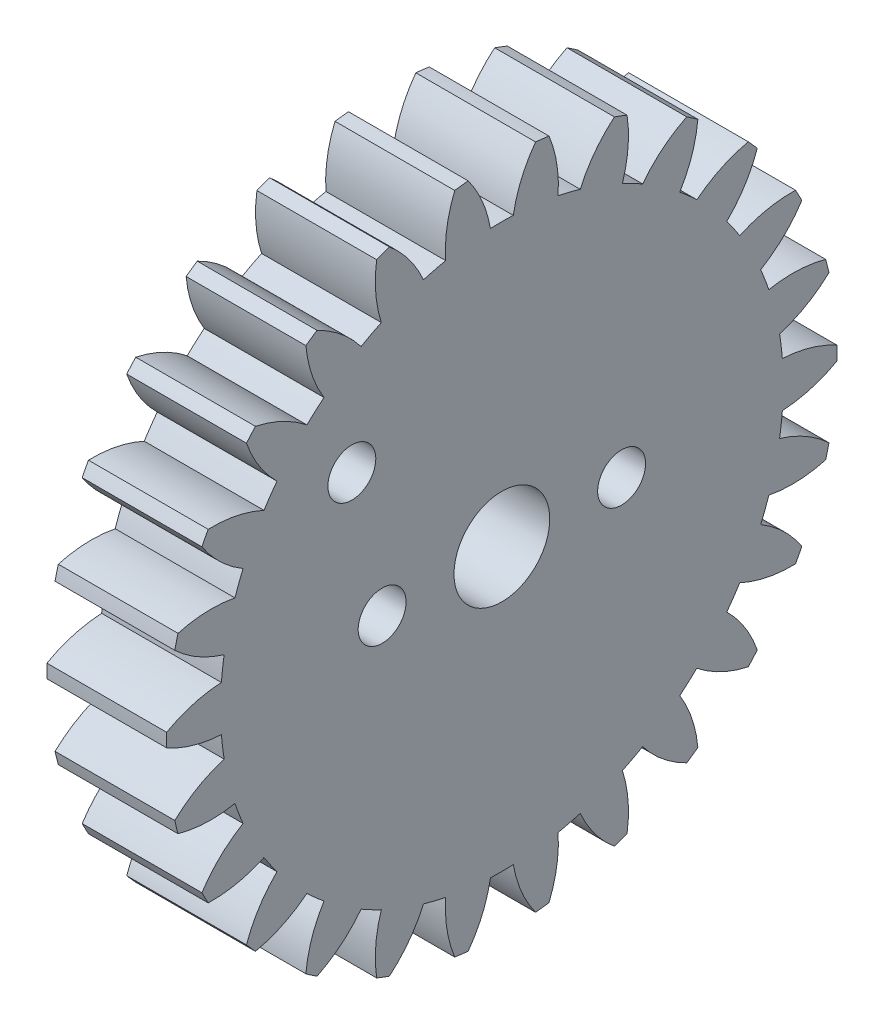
ISO-10303-21;
HEADER;
FILE_DESCRIPTION(('STEP AP214'),'2;1');
FILE_NAME('part.step','',(''),(''),'','','');
FILE_SCHEMA(('AUTOMOTIVE_DESIGN { 1 0 10303 214 1 1 1 1 }'));
ENDSEC;
DATA;
#1=APPLICATION_CONTEXT('core data for automotive mechanical design processes');
#2=APPLICATION_PROTOCOL_DEFINITION('international standard','automotive_design',2000,#1);
#3=PRODUCT_CONTEXT('',#1,'mechanical');
#4=PRODUCT('Part','Part','',(#3));
#5=PRODUCT_RELATED_PRODUCT_CATEGORY('part','',(#4));
#6=PRODUCT_DEFINITION_FORMATION('','',#4);
#7=PRODUCT_DEFINITION_CONTEXT('part definition',#1,'design');
#8=PRODUCT_DEFINITION('design','',#6,#7);
#9=PRODUCT_DEFINITION_SHAPE('','',#8);
#10=(LENGTH_UNIT() NAMED_UNIT(*) SI_UNIT(.MILLI.,.METRE.));
#11=(NAMED_UNIT(*) PLANE_ANGLE_UNIT() SI_UNIT($,.RADIAN.));
#12=(NAMED_UNIT(*) SI_UNIT($,.STERADIAN.) SOLID_ANGLE_UNIT());
#13=UNCERTAINTY_MEASURE_WITH_UNIT(LENGTH_MEASURE(1.E-05),#10,'distance_accuracy_value','');
#14=(GEOMETRIC_REPRESENTATION_CONTEXT(3) GLOBAL_UNCERTAINTY_ASSIGNED_CONTEXT((#13)) GLOBAL_UNIT_ASSIGNED_CONTEXT((#10,
#11,#12)) REPRESENTATION_CONTEXT('',''));
#15=CARTESIAN_POINT('',(0.,0.,0.));
#16=DIRECTION('',(0.,0.,1.));
#17=DIRECTION('',(1.,0.,0.));
#18=AXIS2_PLACEMENT_3D('',#15,#16,#17);
#19=CARTESIAN_POINT('',(-5.73931620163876,-49.2194929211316,42.4845986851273));
#20=DIRECTION('',(-1.,0.,0.));
#21=DIRECTION('',(0.,0.,1.));
#22=AXIS2_PLACEMENT_3D('',#19,#20,#21);
#23=PLANE('',#22);
#24=CARTESIAN_POINT('',(-5.73931620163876,-49.2194929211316,47.4845986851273));
#25=DIRECTION('',(1.,0.,0.));
#26=DIRECTION('',(0.,0.,-1.));
#27=AXIS2_PLACEMENT_3D('',#24,#25,#26);
#28=CIRCLE('',#27,0.999999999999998);
#29=CARTESIAN_POINT('',(-5.73931620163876,-49.2194929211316,46.4845986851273));
#30=VERTEX_POINT('',#29);
#31=EDGE_CURVE('E1356',#30,#30,#28,.T.);
#32=ORIENTED_EDGE('',*,*,#31,.F.);
#33=EDGE_LOOP('',(#32));
#34=FACE_BOUND('',#33,.T.);
#35=CARTESIAN_POINT('',(-5.73931620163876,-43.4090965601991,48.7487211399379));
#36=DIRECTION('',(1.,0.,0.));
#37=DIRECTION('',(0.,0.,-1.));
#38=AXIS2_PLACEMENT_3D('',#35,#36,#37);
#39=CIRCLE('',#38,0.999999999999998);
#40=CARTESIAN_POINT('',(-5.73931620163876,-43.4090965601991,47.7487211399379));
#41=VERTEX_POINT('',#40);
#42=EDGE_CURVE('E1346',#41,#41,#39,.T.);
#43=ORIENTED_EDGE('',*,*,#42,.F.);
#44=EDGE_LOOP('',(#43));
#45=FACE_BOUND('',#44,.T.);
#46=CARTESIAN_POINT('',(-5.73931620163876,-49.2194929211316,37.4845986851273));
#47=DIRECTION('',(1.,0.,0.));
#48=DIRECTION('',(0.,0.,-1.));
#49=AXIS2_PLACEMENT_3D('',#46,#47,#48);
#50=CIRCLE('',#49,0.999999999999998);
#51=CARTESIAN_POINT('',(-5.73931620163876,-49.2194929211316,36.4845986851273));
#52=VERTEX_POINT('',#51);
#53=EDGE_CURVE('E1343',#52,#52,#50,.T.);
#54=ORIENTED_EDGE('',*,*,#53,.F.);
#55=EDGE_LOOP('',(#54));
#56=FACE_BOUND('',#55,.T.);
#57=CARTESIAN_POINT('',(-5.73931620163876,-40.019354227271,34.4479200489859));
#58=DIRECTION('',(-1.,0.,0.));
#59=DIRECTION('',(0.,-0.239315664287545,-0.970941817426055));
#60=AXIS2_PLACEMENT_3D('',#57,#58,#59);
#61=CIRCLE('',#60,5.2);
#62=CARTESIAN_POINT('',(-5.73931620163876,-37.9354467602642,39.2120915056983));
#63=VERTEX_POINT('',#62);
#64=CARTESIAN_POINT('',(-5.73931620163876,-36.0317152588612,37.7853944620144));
#65=VERTEX_POINT('',#64);
#66=EDGE_CURVE('E686',#63,#65,#61,.T.);
#67=ORIENTED_EDGE('',*,*,#66,.F.);
#68=CARTESIAN_POINT('',(-5.73931620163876,-49.2194929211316,42.4845986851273));
#69=DIRECTION('',(-1.,0.,0.));
#70=DIRECTION('',(0.,-0.239315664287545,-0.970941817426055));
#71=AXIS2_PLACEMENT_3D('',#68,#69,#70);
#72=CIRCLE('',#71,11.749);
#73=CARTESIAN_POINT('',(-5.73931620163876,-37.7071563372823,40.1383021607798));
#74=VERTEX_POINT('',#73);
#75=EDGE_CURVE('E685',#74,#63,#72,.T.);
#76=ORIENTED_EDGE('',*,*,#75,.F.);
#77=CARTESIAN_POINT('',(-5.73931620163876,-37.3383438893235,45.325206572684));
#78=DIRECTION('',(-1.,0.,0.));
#79=DIRECTION('',(0.,-0.239315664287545,-0.970941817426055));
#80=AXIS2_PLACEMENT_3D('',#77,#78,#79);
#81=CIRCLE('',#80,5.2);
#82=CARTESIAN_POINT('',(-5.73931620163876,-35.3584666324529,40.5168715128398));
#83=VERTEX_POINT('',#82);
#84=EDGE_CURVE('E674',#83,#74,#81,.T.);
#85=ORIENTED_EDGE('',*,*,#84,.F.);
#86=CARTESIAN_POINT('',(-5.73931620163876,-49.2194929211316,42.4845986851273));
#87=DIRECTION('',(-1.,0.,0.));
#88=DIRECTION('',(0.,0.,1.));
#89=AXIS2_PLACEMENT_3D('',#86,#87,#88);
#90=CIRCLE('',#89,14.);
#91=CARTESIAN_POINT('',(-5.73931620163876,-35.2903349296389,41.0779865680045));
#92=VERTEX_POINT('',#91);
#93=EDGE_CURVE('E1261',#92,#83,#90,.T.);
#94=ORIENTED_EDGE('',*,*,#93,.F.);
#95=CARTESIAN_POINT('',(-5.73931620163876,-38.3633904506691,36.8831886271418));
#96=DIRECTION('',(-1.,0.,0.));
#97=DIRECTION('',(0.,0.,-1.));
#98=AXIS2_PLACEMENT_3D('',#95,#96,#97);
#99=CIRCLE('',#98,5.2);
#100=CARTESIAN_POINT('',(-5.73931620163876,-37.4801784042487,42.007633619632));
#101=VERTEX_POINT('',#100);
#102=EDGE_CURVE('E1234',#101,#92,#99,.T.);
#103=ORIENTED_EDGE('',*,*,#102,.F.);
#104=CARTESIAN_POINT('',(-5.73931620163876,-49.2194929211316,42.4845986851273));
#105=DIRECTION('',(-1.,0.,0.));
#106=DIRECTION('',(0.,0.,-1.));
#107=AXIS2_PLACEMENT_3D('',#104,#105,#106);
#108=CIRCLE('',#107,11.749);
#109=CARTESIAN_POINT('',(-5.73931620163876,-37.4801784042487,42.9615637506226));
#110=VERTEX_POINT('',#109);
#111=EDGE_CURVE('E1239',#110,#101,#108,.T.);
#112=ORIENTED_EDGE('',*,*,#111,.F.);
#113=CARTESIAN_POINT('',(-5.73931620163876,-38.3633904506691,48.0860087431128));
#114=DIRECTION('',(-1.,0.,0.));
#115=DIRECTION('',(0.,0.,-1.));
#116=AXIS2_PLACEMENT_3D('',#113,#114,#115);
#117=CIRCLE('',#116,5.2);
#118=CARTESIAN_POINT('',(-5.73931620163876,-35.2903349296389,43.8912108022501));
#119=VERTEX_POINT('',#118);
#120=EDGE_CURVE('E1236',#119,#110,#117,.T.);
#121=ORIENTED_EDGE('',*,*,#120,.F.);
#122=CARTESIAN_POINT('',(-5.73931620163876,-35.3584666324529,44.452325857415));
#123=VERTEX_POINT('',#122);
#124=EDGE_CURVE('E1259',#123,#119,#90,.T.);
#125=ORIENTED_EDGE('',*,*,#124,.F.);
#126=CARTESIAN_POINT('',(-5.73931620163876,-37.3383438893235,39.6439907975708));
#127=DIRECTION('',(-1.,0.,0.));
#128=DIRECTION('',(0.,0.239315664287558,-0.970941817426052));
#129=AXIS2_PLACEMENT_3D('',#126,#127,#128);
#130=CIRCLE('',#129,5.2);
#131=CARTESIAN_POINT('',(-5.73931620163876,-37.7071563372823,44.830895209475));
#132=VERTEX_POINT('',#131);
#133=EDGE_CURVE('E1212',#132,#123,#130,.T.);
#134=ORIENTED_EDGE('',*,*,#133,.F.);
#135=CARTESIAN_POINT('',(-5.73931620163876,-49.2194929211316,42.4845986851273));
#136=DIRECTION('',(-1.,0.,0.));
#137=DIRECTION('',(0.,0.239315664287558,-0.970941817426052));
#138=AXIS2_PLACEMENT_3D('',#135,#136,#137);
#139=CIRCLE('',#138,11.749);
#140=CARTESIAN_POINT('',(-5.73931620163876,-37.9354467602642,45.7571058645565));
#141=VERTEX_POINT('',#140);
#142=EDGE_CURVE('E1217',#141,#132,#139,.T.);
#143=ORIENTED_EDGE('',*,*,#142,.F.);
#144=CARTESIAN_POINT('',(-5.73931620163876,-40.0193542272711,50.5212773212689));
#145=DIRECTION('',(-1.,0.,0.));
#146=DIRECTION('',(0.,0.239315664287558,-0.970941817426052));
#147=AXIS2_PLACEMENT_3D('',#144,#145,#146);
#148=CIRCLE('',#147,5.2);
#149=CARTESIAN_POINT('',(-5.73931620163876,-36.0317152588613,47.1838029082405));
#150=VERTEX_POINT('',#149);
#151=EDGE_CURVE('E1214',#150,#141,#148,.T.);
#152=ORIENTED_EDGE('',*,*,#151,.F.);
#153=CARTESIAN_POINT('',(-5.73931620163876,-36.2321508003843,47.7123079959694));
#154=VERTEX_POINT('',#153);
#155=EDGE_CURVE('E1474',#154,#150,#90,.T.);
#156=ORIENTED_EDGE('',*,*,#155,.F.);
#157=CARTESIAN_POINT('',(-5.73931620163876,-37.003786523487,42.5698787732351));
#158=DIRECTION('',(-1.,0.,0.));
#159=DIRECTION('',(0.,0.46472317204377,-0.885456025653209));
#160=AXIS2_PLACEMENT_3D('',#157,#158,#159);
#161=CIRCLE('',#160,5.2);
#162=CARTESIAN_POINT('',(-5.73931620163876,-38.6031894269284,47.5177985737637));
#163=VERTEX_POINT('',#162);
#164=EDGE_CURVE('E1190',#163,#154,#161,.T.);
#165=ORIENTED_EDGE('',*,*,#164,.F.);
#166=CARTESIAN_POINT('',(-5.73931620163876,-49.2194929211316,42.4845986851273));
#167=DIRECTION('',(-1.,0.,0.));
#168=DIRECTION('',(0.,0.46472317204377,-0.885456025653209));
#169=AXIS2_PLACEMENT_3D('',#166,#167,#168);
#170=CIRCLE('',#169,11.749);
#171=CARTESIAN_POINT('',(-5.73931620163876,-39.0465028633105,48.3624617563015));
#172=VERTEX_POINT('',#171);
#173=EDGE_CURVE('E1195',#172,#163,#170,.T.);
#174=ORIENTED_EDGE('',*,*,#173,.F.);
#175=CARTESIAN_POINT('',(-5.73931620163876,-42.2099966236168,52.4894833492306));
#176=DIRECTION('',(-1.,0.,0.));
#177=DIRECTION('',(0.,0.46472317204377,-0.885456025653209));
#178=AXIS2_PLACEMENT_3D('',#175,#176,#177);
#179=CIRCLE('',#178,5.2);
#180=CARTESIAN_POINT('',(-5.73931620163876,-37.5395212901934,50.2032943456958));
#181=VERTEX_POINT('',#180);
#182=EDGE_CURVE('E1192',#181,#172,#179,.T.);
#183=ORIENTED_EDGE('',*,*,#182,.F.);
#184=CARTESIAN_POINT('',(-5.73931620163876,-37.8606120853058,50.6684746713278));
#185=VERTEX_POINT('',#184);
#186=EDGE_CURVE('E1469',#185,#181,#90,.T.);
#187=ORIENTED_EDGE('',*,*,#186,.F.);
#188=CARTESIAN_POINT('',(-5.73931620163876,-37.3791616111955,45.490810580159));
#189=DIRECTION('',(-1.,0.,0.));
#190=DIRECTION('',(0.,0.663122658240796,-0.7485107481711));
#191=AXIS2_PLACEMENT_3D('',#188,#189,#190);
#192=CIRCLE('',#191,5.2);
#193=CARTESIAN_POINT('',(-5.73931620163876,-40.1162034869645,49.9121906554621));
#194=VERTEX_POINT('',#193);
#195=EDGE_CURVE('E1168',#194,#185,#192,.T.);
#196=ORIENTED_EDGE('',*,*,#195,.F.);
#197=CARTESIAN_POINT('',(-5.73931620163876,-49.2194929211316,42.4845986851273));
#198=DIRECTION('',(-1.,0.,0.));
#199=DIRECTION('',(0.,0.663122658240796,-0.7485107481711));
#200=AXIS2_PLACEMENT_3D('',#197,#198,#199);
#201=CIRCLE('',#200,11.749);
#202=CARTESIAN_POINT('',(-5.73931620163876,-40.748776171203,50.6262176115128));
#203=VERTEX_POINT('',#202);
#204=EDGE_CURVE('E1173',#203,#194,#201,.T.);
#205=ORIENTED_EDGE('',*,*,#204,.F.);
#206=CARTESIAN_POINT('',(-5.73931620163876,-44.8080054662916,53.8762418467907));
#207=DIRECTION('',(-1.,0.,0.));
#208=DIRECTION('',(0.,0.663122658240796,-0.7485107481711));
#209=AXIS2_PLACEMENT_3D('',#206,#207,#208);
#210=CIRCLE('',#209,5.2);
#211=CARTESIAN_POINT('',(-5.73931620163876,-39.7261248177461,52.7742032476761));
#212=VERTEX_POINT('',#211);
#213=EDGE_CURVE('E1170',#212,#203,#210,.T.);
#214=ORIENTED_EDGE('',*,*,#213,.F.);
#215=CARTESIAN_POINT('',(-5.73931620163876,-40.1492102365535,53.1490242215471));
#216=VERTEX_POINT('',#215);
#217=EDGE_CURVE('E1464',#216,#212,#90,.T.);
#218=ORIENTED_EDGE('',*,*,#217,.F.);
#219=CARTESIAN_POINT('',(-5.73931620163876,-38.4426537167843,48.2370322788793));
#220=DIRECTION('',(-1.,0.,0.));
#221=DIRECTION('',(0.,0.822983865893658,-0.568064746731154));
#222=AXIS2_PLACEMENT_3D('',#219,#220,#221);
#223=CIRCLE('',#222,5.2);
#224=CARTESIAN_POINT('',(-5.73931620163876,-42.1582676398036,51.8749180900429));
#225=VERTEX_POINT('',#224);
#226=EDGE_CURVE('E1146',#225,#216,#223,.T.);
#227=ORIENTED_EDGE('',*,*,#226,.F.);
#228=CARTESIAN_POINT('',(-5.73931620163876,-49.2194929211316,42.4845986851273));
#229=DIRECTION('',(-1.,0.,0.));
#230=DIRECTION('',(0.,0.822983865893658,-0.568064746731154));
#231=AXIS2_PLACEMENT_3D('',#228,#229,#230);
#232=CIRCLE('',#231,11.749);
#233=CARTESIAN_POINT('',(-5.73931620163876,-42.9433367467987,52.4168121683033));
#234=VERTEX_POINT('',#233);
#235=EDGE_CURVE('E1151',#234,#225,#232,.T.);
#236=ORIENTED_EDGE('',*,*,#235,.F.);
#237=CARTESIAN_POINT('',(-5.73931620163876,-47.6623939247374,54.6009594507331));
#238=DIRECTION('',(-1.,0.,0.));
#239=DIRECTION('',(0.,0.822983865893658,-0.568064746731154));
#240=AXIS2_PLACEMENT_3D('',#237,#238,#239);
#241=CIRCLE('',#240,5.2);
#242=CARTESIAN_POINT('',(-5.73931620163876,-42.4644483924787,54.7471177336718));
#243=VERTEX_POINT('',#242);
#244=EDGE_CURVE('E1148',#243,#234,#241,.T.);
#245=ORIENTED_EDGE('',*,*,#244,.F.);
#246=CARTESIAN_POINT('',(-5.73931620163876,-42.9649402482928,55.0097961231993));
#247=VERTEX_POINT('',#246);
#248=EDGE_CURVE('E1459',#247,#243,#90,.T.);
#249=ORIENTED_EDGE('',*,*,#248,.F.);
#250=CARTESIAN_POINT('',(-5.73931620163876,-40.1324565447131,50.6489434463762));
#251=DIRECTION('',(-1.,0.,0.));
#252=DIRECTION('',(0.,0.935016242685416,-0.354604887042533));
#253=AXIS2_PLACEMENT_3D('',#250,#251,#252);
#254=CIRCLE('',#253,5.2);
#255=CARTESIAN_POINT('',(-5.73931620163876,-44.6107045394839,53.2919142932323));
#256=VERTEX_POINT('',#255);
#257=EDGE_CURVE('E1124',#256,#247,#254,.T.);
#258=ORIENTED_EDGE('',*,*,#257,.F.);
#259=CARTESIAN_POINT('',(-5.73931620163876,-49.2194929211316,42.4845986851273));
#260=DIRECTION('',(-1.,0.,0.));
#261=DIRECTION('',(0.,0.935016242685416,-0.354604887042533));
#262=AXIS2_PLACEMENT_3D('',#259,#260,#261);
#263=CIRCLE('',#262,11.749);
#264=CARTESIAN_POINT('',(-5.73931620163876,-45.5026447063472,53.6301825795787));
#265=VERTEX_POINT('',#264);
#266=EDGE_CURVE('E1129',#265,#256,#263,.T.);
#267=ORIENTED_EDGE('',*,*,#266,.F.);
#268=CARTESIAN_POINT('',(-5.73931620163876,-50.607275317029,54.6215182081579));
#269=DIRECTION('',(-1.,0.,0.));
#270=DIRECTION('',(0.,0.935016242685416,-0.354604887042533));
#271=AXIS2_PLACEMENT_3D('',#268,#269,#270);
#272=CIRCLE('',#271,5.2);
#273=CARTESIAN_POINT('',(-5.73931620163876,-45.5953506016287,56.0073791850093));
#274=VERTEX_POINT('',#273);
#275=EDGE_CURVE('E1126',#274,#265,#272,.T.);
#276=ORIENTED_EDGE('',*,*,#275,.F.);
#277=CARTESIAN_POINT('',(-5.73931620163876,-46.1441621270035,56.142649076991));
#278=VERTEX_POINT('',#277);
#279=EDGE_CURVE('E1454',#278,#274,#90,.T.);
#280=ORIENTED_EDGE('',*,*,#279,.F.);
#281=CARTESIAN_POINT('',(-5.73931620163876,-42.3503648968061,52.5863725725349));
#282=DIRECTION('',(-1.,0.,0.));
#283=DIRECTION('',(0.,0.992708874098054,-0.12053668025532));
#284=AXIS2_PLACEMENT_3D('',#281,#282,#283);
#285=CIRCLE('',#284,5.2);
#286=CARTESIAN_POINT('',(-5.73931620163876,-47.3309874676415,54.0808285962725));
#287=VERTEX_POINT('',#286);
#288=EDGE_CURVE('E1102',#287,#278,#285,.T.);
#289=ORIENTED_EDGE('',*,*,#288,.F.);
#290=CARTESIAN_POINT('',(-5.73931620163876,-49.2194929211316,42.4845986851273));
#291=DIRECTION('',(-1.,0.,0.));
#292=DIRECTION('',(0.,0.992708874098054,-0.12053668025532));
#293=AXIS2_PLACEMENT_3D('',#290,#291,#292);
#294=CIRCLE('',#293,11.749);
#295=CARTESIAN_POINT('',(-5.73931620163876,-48.2779623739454,54.1958121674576));
#296=VERTEX_POINT('',#295);
#297=EDGE_CURVE('E1107',#296,#287,#294,.T.);
#298=ORIENTED_EDGE('',*,*,#297,.F.);
#299=CARTESIAN_POINT('',(-5.73931620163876,-53.4715038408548,53.9367233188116));
#300=DIRECTION('',(-1.,0.,0.));
#301=DIRECTION('',(0.,0.992708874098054,-0.12053668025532));
#302=AXIS2_PLACEMENT_3D('',#299,#300,#301);
#303=CIRCLE('',#302,5.2);
#304=CARTESIAN_POINT('',(-5.73931620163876,-48.9368747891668,56.4817457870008));
#305=VERTEX_POINT('',#304);
#306=EDGE_CURVE('E1104',#305,#296,#303,.T.);
#307=ORIENTED_EDGE('',*,*,#306,.F.);
#308=CARTESIAN_POINT('',(-5.73931620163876,-49.5021110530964,56.4817457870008));
#309=VERTEX_POINT('',#308);
#310=EDGE_CURVE('E1449',#309,#305,#90,.T.);
#311=ORIENTED_EDGE('',*,*,#310,.F.);
#312=CARTESIAN_POINT('',(-5.73931620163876,-44.9674820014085,53.9367233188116));
#313=DIRECTION('',(-1.,0.,0.));
#314=DIRECTION('',(0.,0.992708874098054,0.120536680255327));
#315=AXIS2_PLACEMENT_3D('',#312,#313,#314);
#316=CIRCLE('',#315,5.2);
#317=CARTESIAN_POINT('',(-5.73931620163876,-50.1610234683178,54.1958121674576));
#318=VERTEX_POINT('',#317);
#319=EDGE_CURVE('E1080',#318,#309,#316,.T.);
#320=ORIENTED_EDGE('',*,*,#319,.F.);
#321=CARTESIAN_POINT('',(-5.73931620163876,-49.2194929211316,42.4845986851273));
#322=DIRECTION('',(-1.,0.,0.));
#323=DIRECTION('',(0.,0.992708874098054,0.120536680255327));
#324=AXIS2_PLACEMENT_3D('',#321,#322,#323);
#325=CIRCLE('',#324,11.749);
#326=CARTESIAN_POINT('',(-5.73931620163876,-51.1079983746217,54.0808285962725));
#327=VERTEX_POINT('',#326);
#328=EDGE_CURVE('E1085',#327,#318,#325,.T.);
#329=ORIENTED_EDGE('',*,*,#328,.F.);
#330=CARTESIAN_POINT('',(-5.73931620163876,-56.0886209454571,52.5863725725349));
#331=DIRECTION('',(-1.,0.,0.));
#332=DIRECTION('',(0.,0.992708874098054,0.120536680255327));
#333=AXIS2_PLACEMENT_3D('',#330,#331,#332);
#334=CIRCLE('',#333,5.2);
#335=CARTESIAN_POINT('',(-5.73931620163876,-52.2948237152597,56.142649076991));
#336=VERTEX_POINT('',#335);
#337=EDGE_CURVE('E1082',#336,#327,#334,.T.);
#338=ORIENTED_EDGE('',*,*,#337,.F.);
#339=CARTESIAN_POINT('',(-5.73931620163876,-52.8436352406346,56.0073791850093));
#340=VERTEX_POINT('',#339);
#341=EDGE_CURVE('E1444',#340,#336,#90,.T.);
#342=ORIENTED_EDGE('',*,*,#341,.F.);
#343=CARTESIAN_POINT('',(-5.73931620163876,-47.8317105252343,54.6215182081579));
#344=DIRECTION('',(-1.,0.,0.));
#345=DIRECTION('',(0.,0.935016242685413,0.35460488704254));
#346=AXIS2_PLACEMENT_3D('',#343,#344,#345);
#347=CIRCLE('',#346,5.2);
#348=CARTESIAN_POINT('',(-5.73931620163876,-52.936341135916,53.6301825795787));
#349=VERTEX_POINT('',#348);
#350=EDGE_CURVE('E1058',#349,#340,#347,.T.);
#351=ORIENTED_EDGE('',*,*,#350,.F.);
#352=CARTESIAN_POINT('',(-5.73931620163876,-49.2194929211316,42.4845986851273));
#353=DIRECTION('',(-1.,0.,0.));
#354=DIRECTION('',(0.,0.935016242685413,0.35460488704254));
#355=AXIS2_PLACEMENT_3D('',#352,#353,#354);
#356=CIRCLE('',#355,11.749);
#357=CARTESIAN_POINT('',(-5.73931620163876,-53.8282813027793,53.2919142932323));
#358=VERTEX_POINT('',#357);
#359=EDGE_CURVE('E1063',#358,#349,#356,.T.);
#360=ORIENTED_EDGE('',*,*,#359,.F.);
#361=CARTESIAN_POINT('',(-5.73931620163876,-58.30652929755,50.6489434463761));
#362=DIRECTION('',(-1.,0.,0.));
#363=DIRECTION('',(0.,0.935016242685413,0.35460488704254));
#364=AXIS2_PLACEMENT_3D('',#361,#362,#363);
#365=CIRCLE('',#364,5.2);
#366=CARTESIAN_POINT('',(-5.73931620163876,-55.4740455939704,55.0097961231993));
#367=VERTEX_POINT('',#366);
#368=EDGE_CURVE('E1060',#367,#358,#365,.T.);
#369=ORIENTED_EDGE('',*,*,#368,.F.);
#370=CARTESIAN_POINT('',(-5.73931620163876,-55.9745374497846,54.7471177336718));
#371=VERTEX_POINT('',#370);
#372=EDGE_CURVE('E1439',#371,#367,#90,.T.);
#373=ORIENTED_EDGE('',*,*,#372,.F.);
#374=CARTESIAN_POINT('',(-5.73931620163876,-50.7765919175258,54.6009594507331));
#375=DIRECTION('',(-1.,0.,0.));
#376=DIRECTION('',(0.,0.822983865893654,0.56806474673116));
#377=AXIS2_PLACEMENT_3D('',#374,#375,#376);
#378=CIRCLE('',#377,5.2);
#379=CARTESIAN_POINT('',(-5.73931620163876,-55.4956490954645,52.4168121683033));
#380=VERTEX_POINT('',#379);
#381=EDGE_CURVE('E1036',#380,#371,#378,.T.);
#382=ORIENTED_EDGE('',*,*,#381,.F.);
#383=CARTESIAN_POINT('',(-5.73931620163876,-49.2194929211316,42.4845986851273));
#384=DIRECTION('',(-1.,0.,0.));
#385=DIRECTION('',(0.,0.822983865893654,0.56806474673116));
#386=AXIS2_PLACEMENT_3D('',#383,#384,#385);
#387=CIRCLE('',#386,11.749);
#388=CARTESIAN_POINT('',(-5.73931620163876,-56.2807182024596,51.8749180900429));
#389=VERTEX_POINT('',#388);
#390=EDGE_CURVE('E1041',#389,#380,#387,.T.);
#391=ORIENTED_EDGE('',*,*,#390,.F.);
#392=CARTESIAN_POINT('',(-5.73931620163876,-59.9963321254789,48.2370322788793));
#393=DIRECTION('',(-1.,0.,0.));
#394=DIRECTION('',(0.,0.822983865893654,0.56806474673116));
#395=AXIS2_PLACEMENT_3D('',#392,#393,#394);
#396=CIRCLE('',#395,5.2);
#397=CARTESIAN_POINT('',(-5.73931620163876,-58.2897756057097,53.1490242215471));
#398=VERTEX_POINT('',#397);
#399=EDGE_CURVE('E1038',#398,#389,#396,.T.);
#400=ORIENTED_EDGE('',*,*,#399,.F.);
#401=CARTESIAN_POINT('',(-5.73931620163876,-58.7128610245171,52.774203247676));
#402=VERTEX_POINT('',#401);
#403=EDGE_CURVE('E1434',#402,#398,#90,.T.);
#404=ORIENTED_EDGE('',*,*,#403,.F.);
#405=CARTESIAN_POINT('',(-5.73931620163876,-53.6309803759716,53.8762418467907));
#406=DIRECTION('',(-1.,0.,0.));
#407=DIRECTION('',(0.,0.663122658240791,0.748510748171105));
#408=AXIS2_PLACEMENT_3D('',#405,#406,#407);
#409=CIRCLE('',#408,5.2);
#410=CARTESIAN_POINT('',(-5.73931620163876,-57.6902096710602,50.6262176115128));
#411=VERTEX_POINT('',#410);
#412=EDGE_CURVE('E1014',#411,#402,#409,.T.);
#413=ORIENTED_EDGE('',*,*,#412,.F.);
#414=CARTESIAN_POINT('',(-5.73931620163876,-49.2194929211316,42.4845986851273));
#415=DIRECTION('',(-1.,0.,0.));
#416=DIRECTION('',(0.,0.663122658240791,0.748510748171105));
#417=AXIS2_PLACEMENT_3D('',#414,#415,#416);
#418=CIRCLE('',#417,11.749);
#419=CARTESIAN_POINT('',(-5.73931620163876,-58.3227823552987,49.912190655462));
#420=VERTEX_POINT('',#419);
#421=EDGE_CURVE('E1019',#420,#411,#418,.T.);
#422=ORIENTED_EDGE('',*,*,#421,.F.);
#423=CARTESIAN_POINT('',(-5.73931620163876,-61.0598242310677,45.4908105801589));
#424=DIRECTION('',(-1.,0.,0.));
#425=DIRECTION('',(0.,0.663122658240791,0.748510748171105));
#426=AXIS2_PLACEMENT_3D('',#423,#424,#425);
#427=CIRCLE('',#426,5.2);
#428=CARTESIAN_POINT('',(-5.73931620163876,-60.5783737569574,50.6684746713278));
#429=VERTEX_POINT('',#428);
#430=EDGE_CURVE('E1016',#429,#420,#427,.T.);
#431=ORIENTED_EDGE('',*,*,#430,.F.);
#432=CARTESIAN_POINT('',(-5.73931620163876,-60.8994645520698,50.2032943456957));
#433=VERTEX_POINT('',#432);
#434=EDGE_CURVE('E1429',#433,#429,#90,.T.);
#435=ORIENTED_EDGE('',*,*,#434,.F.);
#436=CARTESIAN_POINT('',(-5.73931620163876,-56.2289892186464,52.4894833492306));
#437=DIRECTION('',(-1.,0.,0.));
#438=DIRECTION('',(0.,0.464723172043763,0.885456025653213));
#439=AXIS2_PLACEMENT_3D('',#436,#437,#438);
#440=CIRCLE('',#439,5.2);
#441=CARTESIAN_POINT('',(-5.73931620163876,-59.3924829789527,48.3624617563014));
#442=VERTEX_POINT('',#441);
#443=EDGE_CURVE('E992',#442,#433,#440,.T.);
#444=ORIENTED_EDGE('',*,*,#443,.F.);
#445=CARTESIAN_POINT('',(-5.73931620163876,-49.2194929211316,42.4845986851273));
#446=DIRECTION('',(-1.,0.,0.));
#447=DIRECTION('',(0.,0.464723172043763,0.885456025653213));
#448=AXIS2_PLACEMENT_3D('',#445,#446,#447);
#449=CIRCLE('',#448,11.749);
#450=CARTESIAN_POINT('',(-5.73931620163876,-59.8357964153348,47.5177985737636));
#451=VERTEX_POINT('',#450);
#452=EDGE_CURVE('E997',#451,#442,#449,.T.);
#453=ORIENTED_EDGE('',*,*,#452,.F.);
#454=CARTESIAN_POINT('',(-5.73931620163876,-61.4351993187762,42.569878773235));
#455=DIRECTION('',(-1.,0.,0.));
#456=DIRECTION('',(0.,0.464723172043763,0.885456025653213));
#457=AXIS2_PLACEMENT_3D('',#454,#455,#456);
#458=CIRCLE('',#457,5.2);
#459=CARTESIAN_POINT('',(-5.73931620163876,-62.2068350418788,47.7123079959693));
#460=VERTEX_POINT('',#459);
#461=EDGE_CURVE('E994',#460,#451,#458,.T.);
#462=ORIENTED_EDGE('',*,*,#461,.F.);
#463=CARTESIAN_POINT('',(-5.73931620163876,-62.4072705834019,47.1838029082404));
#464=VERTEX_POINT('',#463);
#465=EDGE_CURVE('E1424',#464,#460,#90,.T.);
#466=ORIENTED_EDGE('',*,*,#465,.F.);
#467=CARTESIAN_POINT('',(-5.73931620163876,-58.4196316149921,50.5212773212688));
#468=DIRECTION('',(-1.,0.,0.));
#469=DIRECTION('',(0.,0.239315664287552,0.970941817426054));
#470=AXIS2_PLACEMENT_3D('',#467,#468,#469);
#471=CIRCLE('',#470,5.2);
#472=CARTESIAN_POINT('',(-5.73931620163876,-60.5035390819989,45.7571058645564));
#473=VERTEX_POINT('',#472);
#474=EDGE_CURVE('E970',#473,#464,#471,.T.);
#475=ORIENTED_EDGE('',*,*,#474,.F.);
#476=CARTESIAN_POINT('',(-5.73931620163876,-49.2194929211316,42.4845986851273));
#477=DIRECTION('',(-1.,0.,0.));
#478=DIRECTION('',(0.,0.239315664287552,0.970941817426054));
#479=AXIS2_PLACEMENT_3D('',#476,#477,#478);
#480=CIRCLE('',#479,11.749);
#481=CARTESIAN_POINT('',(-5.73931620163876,-60.7318295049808,44.8308952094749));
#482=VERTEX_POINT('',#481);
#483=EDGE_CURVE('E975',#482,#473,#480,.T.);
#484=ORIENTED_EDGE('',*,*,#483,.F.);
#485=CARTESIAN_POINT('',(-5.73931620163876,-61.1006419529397,39.6439907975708));
#486=DIRECTION('',(-1.,0.,0.));
#487=DIRECTION('',(0.,0.239315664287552,0.970941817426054));
#488=AXIS2_PLACEMENT_3D('',#485,#486,#487);
#489=CIRCLE('',#488,5.2);
#490=CARTESIAN_POINT('',(-5.73931620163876,-63.0805192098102,44.4523258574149));
#491=VERTEX_POINT('',#490);
#492=EDGE_CURVE('E972',#491,#482,#489,.T.);
#493=ORIENTED_EDGE('',*,*,#492,.F.);
#494=CARTESIAN_POINT('',(-5.73931620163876,-63.1486509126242,43.89121080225));
#495=VERTEX_POINT('',#494);
#496=EDGE_CURVE('E1419',#495,#491,#90,.T.);
#497=ORIENTED_EDGE('',*,*,#496,.F.);
#498=CARTESIAN_POINT('',(-5.73931620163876,-60.0755953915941,48.0860087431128));
#499=DIRECTION('',(-1.,0.,0.));
#500=DIRECTION('',(0.,0.,1.));
#501=AXIS2_PLACEMENT_3D('',#498,#499,#500);
#502=CIRCLE('',#501,5.2);
#503=CARTESIAN_POINT('',(-5.73931620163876,-60.9588074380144,42.9615637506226));
#504=VERTEX_POINT('',#503);
#505=EDGE_CURVE('E948',#504,#495,#502,.T.);
#506=ORIENTED_EDGE('',*,*,#505,.F.);
#507=CARTESIAN_POINT('',(-5.73931620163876,-49.2194929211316,42.4845986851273));
#508=DIRECTION('',(-1.,0.,0.));
#509=DIRECTION('',(0.,0.,1.));
#510=AXIS2_PLACEMENT_3D('',#507,#508,#509);
#511=CIRCLE('',#510,11.749);
#512=CARTESIAN_POINT('',(-5.73931620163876,-60.9588074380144,42.0076336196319));
#513=VERTEX_POINT('',#512);
#514=EDGE_CURVE('E953',#513,#504,#511,.T.);
#515=ORIENTED_EDGE('',*,*,#514,.F.);
#516=CARTESIAN_POINT('',(-5.73931620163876,-60.075595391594,36.8831886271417));
#517=DIRECTION('',(-1.,0.,0.));
#518=DIRECTION('',(0.,0.,1.));
#519=AXIS2_PLACEMENT_3D('',#516,#517,#518);
#520=CIRCLE('',#519,5.2);
#521=CARTESIAN_POINT('',(-5.73931620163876,-63.1486509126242,41.0779865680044));
#522=VERTEX_POINT('',#521);
#523=EDGE_CURVE('E950',#522,#513,#520,.T.);
#524=ORIENTED_EDGE('',*,*,#523,.F.);
#525=CARTESIAN_POINT('',(-5.73931620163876,-63.0805192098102,40.5168715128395));
#526=VERTEX_POINT('',#525);
#527=EDGE_CURVE('E1414',#526,#522,#90,.T.);
#528=ORIENTED_EDGE('',*,*,#527,.F.);
#529=CARTESIAN_POINT('',(-5.73931620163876,-61.1006419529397,45.3252065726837));
#530=DIRECTION('',(-1.,0.,0.));
#531=DIRECTION('',(0.,-0.239315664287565,0.97094181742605));
#532=AXIS2_PLACEMENT_3D('',#529,#530,#531);
#533=CIRCLE('',#532,5.2);
#534=CARTESIAN_POINT('',(-5.73931620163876,-60.7318295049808,40.1383021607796));
#535=VERTEX_POINT('',#534);
#536=EDGE_CURVE('E926',#535,#526,#533,.T.);
#537=ORIENTED_EDGE('',*,*,#536,.F.);
#538=CARTESIAN_POINT('',(-5.73931620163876,-49.2194929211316,42.4845986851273));
#539=DIRECTION('',(-1.,0.,0.));
#540=DIRECTION('',(0.,-0.239315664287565,0.97094181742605));
#541=AXIS2_PLACEMENT_3D('',#538,#539,#540);
#542=CIRCLE('',#541,11.749);
#543=CARTESIAN_POINT('',(-5.73931620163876,-60.5035390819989,39.2120915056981));
#544=VERTEX_POINT('',#543);
#545=EDGE_CURVE('E931',#544,#535,#542,.T.);
#546=ORIENTED_EDGE('',*,*,#545,.F.);
#547=CARTESIAN_POINT('',(-5.73931620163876,-58.419631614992,34.4479200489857));
#548=DIRECTION('',(-1.,0.,0.));
#549=DIRECTION('',(0.,-0.239315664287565,0.97094181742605));
#550=AXIS2_PLACEMENT_3D('',#547,#548,#549);
#551=CIRCLE('',#550,5.2);
#552=CARTESIAN_POINT('',(-5.73931620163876,-62.4072705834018,37.7853944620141));
#553=VERTEX_POINT('',#552);
#554=EDGE_CURVE('E928',#553,#544,#551,.T.);
#555=ORIENTED_EDGE('',*,*,#554,.F.);
#556=CARTESIAN_POINT('',(-5.73931620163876,-62.2068350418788,37.2568893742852));
#557=VERTEX_POINT('',#556);
#558=EDGE_CURVE('E1409',#557,#553,#90,.T.);
#559=ORIENTED_EDGE('',*,*,#558,.F.);
#560=CARTESIAN_POINT('',(-5.73931620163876,-61.4351993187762,42.3993185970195));
#561=DIRECTION('',(-1.,0.,0.));
#562=DIRECTION('',(0.,-0.464723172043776,0.885456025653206));
#563=AXIS2_PLACEMENT_3D('',#560,#561,#562);
#564=CIRCLE('',#563,5.2);
#565=CARTESIAN_POINT('',(-5.73931620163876,-59.8357964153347,37.4513987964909));
#566=VERTEX_POINT('',#565);
#567=EDGE_CURVE('E904',#566,#557,#564,.T.);
#568=ORIENTED_EDGE('',*,*,#567,.F.);
#569=CARTESIAN_POINT('',(-5.73931620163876,-49.2194929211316,42.4845986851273));
#570=DIRECTION('',(-1.,0.,0.));
#571=DIRECTION('',(0.,-0.464723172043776,0.885456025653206));
#572=AXIS2_PLACEMENT_3D('',#569,#570,#571);
#573=CIRCLE('',#572,11.749);
#574=CARTESIAN_POINT('',(-5.73931620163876,-59.3924829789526,36.6067356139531));
#575=VERTEX_POINT('',#574);
#576=EDGE_CURVE('E909',#575,#566,#573,.T.);
#577=ORIENTED_EDGE('',*,*,#576,.F.);
#578=CARTESIAN_POINT('',(-5.73931620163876,-56.2289892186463,32.479714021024));
#579=DIRECTION('',(-1.,0.,0.));
#580=DIRECTION('',(0.,-0.464723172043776,0.885456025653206));
#581=AXIS2_PLACEMENT_3D('',#578,#579,#580);
#582=CIRCLE('',#581,5.2);
#583=CARTESIAN_POINT('',(-5.73931620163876,-60.8994645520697,34.7659030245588));
#584=VERTEX_POINT('',#583);
#585=EDGE_CURVE('E906',#584,#575,#582,.T.);
#586=ORIENTED_EDGE('',*,*,#585,.F.);
#587=CARTESIAN_POINT('',(-5.73931620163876,-60.5783737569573,34.3007226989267));
#588=VERTEX_POINT('',#587);
#589=EDGE_CURVE('E1404',#588,#584,#90,.T.);
#590=ORIENTED_EDGE('',*,*,#589,.F.);
#591=CARTESIAN_POINT('',(-5.73931620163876,-61.0598242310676,39.4783867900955));
#592=DIRECTION('',(-1.,0.,0.));
#593=DIRECTION('',(0.,-0.663122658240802,0.748510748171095));
#594=AXIS2_PLACEMENT_3D('',#591,#592,#593);
#595=CIRCLE('',#594,5.2);
#596=CARTESIAN_POINT('',(-5.73931620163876,-58.3227823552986,35.0570067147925));
#597=VERTEX_POINT('',#596);
#598=EDGE_CURVE('E882',#597,#588,#595,.T.);
#599=ORIENTED_EDGE('',*,*,#598,.F.);
#600=CARTESIAN_POINT('',(-5.73931620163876,-49.2194929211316,42.4845986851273));
#601=DIRECTION('',(-1.,0.,0.));
#602=DIRECTION('',(0.,-0.663122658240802,0.748510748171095));
#603=AXIS2_PLACEMENT_3D('',#600,#601,#602);
#604=CIRCLE('',#603,11.749);
#605=CARTESIAN_POINT('',(-5.73931620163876,-57.6902096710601,34.3429797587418));
#606=VERTEX_POINT('',#605);
#607=EDGE_CURVE('E887',#606,#597,#604,.T.);
#608=ORIENTED_EDGE('',*,*,#607,.F.);
#609=CARTESIAN_POINT('',(-5.73931620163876,-53.6309803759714,31.0929555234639));
#610=DIRECTION('',(-1.,0.,0.));
#611=DIRECTION('',(0.,-0.663122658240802,0.748510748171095));
#612=AXIS2_PLACEMENT_3D('',#609,#610,#611);
#613=CIRCLE('',#612,5.2);
#614=CARTESIAN_POINT('',(-5.73931620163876,-58.7128610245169,32.1949941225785));
#615=VERTEX_POINT('',#614);
#616=EDGE_CURVE('E884',#615,#606,#613,.T.);
#617=ORIENTED_EDGE('',*,*,#616,.F.);
#618=CARTESIAN_POINT('',(-5.73931620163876,-58.2897756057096,31.8201731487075));
#619=VERTEX_POINT('',#618);
#620=EDGE_CURVE('E1399',#619,#615,#90,.T.);
#621=ORIENTED_EDGE('',*,*,#620,.F.);
#622=CARTESIAN_POINT('',(-5.73931620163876,-59.9963321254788,36.7321650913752));
#623=DIRECTION('',(-1.,0.,0.));
#624=DIRECTION('',(0.,-0.822983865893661,0.568064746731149));
#625=AXIS2_PLACEMENT_3D('',#622,#623,#624);
#626=CIRCLE('',#625,5.2);
#627=CARTESIAN_POINT('',(-5.73931620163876,-56.2807182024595,33.0942792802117));
#628=VERTEX_POINT('',#627);
#629=EDGE_CURVE('E860',#628,#619,#626,.T.);
#630=ORIENTED_EDGE('',*,*,#629,.F.);
#631=CARTESIAN_POINT('',(-5.73931620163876,-49.2194929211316,42.4845986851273));
#632=DIRECTION('',(-1.,0.,0.));
#633=DIRECTION('',(0.,-0.822983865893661,0.568064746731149));
#634=AXIS2_PLACEMENT_3D('',#631,#632,#633);
#635=CIRCLE('',#634,11.749);
#636=CARTESIAN_POINT('',(-5.73931620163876,-55.4956490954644,32.5523852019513));
#637=VERTEX_POINT('',#636);
#638=EDGE_CURVE('E865',#637,#628,#635,.T.);
#639=ORIENTED_EDGE('',*,*,#638,.F.);
#640=CARTESIAN_POINT('',(-5.73931620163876,-50.7765919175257,30.3682379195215));
#641=DIRECTION('',(-1.,0.,0.));
#642=DIRECTION('',(0.,-0.822983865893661,0.568064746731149));
#643=AXIS2_PLACEMENT_3D('',#640,#641,#642);
#644=CIRCLE('',#643,5.2);
#645=CARTESIAN_POINT('',(-5.73931620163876,-55.9745374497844,30.2220796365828));
#646=VERTEX_POINT('',#645);
#647=EDGE_CURVE('E862',#646,#637,#644,.T.);
#648=ORIENTED_EDGE('',*,*,#647,.F.);
#649=CARTESIAN_POINT('',(-5.73931620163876,-55.4740455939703,29.9594012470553));
#650=VERTEX_POINT('',#649);
#651=EDGE_CURVE('E1394',#650,#646,#90,.T.);
#652=ORIENTED_EDGE('',*,*,#651,.F.);
#653=CARTESIAN_POINT('',(-5.73931620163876,-58.3065292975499,34.3202539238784));
#654=DIRECTION('',(-1.,0.,0.));
#655=DIRECTION('',(0.,-0.935016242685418,0.354604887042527));
#656=AXIS2_PLACEMENT_3D('',#653,#654,#655);
#657=CIRCLE('',#656,5.2);
#658=CARTESIAN_POINT('',(-5.73931620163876,-53.8282813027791,31.6772830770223));
#659=VERTEX_POINT('',#658);
#660=EDGE_CURVE('E838',#659,#650,#657,.T.);
#661=ORIENTED_EDGE('',*,*,#660,.F.);
#662=CARTESIAN_POINT('',(-5.73931620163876,-49.2194929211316,42.4845986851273));
#663=DIRECTION('',(-1.,0.,0.));
#664=DIRECTION('',(0.,-0.935016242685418,0.354604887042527));
#665=AXIS2_PLACEMENT_3D('',#662,#663,#664);
#666=CIRCLE('',#665,11.749);
#667=CARTESIAN_POINT('',(-5.73931620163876,-52.9363411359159,31.3390147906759));
#668=VERTEX_POINT('',#667);
#669=EDGE_CURVE('E843',#668,#659,#666,.T.);
#670=ORIENTED_EDGE('',*,*,#669,.F.);
#671=CARTESIAN_POINT('',(-5.73931620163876,-47.8317105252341,30.3476791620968));
#672=DIRECTION('',(-1.,0.,0.));
#673=DIRECTION('',(0.,-0.935016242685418,0.354604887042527));
#674=AXIS2_PLACEMENT_3D('',#671,#672,#673);
#675=CIRCLE('',#674,5.2);
#676=CARTESIAN_POINT('',(-5.73931620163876,-52.8436352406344,28.9618181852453));
#677=VERTEX_POINT('',#676);
#678=EDGE_CURVE('E840',#677,#668,#675,.T.);
#679=ORIENTED_EDGE('',*,*,#678,.F.);
#680=CARTESIAN_POINT('',(-5.73931620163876,-52.2948237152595,28.8265482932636));
#681=VERTEX_POINT('',#680);
#682=EDGE_CURVE('E1389',#681,#677,#90,.T.);
#683=ORIENTED_EDGE('',*,*,#682,.F.);
#684=CARTESIAN_POINT('',(-5.73931620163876,-56.0886209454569,32.3828247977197));
#685=DIRECTION('',(-1.,0.,0.));
#686=DIRECTION('',(0.,-0.992708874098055,0.120536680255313));
#687=AXIS2_PLACEMENT_3D('',#684,#685,#686);
#688=CIRCLE('',#687,5.2);
#689=CARTESIAN_POINT('',(-5.73931620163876,-51.1079983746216,30.8883687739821));
#690=VERTEX_POINT('',#689);
#691=EDGE_CURVE('E816',#690,#681,#688,.T.);
#692=ORIENTED_EDGE('',*,*,#691,.F.);
#693=CARTESIAN_POINT('',(-5.73931620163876,-49.2194929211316,42.4845986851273));
#694=DIRECTION('',(-1.,0.,0.));
#695=DIRECTION('',(0.,-0.992708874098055,0.120536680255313));
#696=AXIS2_PLACEMENT_3D('',#693,#694,#695);
#697=CIRCLE('',#696,11.749);
#698=CARTESIAN_POINT('',(-5.73931620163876,-50.1610234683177,30.773385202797));
#699=VERTEX_POINT('',#698);
#700=EDGE_CURVE('E821',#699,#690,#697,.T.);
#701=ORIENTED_EDGE('',*,*,#700,.F.);
#702=CARTESIAN_POINT('',(-5.73931620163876,-44.9674820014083,31.0324740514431));
#703=DIRECTION('',(-1.,0.,0.));
#704=DIRECTION('',(0.,-0.992708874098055,0.120536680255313));
#705=AXIS2_PLACEMENT_3D('',#702,#703,#704);
#706=CIRCLE('',#705,5.2);
#707=CARTESIAN_POINT('',(-5.73931620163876,-49.5021110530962,28.4874515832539));
#708=VERTEX_POINT('',#707);
#709=EDGE_CURVE('E818',#708,#699,#706,.T.);
#710=ORIENTED_EDGE('',*,*,#709,.F.);
#711=CARTESIAN_POINT('',(-5.73931620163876,-48.9368747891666,28.4874515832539));
#712=VERTEX_POINT('',#711);
#713=EDGE_CURVE('E1384',#712,#708,#90,.T.);
#714=ORIENTED_EDGE('',*,*,#713,.F.);
#715=CARTESIAN_POINT('',(-5.73931620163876,-53.4715038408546,31.032474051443));
#716=DIRECTION('',(-1.,0.,0.));
#717=DIRECTION('',(0.,-0.992708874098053,-0.120536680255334));
#718=AXIS2_PLACEMENT_3D('',#715,#716,#717);
#719=CIRCLE('',#718,5.2);
#720=CARTESIAN_POINT('',(-5.73931620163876,-48.2779623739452,30.773385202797));
#721=VERTEX_POINT('',#720);
#722=EDGE_CURVE('E794',#721,#712,#719,.T.);
#723=ORIENTED_EDGE('',*,*,#722,.F.);
#724=CARTESIAN_POINT('',(-5.73931620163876,-49.2194929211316,42.4845986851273));
#725=DIRECTION('',(-1.,0.,0.));
#726=DIRECTION('',(0.,-0.992708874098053,-0.120536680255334));
#727=AXIS2_PLACEMENT_3D('',#724,#725,#726);
#728=CIRCLE('',#727,11.749);
#729=CARTESIAN_POINT('',(-5.73931620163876,-47.3309874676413,30.8883687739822));
#730=VERTEX_POINT('',#729);
#731=EDGE_CURVE('E799',#730,#721,#728,.T.);
#732=ORIENTED_EDGE('',*,*,#731,.F.);
#733=CARTESIAN_POINT('',(-5.73931620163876,-42.350364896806,32.3828247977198));
#734=DIRECTION('',(-1.,0.,0.));
#735=DIRECTION('',(0.,-0.992708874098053,-0.120536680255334));
#736=AXIS2_PLACEMENT_3D('',#733,#734,#735);
#737=CIRCLE('',#736,5.2);
#738=CARTESIAN_POINT('',(-5.73931620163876,-46.1441621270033,28.8265482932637));
#739=VERTEX_POINT('',#738);
#740=EDGE_CURVE('E796',#739,#730,#737,.T.);
#741=ORIENTED_EDGE('',*,*,#740,.F.);
#742=CARTESIAN_POINT('',(-5.73931620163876,-45.5953506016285,28.9618181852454));
#743=VERTEX_POINT('',#742);
#744=EDGE_CURVE('E1379',#743,#739,#90,.T.);
#745=ORIENTED_EDGE('',*,*,#744,.F.);
#746=CARTESIAN_POINT('',(-5.73931620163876,-50.6072753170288,30.3476791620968));
#747=DIRECTION('',(-1.,0.,0.));
#748=DIRECTION('',(0.,-0.935016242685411,-0.354604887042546));
#749=AXIS2_PLACEMENT_3D('',#746,#747,#748);
#750=CIRCLE('',#749,5.2);
#751=CARTESIAN_POINT('',(-5.73931620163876,-45.502644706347,31.339014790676));
#752=VERTEX_POINT('',#751);
#753=EDGE_CURVE('E772',#752,#743,#750,.T.);
#754=ORIENTED_EDGE('',*,*,#753,.F.);
#755=CARTESIAN_POINT('',(-5.73931620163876,-49.2194929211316,42.4845986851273));
#756=DIRECTION('',(-1.,0.,0.));
#757=DIRECTION('',(0.,-0.935016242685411,-0.354604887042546));
#758=AXIS2_PLACEMENT_3D('',#755,#756,#757);
#759=CIRCLE('',#758,11.749);
#760=CARTESIAN_POINT('',(-5.73931620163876,-44.6107045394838,31.6772830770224));
#761=VERTEX_POINT('',#760);
#762=EDGE_CURVE('E777',#761,#752,#759,.T.);
#763=ORIENTED_EDGE('',*,*,#762,.F.);
#764=CARTESIAN_POINT('',(-5.73931620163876,-40.132456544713,34.3202539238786));
#765=DIRECTION('',(-1.,0.,0.));
#766=DIRECTION('',(0.,-0.935016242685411,-0.354604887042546));
#767=AXIS2_PLACEMENT_3D('',#764,#765,#766);
#768=CIRCLE('',#767,5.2);
#769=CARTESIAN_POINT('',(-5.73931620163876,-42.9649402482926,29.9594012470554));
#770=VERTEX_POINT('',#769);
#771=EDGE_CURVE('E774',#770,#761,#768,.T.);
#772=ORIENTED_EDGE('',*,*,#771,.F.);
#773=CARTESIAN_POINT('',(-5.73931620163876,-42.4644483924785,30.2220796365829));
#774=VERTEX_POINT('',#773);
#775=EDGE_CURVE('E1374',#774,#770,#90,.T.);
#776=ORIENTED_EDGE('',*,*,#775,.F.);
#777=CARTESIAN_POINT('',(-5.73931620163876,-47.6623939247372,30.3682379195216));
#778=DIRECTION('',(-1.,0.,0.));
#779=DIRECTION('',(0.,-0.822983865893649,-0.568064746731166));
#780=AXIS2_PLACEMENT_3D('',#777,#778,#779);
#781=CIRCLE('',#780,5.2);
#782=CARTESIAN_POINT('',(-5.73931620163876,-42.9433367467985,32.5523852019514));
#783=VERTEX_POINT('',#782);
#784=EDGE_CURVE('E750',#783,#774,#781,.T.);
#785=ORIENTED_EDGE('',*,*,#784,.F.);
#786=CARTESIAN_POINT('',(-5.73931620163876,-49.2194929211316,42.4845986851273));
#787=DIRECTION('',(-1.,0.,0.));
#788=DIRECTION('',(0.,-0.822983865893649,-0.568064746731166));
#789=AXIS2_PLACEMENT_3D('',#786,#787,#788);
#790=CIRCLE('',#789,11.749);
#791=CARTESIAN_POINT('',(-5.73931620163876,-42.1582676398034,33.0942792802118));
#792=VERTEX_POINT('',#791);
#793=EDGE_CURVE('E755',#792,#783,#790,.T.);
#794=ORIENTED_EDGE('',*,*,#793,.F.);
#795=CARTESIAN_POINT('',(-5.73931620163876,-38.4426537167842,36.7321650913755));
#796=DIRECTION('',(-1.,0.,0.));
#797=DIRECTION('',(0.,-0.822983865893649,-0.568064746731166));
#798=AXIS2_PLACEMENT_3D('',#795,#796,#797);
#799=CIRCLE('',#798,5.2);
#800=CARTESIAN_POINT('',(-5.73931620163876,-40.1492102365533,31.8201731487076));
#801=VERTEX_POINT('',#800);
#802=EDGE_CURVE('E752',#801,#792,#799,.T.);
#803=ORIENTED_EDGE('',*,*,#802,.F.);
#804=CARTESIAN_POINT('',(-5.73931620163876,-39.726124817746,32.1949941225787));
#805=VERTEX_POINT('',#804);
#806=EDGE_CURVE('E1369',#805,#801,#90,.T.);
#807=ORIENTED_EDGE('',*,*,#806,.F.);
#808=CARTESIAN_POINT('',(-5.73931620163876,-44.8080054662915,31.092955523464));
#809=DIRECTION('',(-1.,0.,0.));
#810=DIRECTION('',(0.,-0.663122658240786,-0.748510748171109));
#811=AXIS2_PLACEMENT_3D('',#808,#809,#810);
#812=CIRCLE('',#811,5.2);
#813=CARTESIAN_POINT('',(-5.73931620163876,-40.7487761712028,34.3429797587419));
#814=VERTEX_POINT('',#813);
#815=EDGE_CURVE('E728',#814,#805,#812,.T.);
#816=ORIENTED_EDGE('',*,*,#815,.F.);
#817=CARTESIAN_POINT('',(-5.73931620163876,-49.2194929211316,42.4845986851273));
#818=DIRECTION('',(-1.,0.,0.));
#819=DIRECTION('',(0.,-0.663122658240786,-0.748510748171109));
#820=AXIS2_PLACEMENT_3D('',#817,#818,#819);
#821=CIRCLE('',#820,11.749);
#822=CARTESIAN_POINT('',(-5.73931620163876,-40.1162034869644,35.0570067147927));
#823=VERTEX_POINT('',#822);
#824=EDGE_CURVE('E733',#823,#814,#821,.T.);
#825=ORIENTED_EDGE('',*,*,#824,.F.);
#826=CARTESIAN_POINT('',(-5.73931620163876,-37.3791616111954,39.4783867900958));
#827=DIRECTION('',(-1.,0.,0.));
#828=DIRECTION('',(0.,-0.663122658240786,-0.748510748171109));
#829=AXIS2_PLACEMENT_3D('',#826,#827,#828);
#830=CIRCLE('',#829,5.2);
#831=CARTESIAN_POINT('',(-5.73931620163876,-37.8606120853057,34.300722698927));
#832=VERTEX_POINT('',#831);
#833=EDGE_CURVE('E730',#832,#823,#830,.T.);
#834=ORIENTED_EDGE('',*,*,#833,.F.);
#835=CARTESIAN_POINT('',(-5.73931620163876,-37.5395212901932,34.765903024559));
#836=VERTEX_POINT('',#835);
#837=EDGE_CURVE('E1368',#836,#832,#90,.T.);
#838=ORIENTED_EDGE('',*,*,#837,.F.);
#839=CARTESIAN_POINT('',(-5.73931620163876,-42.2099966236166,32.4797140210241));
#840=DIRECTION('',(-1.,0.,0.));
#841=DIRECTION('',(0.,-0.464723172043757,-0.885456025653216));
#842=AXIS2_PLACEMENT_3D('',#839,#840,#841);
#843=CIRCLE('',#842,5.2);
#844=CARTESIAN_POINT('',(-5.73931620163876,-39.0465028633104,36.6067356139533));
#845=VERTEX_POINT('',#844);
#846=EDGE_CURVE('E708',#845,#836,#843,.T.);
#847=ORIENTED_EDGE('',*,*,#846,.F.);
#848=CARTESIAN_POINT('',(-5.73931620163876,-49.2194929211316,42.4845986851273));
#849=DIRECTION('',(-1.,0.,0.));
#850=DIRECTION('',(0.,-0.464723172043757,-0.885456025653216));
#851=AXIS2_PLACEMENT_3D('',#848,#849,#850);
#852=CIRCLE('',#851,11.749);
#853=CARTESIAN_POINT('',(-5.73931620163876,-38.6031894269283,37.4513987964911));
#854=VERTEX_POINT('',#853);
#855=EDGE_CURVE('E713',#854,#845,#852,.T.);
#856=ORIENTED_EDGE('',*,*,#855,.F.);
#857=CARTESIAN_POINT('',(-5.73931620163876,-37.003786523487,42.3993185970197));
#858=DIRECTION('',(-1.,0.,0.));
#859=DIRECTION('',(0.,-0.464723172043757,-0.885456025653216));
#860=AXIS2_PLACEMENT_3D('',#857,#858,#859);
#861=CIRCLE('',#860,5.2);
#862=CARTESIAN_POINT('',(-5.73931620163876,-36.2321508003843,37.2568893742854));
#863=VERTEX_POINT('',#862);
#864=EDGE_CURVE('E710',#863,#854,#861,.T.);
#865=ORIENTED_EDGE('',*,*,#864,.F.);
#866=EDGE_CURVE('E1264',#65,#863,#90,.T.);
#867=ORIENTED_EDGE('',*,*,#866,.F.);
#868=EDGE_LOOP('',(#67,#76,#85,#94,#103,#112,#121,#125,#134,#143,#152,#156,#165,#174,#183,#187,
#196,#205,#214,#218,#227,#236,#245,#249,#258,#267,#276,#280,#289,#298,#307,#311,#320,#329,#338,
#342,#351,#360,#369,#373,#382,#391,#400,#404,#413,#422,#431,#435,#444,#453,#462,#466,#475,#484,
#493,#497,#506,#515,#524,#528,#537,#546,#555,#559,#568,#577,#586,#590,#599,#608,#617,#621,#630,
#639,#648,#652,#661,#670,#679,#683,#692,#701,#710,#714,#723,#732,#741,#745,#754,#763,#772,#776,
#785,#794,#803,#807,#816,#825,#834,#838,#847,#856,#865,#867));
#869=FACE_BOUND('',#868,.T.);
#870=CARTESIAN_POINT('',(-5.73931620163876,-49.2194929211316,42.4845986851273));
#871=DIRECTION('',(-1.,0.,0.));
#872=DIRECTION('',(0.,0.,1.));
#873=AXIS2_PLACEMENT_3D('',#870,#871,#872);
#874=CIRCLE('',#873,2.);
#875=CARTESIAN_POINT('',(-5.73931620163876,-49.2194929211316,44.4845986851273));
#876=VERTEX_POINT('',#875);
#877=EDGE_CURVE('E703',#876,#876,#874,.F.);
#878=ORIENTED_EDGE('',*,*,#877,.F.);
#879=EDGE_LOOP('',(#878));
#880=FACE_BOUND('',#879,.T.);
#881=ADVANCED_FACE('F32',(#34,#45,#56,#869,#880),#23,.F.);
#882=CARTESIAN_POINT('',(-10.7393162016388,-49.2194929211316,42.4845986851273));
#883=DIRECTION('',(1.,0.,0.));
#884=DIRECTION('',(0.,0.,-1.));
#885=AXIS2_PLACEMENT_3D('',#882,#883,#884);
#886=PLANE('',#885);
#887=CARTESIAN_POINT('',(-10.7393162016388,-49.2194929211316,47.4845986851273));
#888=DIRECTION('',(1.,0.,0.));
#889=DIRECTION('',(0.,0.,-1.));
#890=AXIS2_PLACEMENT_3D('',#887,#888,#889);
#891=CIRCLE('',#890,0.999999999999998);
#892=CARTESIAN_POINT('',(-10.7393162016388,-49.2194929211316,46.4845986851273));
#893=VERTEX_POINT('',#892);
#894=EDGE_CURVE('E35',#893,#893,#891,.T.);
#895=ORIENTED_EDGE('',*,*,#894,.T.);
#896=EDGE_LOOP('',(#895));
#897=FACE_BOUND('',#896,.T.);
#898=CARTESIAN_POINT('',(-10.7393162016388,-43.4090965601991,48.7487211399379));
#899=DIRECTION('',(1.,0.,0.));
#900=DIRECTION('',(0.,0.,-1.));
#901=AXIS2_PLACEMENT_3D('',#898,#899,#900);
#902=CIRCLE('',#901,0.999999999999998);
#903=CARTESIAN_POINT('',(-10.7393162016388,-43.4090965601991,47.7487211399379));
#904=VERTEX_POINT('',#903);
#905=EDGE_CURVE('E1344',#904,#904,#902,.T.);
#906=ORIENTED_EDGE('',*,*,#905,.T.);
#907=EDGE_LOOP('',(#906));
#908=FACE_BOUND('',#907,.T.);
#909=CARTESIAN_POINT('',(-10.7393162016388,-49.2194929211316,37.4845986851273));
#910=DIRECTION('',(1.,0.,0.));
#911=DIRECTION('',(0.,0.,-1.));
#912=AXIS2_PLACEMENT_3D('',#909,#910,#911);
#913=CIRCLE('',#912,0.999999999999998);
#914=CARTESIAN_POINT('',(-10.7393162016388,-49.2194929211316,36.4845986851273));
#915=VERTEX_POINT('',#914);
#916=EDGE_CURVE('E1341',#915,#915,#913,.T.);
#917=ORIENTED_EDGE('',*,*,#916,.T.);
#918=EDGE_LOOP('',(#917));
#919=FACE_BOUND('',#918,.T.);
#920=CARTESIAN_POINT('',(-10.7393162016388,-40.019354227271,34.4479200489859));
#921=DIRECTION('',(-1.,0.,0.));
#922=DIRECTION('',(0.,-0.239315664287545,-0.970941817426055));
#923=AXIS2_PLACEMENT_3D('',#920,#921,#922);
#924=CIRCLE('',#923,5.2);
#925=CARTESIAN_POINT('',(-10.7393162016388,-37.9354467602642,39.2120915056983));
#926=VERTEX_POINT('',#925);
#927=CARTESIAN_POINT('',(-10.7393162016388,-36.0317152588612,37.7853944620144));
#928=VERTEX_POINT('',#927);
#929=EDGE_CURVE('E48',#926,#928,#924,.T.);
#930=ORIENTED_EDGE('',*,*,#929,.T.);
#931=CARTESIAN_POINT('',(-10.7393162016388,-49.2194929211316,42.4845986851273));
#932=DIRECTION('',(-1.,0.,0.));
#933=DIRECTION('',(0.,0.,1.));
#934=AXIS2_PLACEMENT_3D('',#931,#932,#933);
#935=CIRCLE('',#934,14.);
#936=CARTESIAN_POINT('',(-10.7393162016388,-36.2321508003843,37.2568893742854));
#937=VERTEX_POINT('',#936);
#938=EDGE_CURVE('E1260',#928,#937,#935,.T.);
#939=ORIENTED_EDGE('',*,*,#938,.T.);
#940=CARTESIAN_POINT('',(-10.7393162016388,-37.003786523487,42.3993185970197));
#941=DIRECTION('',(1.,0.,0.));
#942=DIRECTION('',(0.,0.,-1.));
#943=AXIS2_PLACEMENT_3D('',#940,#941,#942);
#944=CIRCLE('',#943,5.2);
#945=CARTESIAN_POINT('',(-10.7393162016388,-38.6031894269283,37.4513987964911));
#946=VERTEX_POINT('',#945);
#947=EDGE_CURVE('E40',#946,#937,#944,.T.);
#948=ORIENTED_EDGE('',*,*,#947,.F.);
#949=CARTESIAN_POINT('',(-10.7393162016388,-49.2194929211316,42.4845986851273));
#950=DIRECTION('',(-1.,0.,0.));
#951=DIRECTION('',(0.,-0.464723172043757,-0.885456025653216));
#952=AXIS2_PLACEMENT_3D('',#949,#950,#951);
#953=CIRCLE('',#952,11.749);
#954=CARTESIAN_POINT('',(-10.7393162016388,-39.0465028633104,36.6067356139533));
#955=VERTEX_POINT('',#954);
#956=EDGE_CURVE('E711',#946,#955,#953,.T.);
#957=ORIENTED_EDGE('',*,*,#956,.T.);
#958=CARTESIAN_POINT('',(-10.7393162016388,-42.2099966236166,32.4797140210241));
#959=DIRECTION('',(-1.,0.,0.));
#960=DIRECTION('',(0.,-0.464723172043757,-0.885456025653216));
#961=AXIS2_PLACEMENT_3D('',#958,#959,#960);
#962=CIRCLE('',#961,5.2);
#963=CARTESIAN_POINT('',(-10.7393162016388,-37.5395212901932,34.765903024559));
#964=VERTEX_POINT('',#963);
#965=EDGE_CURVE('E56',#955,#964,#962,.T.);
#966=ORIENTED_EDGE('',*,*,#965,.T.);
#967=CARTESIAN_POINT('',(-10.7393162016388,-37.8606120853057,34.300722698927));
#968=VERTEX_POINT('',#967);
#969=EDGE_CURVE('E1929',#964,#968,#935,.T.);
#970=ORIENTED_EDGE('',*,*,#969,.T.);
#971=CARTESIAN_POINT('',(-10.7393162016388,-37.3791616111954,39.4783867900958));
#972=DIRECTION('',(1.,0.,0.));
#973=DIRECTION('',(0.,0.,-1.));
#974=AXIS2_PLACEMENT_3D('',#971,#972,#973);
#975=CIRCLE('',#974,5.2);
#976=CARTESIAN_POINT('',(-10.7393162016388,-40.1162034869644,35.0570067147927));
#977=VERTEX_POINT('',#976);
#978=EDGE_CURVE('E1333',#977,#968,#975,.T.);
#979=ORIENTED_EDGE('',*,*,#978,.F.);
#980=CARTESIAN_POINT('',(-10.7393162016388,-49.2194929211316,42.4845986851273));
#981=DIRECTION('',(-1.,0.,0.));
#982=DIRECTION('',(0.,-0.663122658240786,-0.748510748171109));
#983=AXIS2_PLACEMENT_3D('',#980,#981,#982);
#984=CIRCLE('',#983,11.749);
#985=CARTESIAN_POINT('',(-10.7393162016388,-40.7487761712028,34.3429797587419));
#986=VERTEX_POINT('',#985);
#987=EDGE_CURVE('E731',#977,#986,#984,.T.);
#988=ORIENTED_EDGE('',*,*,#987,.T.);
#989=CARTESIAN_POINT('',(-10.7393162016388,-44.8080054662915,31.092955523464));
#990=DIRECTION('',(-1.,0.,0.));
#991=DIRECTION('',(0.,-0.663122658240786,-0.748510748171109));
#992=AXIS2_PLACEMENT_3D('',#989,#990,#991);
#993=CIRCLE('',#992,5.2);
#994=CARTESIAN_POINT('',(-10.7393162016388,-39.726124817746,32.1949941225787));
#995=VERTEX_POINT('',#994);
#996=EDGE_CURVE('E727',#986,#995,#993,.T.);
#997=ORIENTED_EDGE('',*,*,#996,.T.);
#998=CARTESIAN_POINT('',(-10.7393162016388,-40.1492102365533,31.8201731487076));
#999=VERTEX_POINT('',#998);
#1000=EDGE_CURVE('E1926',#995,#999,#935,.T.);
#1001=ORIENTED_EDGE('',*,*,#1000,.T.);
#1002=CARTESIAN_POINT('',(-10.7393162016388,-38.4426537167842,36.7321650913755));
#1003=DIRECTION('',(1.,0.,0.));
#1004=DIRECTION('',(0.,0.,-1.));
#1005=AXIS2_PLACEMENT_3D('',#1002,#1003,#1004);
#1006=CIRCLE('',#1005,5.2);
#1007=CARTESIAN_POINT('',(-10.7393162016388,-42.1582676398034,33.0942792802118));
#1008=VERTEX_POINT('',#1007);
#1009=EDGE_CURVE('E1330',#1008,#999,#1006,.T.);
#1010=ORIENTED_EDGE('',*,*,#1009,.F.);
#1011=CARTESIAN_POINT('',(-10.7393162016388,-49.2194929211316,42.4845986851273));
#1012=DIRECTION('',(-1.,0.,0.));
#1013=DIRECTION('',(0.,-0.822983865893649,-0.568064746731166));
#1014=AXIS2_PLACEMENT_3D('',#1011,#1012,#1013);
#1015=CIRCLE('',#1014,11.749);
#1016=CARTESIAN_POINT('',(-10.7393162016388,-42.9433367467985,32.5523852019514));
#1017=VERTEX_POINT('',#1016);
#1018=EDGE_CURVE('E753',#1008,#1017,#1015,.T.);
#1019=ORIENTED_EDGE('',*,*,#1018,.T.);
#1020=CARTESIAN_POINT('',(-10.7393162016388,-47.6623939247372,30.3682379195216));
#1021=DIRECTION('',(-1.,0.,0.));
#1022=DIRECTION('',(0.,-0.822983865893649,-0.568064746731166));
#1023=AXIS2_PLACEMENT_3D('',#1020,#1021,#1022);
#1024=CIRCLE('',#1023,5.2);
#1025=CARTESIAN_POINT('',(-10.7393162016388,-42.4644483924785,30.2220796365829));
#1026=VERTEX_POINT('',#1025);
#1027=EDGE_CURVE('E749',#1017,#1026,#1024,.T.);
#1028=ORIENTED_EDGE('',*,*,#1027,.T.);
#1029=CARTESIAN_POINT('',(-10.7393162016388,-42.9649402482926,29.9594012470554));
#1030=VERTEX_POINT('',#1029);
#1031=EDGE_CURVE('E1923',#1026,#1030,#935,.T.);
#1032=ORIENTED_EDGE('',*,*,#1031,.T.);
#1033=CARTESIAN_POINT('',(-10.7393162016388,-40.132456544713,34.3202539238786));
#1034=DIRECTION('',(1.,0.,0.));
#1035=DIRECTION('',(0.,0.,-1.));
#1036=AXIS2_PLACEMENT_3D('',#1033,#1034,#1035);
#1037=CIRCLE('',#1036,5.2);
#1038=CARTESIAN_POINT('',(-10.7393162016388,-44.6107045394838,31.6772830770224));
#1039=VERTEX_POINT('',#1038);
#1040=EDGE_CURVE('E1327',#1039,#1030,#1037,.T.);
#1041=ORIENTED_EDGE('',*,*,#1040,.F.);
#1042=CARTESIAN_POINT('',(-10.7393162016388,-49.2194929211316,42.4845986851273));
#1043=DIRECTION('',(-1.,0.,0.));
#1044=DIRECTION('',(0.,-0.935016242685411,-0.354604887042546));
#1045=AXIS2_PLACEMENT_3D('',#1042,#1043,#1044);
#1046=CIRCLE('',#1045,11.749);
#1047=CARTESIAN_POINT('',(-10.7393162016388,-45.502644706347,31.339014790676));
#1048=VERTEX_POINT('',#1047);
#1049=EDGE_CURVE('E775',#1039,#1048,#1046,.T.);
#1050=ORIENTED_EDGE('',*,*,#1049,.T.);
#1051=CARTESIAN_POINT('',(-10.7393162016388,-50.6072753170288,30.3476791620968));
#1052=DIRECTION('',(-1.,0.,0.));
#1053=DIRECTION('',(0.,-0.935016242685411,-0.354604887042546));
#1054=AXIS2_PLACEMENT_3D('',#1051,#1052,#1053);
#1055=CIRCLE('',#1054,5.2);
#1056=CARTESIAN_POINT('',(-10.7393162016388,-45.5953506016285,28.9618181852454));
#1057=VERTEX_POINT('',#1056);
#1058=EDGE_CURVE('E771',#1048,#1057,#1055,.T.);
#1059=ORIENTED_EDGE('',*,*,#1058,.T.);
#1060=CARTESIAN_POINT('',(-10.7393162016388,-46.1441621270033,28.8265482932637));
#1061=VERTEX_POINT('',#1060);
#1062=EDGE_CURVE('E1920',#1057,#1061,#935,.T.);
#1063=ORIENTED_EDGE('',*,*,#1062,.T.);
#1064=CARTESIAN_POINT('',(-10.7393162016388,-42.350364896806,32.3828247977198));
#1065=DIRECTION('',(1.,0.,0.));
#1066=DIRECTION('',(0.,0.,-1.));
#1067=AXIS2_PLACEMENT_3D('',#1064,#1065,#1066);
#1068=CIRCLE('',#1067,5.2);
#1069=CARTESIAN_POINT('',(-10.7393162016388,-47.3309874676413,30.8883687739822));
#1070=VERTEX_POINT('',#1069);
#1071=EDGE_CURVE('E1324',#1070,#1061,#1068,.T.);
#1072=ORIENTED_EDGE('',*,*,#1071,.F.);
#1073=CARTESIAN_POINT('',(-10.7393162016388,-49.2194929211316,42.4845986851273));
#1074=DIRECTION('',(-1.,0.,0.));
#1075=DIRECTION('',(0.,-0.992708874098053,-0.120536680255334));
#1076=AXIS2_PLACEMENT_3D('',#1073,#1074,#1075);
#1077=CIRCLE('',#1076,11.749);
#1078=CARTESIAN_POINT('',(-10.7393162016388,-48.2779623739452,30.773385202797));
#1079=VERTEX_POINT('',#1078);
#1080=EDGE_CURVE('E797',#1070,#1079,#1077,.T.);
#1081=ORIENTED_EDGE('',*,*,#1080,.T.);
#1082=CARTESIAN_POINT('',(-10.7393162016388,-53.4715038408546,31.032474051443));
#1083=DIRECTION('',(-1.,0.,0.));
#1084=DIRECTION('',(0.,-0.992708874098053,-0.120536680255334));
#1085=AXIS2_PLACEMENT_3D('',#1082,#1083,#1084);
#1086=CIRCLE('',#1085,5.2);
#1087=CARTESIAN_POINT('',(-10.7393162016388,-48.9368747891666,28.4874515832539));
#1088=VERTEX_POINT('',#1087);
#1089=EDGE_CURVE('E793',#1079,#1088,#1086,.T.);
#1090=ORIENTED_EDGE('',*,*,#1089,.T.);
#1091=CARTESIAN_POINT('',(-10.7393162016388,-49.5021110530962,28.4874515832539));
#1092=VERTEX_POINT('',#1091);
#1093=EDGE_CURVE('E1917',#1088,#1092,#935,.T.);
#1094=ORIENTED_EDGE('',*,*,#1093,.T.);
#1095=CARTESIAN_POINT('',(-10.7393162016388,-44.9674820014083,31.0324740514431));
#1096=DIRECTION('',(1.,0.,0.));
#1097=DIRECTION('',(0.,0.,-1.));
#1098=AXIS2_PLACEMENT_3D('',#1095,#1096,#1097);
#1099=CIRCLE('',#1098,5.2);
#1100=CARTESIAN_POINT('',(-10.7393162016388,-50.1610234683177,30.773385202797));
#1101=VERTEX_POINT('',#1100);
#1102=EDGE_CURVE('E1321',#1101,#1092,#1099,.T.);
#1103=ORIENTED_EDGE('',*,*,#1102,.F.);
#1104=CARTESIAN_POINT('',(-10.7393162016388,-49.2194929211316,42.4845986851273));
#1105=DIRECTION('',(-1.,0.,0.));
#1106=DIRECTION('',(0.,-0.992708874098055,0.120536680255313));
#1107=AXIS2_PLACEMENT_3D('',#1104,#1105,#1106);
#1108=CIRCLE('',#1107,11.749);
#1109=CARTESIAN_POINT('',(-10.7393162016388,-51.1079983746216,30.8883687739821));
#1110=VERTEX_POINT('',#1109);
#1111=EDGE_CURVE('E819',#1101,#1110,#1108,.T.);
#1112=ORIENTED_EDGE('',*,*,#1111,.T.);
#1113=CARTESIAN_POINT('',(-10.7393162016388,-56.0886209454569,32.3828247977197));
#1114=DIRECTION('',(-1.,0.,0.));
#1115=DIRECTION('',(0.,-0.992708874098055,0.120536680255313));
#1116=AXIS2_PLACEMENT_3D('',#1113,#1114,#1115);
#1117=CIRCLE('',#1116,5.2);
#1118=CARTESIAN_POINT('',(-10.7393162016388,-52.2948237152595,28.8265482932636));
#1119=VERTEX_POINT('',#1118);
#1120=EDGE_CURVE('E815',#1110,#1119,#1117,.T.);
#1121=ORIENTED_EDGE('',*,*,#1120,.T.);
#1122=CARTESIAN_POINT('',(-10.7393162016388,-52.8436352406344,28.9618181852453));
#1123=VERTEX_POINT('',#1122);
#1124=EDGE_CURVE('E1914',#1119,#1123,#935,.T.);
#1125=ORIENTED_EDGE('',*,*,#1124,.T.);
#1126=CARTESIAN_POINT('',(-10.7393162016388,-47.8317105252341,30.3476791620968));
#1127=DIRECTION('',(1.,0.,0.));
#1128=DIRECTION('',(0.,0.,-1.));
#1129=AXIS2_PLACEMENT_3D('',#1126,#1127,#1128);
#1130=CIRCLE('',#1129,5.2);
#1131=CARTESIAN_POINT('',(-10.7393162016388,-52.9363411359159,31.3390147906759));
#1132=VERTEX_POINT('',#1131);
#1133=EDGE_CURVE('E1318',#1132,#1123,#1130,.T.);
#1134=ORIENTED_EDGE('',*,*,#1133,.F.);
#1135=CARTESIAN_POINT('',(-10.7393162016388,-49.2194929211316,42.4845986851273));
#1136=DIRECTION('',(-1.,0.,0.));
#1137=DIRECTION('',(0.,-0.935016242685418,0.354604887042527));
#1138=AXIS2_PLACEMENT_3D('',#1135,#1136,#1137);
#1139=CIRCLE('',#1138,11.749);
#1140=CARTESIAN_POINT('',(-10.7393162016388,-53.8282813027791,31.6772830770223));
#1141=VERTEX_POINT('',#1140);
#1142=EDGE_CURVE('E841',#1132,#1141,#1139,.T.);
#1143=ORIENTED_EDGE('',*,*,#1142,.T.);
#1144=CARTESIAN_POINT('',(-10.7393162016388,-58.3065292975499,34.3202539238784));
#1145=DIRECTION('',(-1.,0.,0.));
#1146=DIRECTION('',(0.,-0.935016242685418,0.354604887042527));
#1147=AXIS2_PLACEMENT_3D('',#1144,#1145,#1146);
#1148=CIRCLE('',#1147,5.2);
#1149=CARTESIAN_POINT('',(-10.7393162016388,-55.4740455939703,29.9594012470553));
#1150=VERTEX_POINT('',#1149);
#1151=EDGE_CURVE('E837',#1141,#1150,#1148,.T.);
#1152=ORIENTED_EDGE('',*,*,#1151,.T.);
#1153=CARTESIAN_POINT('',(-10.7393162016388,-55.9745374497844,30.2220796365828));
#1154=VERTEX_POINT('',#1153);
#1155=EDGE_CURVE('E1911',#1150,#1154,#935,.T.);
#1156=ORIENTED_EDGE('',*,*,#1155,.T.);
#1157=CARTESIAN_POINT('',(-10.7393162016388,-50.7765919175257,30.3682379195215));
#1158=DIRECTION('',(1.,0.,0.));
#1159=DIRECTION('',(0.,0.,-1.));
#1160=AXIS2_PLACEMENT_3D('',#1157,#1158,#1159);
#1161=CIRCLE('',#1160,5.2);
#1162=CARTESIAN_POINT('',(-10.7393162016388,-55.4956490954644,32.5523852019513));
#1163=VERTEX_POINT('',#1162);
#1164=EDGE_CURVE('E1315',#1163,#1154,#1161,.T.);
#1165=ORIENTED_EDGE('',*,*,#1164,.F.);
#1166=CARTESIAN_POINT('',(-10.7393162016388,-49.2194929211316,42.4845986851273));
#1167=DIRECTION('',(-1.,0.,0.));
#1168=DIRECTION('',(0.,-0.822983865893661,0.568064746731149));
#1169=AXIS2_PLACEMENT_3D('',#1166,#1167,#1168);
#1170=CIRCLE('',#1169,11.749);
#1171=CARTESIAN_POINT('',(-10.7393162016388,-56.2807182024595,33.0942792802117));
#1172=VERTEX_POINT('',#1171);
#1173=EDGE_CURVE('E863',#1163,#1172,#1170,.T.);
#1174=ORIENTED_EDGE('',*,*,#1173,.T.);
#1175=CARTESIAN_POINT('',(-10.7393162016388,-59.9963321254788,36.7321650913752));
#1176=DIRECTION('',(-1.,0.,0.));
#1177=DIRECTION('',(0.,-0.822983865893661,0.568064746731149));
#1178=AXIS2_PLACEMENT_3D('',#1175,#1176,#1177);
#1179=CIRCLE('',#1178,5.2);
#1180=CARTESIAN_POINT('',(-10.7393162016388,-58.2897756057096,31.8201731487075));
#1181=VERTEX_POINT('',#1180);
#1182=EDGE_CURVE('E859',#1172,#1181,#1179,.T.);
#1183=ORIENTED_EDGE('',*,*,#1182,.T.);
#1184=CARTESIAN_POINT('',(-10.7393162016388,-58.7128610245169,32.1949941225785));
#1185=VERTEX_POINT('',#1184);
#1186=EDGE_CURVE('E1908',#1181,#1185,#935,.T.);
#1187=ORIENTED_EDGE('',*,*,#1186,.T.);
#1188=CARTESIAN_POINT('',(-10.7393162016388,-53.6309803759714,31.0929555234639));
#1189=DIRECTION('',(1.,0.,0.));
#1190=DIRECTION('',(0.,0.,-1.));
#1191=AXIS2_PLACEMENT_3D('',#1188,#1189,#1190);
#1192=CIRCLE('',#1191,5.2);
#1193=CARTESIAN_POINT('',(-10.7393162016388,-57.6902096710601,34.3429797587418));
#1194=VERTEX_POINT('',#1193);
#1195=EDGE_CURVE('E1312',#1194,#1185,#1192,.T.);
#1196=ORIENTED_EDGE('',*,*,#1195,.F.);
#1197=CARTESIAN_POINT('',(-10.7393162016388,-49.2194929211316,42.4845986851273));
#1198=DIRECTION('',(-1.,0.,0.));
#1199=DIRECTION('',(0.,-0.663122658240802,0.748510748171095));
#1200=AXIS2_PLACEMENT_3D('',#1197,#1198,#1199);
#1201=CIRCLE('',#1200,11.749);
#1202=CARTESIAN_POINT('',(-10.7393162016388,-58.3227823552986,35.0570067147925));
#1203=VERTEX_POINT('',#1202);
#1204=EDGE_CURVE('E885',#1194,#1203,#1201,.T.);
#1205=ORIENTED_EDGE('',*,*,#1204,.T.);
#1206=CARTESIAN_POINT('',(-10.7393162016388,-61.0598242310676,39.4783867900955));
#1207=DIRECTION('',(-1.,0.,0.));
#1208=DIRECTION('',(0.,-0.663122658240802,0.748510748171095));
#1209=AXIS2_PLACEMENT_3D('',#1206,#1207,#1208);
#1210=CIRCLE('',#1209,5.2);
#1211=CARTESIAN_POINT('',(-10.7393162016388,-60.5783737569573,34.3007226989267));
#1212=VERTEX_POINT('',#1211);
#1213=EDGE_CURVE('E881',#1203,#1212,#1210,.T.);
#1214=ORIENTED_EDGE('',*,*,#1213,.T.);
#1215=CARTESIAN_POINT('',(-10.7393162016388,-60.8994645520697,34.7659030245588));
#1216=VERTEX_POINT('',#1215);
#1217=EDGE_CURVE('E1905',#1212,#1216,#935,.T.);
#1218=ORIENTED_EDGE('',*,*,#1217,.T.);
#1219=CARTESIAN_POINT('',(-10.7393162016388,-56.2289892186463,32.479714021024));
#1220=DIRECTION('',(1.,0.,0.));
#1221=DIRECTION('',(0.,0.,-1.));
#1222=AXIS2_PLACEMENT_3D('',#1219,#1220,#1221);
#1223=CIRCLE('',#1222,5.2);
#1224=CARTESIAN_POINT('',(-10.7393162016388,-59.3924829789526,36.6067356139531));
#1225=VERTEX_POINT('',#1224);
#1226=EDGE_CURVE('E1309',#1225,#1216,#1223,.T.);
#1227=ORIENTED_EDGE('',*,*,#1226,.F.);
#1228=CARTESIAN_POINT('',(-10.7393162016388,-49.2194929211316,42.4845986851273));
#1229=DIRECTION('',(-1.,0.,0.));
#1230=DIRECTION('',(0.,-0.464723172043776,0.885456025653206));
#1231=AXIS2_PLACEMENT_3D('',#1228,#1229,#1230);
#1232=CIRCLE('',#1231,11.749);
#1233=CARTESIAN_POINT('',(-10.7393162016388,-59.8357964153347,37.4513987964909));
#1234=VERTEX_POINT('',#1233);
#1235=EDGE_CURVE('E907',#1225,#1234,#1232,.T.);
#1236=ORIENTED_EDGE('',*,*,#1235,.T.);
#1237=CARTESIAN_POINT('',(-10.7393162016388,-61.4351993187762,42.3993185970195));
#1238=DIRECTION('',(-1.,0.,0.));
#1239=DIRECTION('',(0.,-0.464723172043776,0.885456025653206));
#1240=AXIS2_PLACEMENT_3D('',#1237,#1238,#1239);
#1241=CIRCLE('',#1240,5.2);
#1242=CARTESIAN_POINT('',(-10.7393162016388,-62.2068350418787,37.2568893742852));
#1243=VERTEX_POINT('',#1242);
#1244=EDGE_CURVE('E903',#1234,#1243,#1241,.T.);
#1245=ORIENTED_EDGE('',*,*,#1244,.T.);
#1246=CARTESIAN_POINT('',(-10.7393162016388,-62.4072705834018,37.7853944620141));
#1247=VERTEX_POINT('',#1246);
#1248=EDGE_CURVE('E1902',#1243,#1247,#935,.T.);
#1249=ORIENTED_EDGE('',*,*,#1248,.T.);
#1250=CARTESIAN_POINT('',(-10.7393162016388,-58.419631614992,34.4479200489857));
#1251=DIRECTION('',(1.,0.,0.));
#1252=DIRECTION('',(0.,0.,-1.));
#1253=AXIS2_PLACEMENT_3D('',#1250,#1251,#1252);
#1254=CIRCLE('',#1253,5.2);
#1255=CARTESIAN_POINT('',(-10.7393162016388,-60.5035390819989,39.2120915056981));
#1256=VERTEX_POINT('',#1255);
#1257=EDGE_CURVE('E1306',#1256,#1247,#1254,.T.);
#1258=ORIENTED_EDGE('',*,*,#1257,.F.);
#1259=CARTESIAN_POINT('',(-10.7393162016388,-49.2194929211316,42.4845986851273));
#1260=DIRECTION('',(-1.,0.,0.));
#1261=DIRECTION('',(0.,-0.239315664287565,0.97094181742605));
#1262=AXIS2_PLACEMENT_3D('',#1259,#1260,#1261);
#1263=CIRCLE('',#1262,11.749);
#1264=CARTESIAN_POINT('',(-10.7393162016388,-60.7318295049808,40.1383021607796));
#1265=VERTEX_POINT('',#1264);
#1266=EDGE_CURVE('E929',#1256,#1265,#1263,.T.);
#1267=ORIENTED_EDGE('',*,*,#1266,.T.);
#1268=CARTESIAN_POINT('',(-10.7393162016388,-61.1006419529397,45.3252065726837));
#1269=DIRECTION('',(-1.,0.,0.));
#1270=DIRECTION('',(0.,-0.239315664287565,0.97094181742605));
#1271=AXIS2_PLACEMENT_3D('',#1268,#1269,#1270);
#1272=CIRCLE('',#1271,5.2);
#1273=CARTESIAN_POINT('',(-10.7393162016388,-63.0805192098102,40.5168715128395));
#1274=VERTEX_POINT('',#1273);
#1275=EDGE_CURVE('E925',#1265,#1274,#1272,.T.);
#1276=ORIENTED_EDGE('',*,*,#1275,.T.);
#1277=CARTESIAN_POINT('',(-10.7393162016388,-63.1486509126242,41.0779865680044));
#1278=VERTEX_POINT('',#1277);
#1279=EDGE_CURVE('E1899',#1274,#1278,#935,.T.);
#1280=ORIENTED_EDGE('',*,*,#1279,.T.);
#1281=CARTESIAN_POINT('',(-10.7393162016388,-60.075595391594,36.8831886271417));
#1282=DIRECTION('',(1.,0.,0.));
#1283=DIRECTION('',(0.,0.,-1.));
#1284=AXIS2_PLACEMENT_3D('',#1281,#1282,#1283);
#1285=CIRCLE('',#1284,5.2);
#1286=CARTESIAN_POINT('',(-10.7393162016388,-60.9588074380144,42.0076336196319));
#1287=VERTEX_POINT('',#1286);
#1288=EDGE_CURVE('E1303',#1287,#1278,#1285,.T.);
#1289=ORIENTED_EDGE('',*,*,#1288,.F.);
#1290=CARTESIAN_POINT('',(-10.7393162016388,-49.2194929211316,42.4845986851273));
#1291=DIRECTION('',(-1.,0.,0.));
#1292=DIRECTION('',(0.,0.,1.));
#1293=AXIS2_PLACEMENT_3D('',#1290,#1291,#1292);
#1294=CIRCLE('',#1293,11.749);
#1295=CARTESIAN_POINT('',(-10.7393162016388,-60.9588074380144,42.9615637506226));
#1296=VERTEX_POINT('',#1295);
#1297=EDGE_CURVE('E951',#1287,#1296,#1294,.T.);
#1298=ORIENTED_EDGE('',*,*,#1297,.T.);
#1299=CARTESIAN_POINT('',(-10.7393162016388,-60.0755953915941,48.0860087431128));
#1300=DIRECTION('',(-1.,0.,0.));
#1301=DIRECTION('',(0.,0.,1.));
#1302=AXIS2_PLACEMENT_3D('',#1299,#1300,#1301);
#1303=CIRCLE('',#1302,5.2);
#1304=CARTESIAN_POINT('',(-10.7393162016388,-63.1486509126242,43.89121080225));
#1305=VERTEX_POINT('',#1304);
#1306=EDGE_CURVE('E947',#1296,#1305,#1303,.T.);
#1307=ORIENTED_EDGE('',*,*,#1306,.T.);
#1308=CARTESIAN_POINT('',(-10.7393162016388,-63.0805192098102,44.4523258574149));
#1309=VERTEX_POINT('',#1308);
#1310=EDGE_CURVE('E1896',#1305,#1309,#935,.T.);
#1311=ORIENTED_EDGE('',*,*,#1310,.T.);
#1312=CARTESIAN_POINT('',(-10.7393162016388,-61.1006419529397,39.6439907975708));
#1313=DIRECTION('',(1.,0.,0.));
#1314=DIRECTION('',(0.,0.,-1.));
#1315=AXIS2_PLACEMENT_3D('',#1312,#1313,#1314);
#1316=CIRCLE('',#1315,5.2);
#1317=CARTESIAN_POINT('',(-10.7393162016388,-60.7318295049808,44.8308952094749));
#1318=VERTEX_POINT('',#1317);
#1319=EDGE_CURVE('E1300',#1318,#1309,#1316,.T.);
#1320=ORIENTED_EDGE('',*,*,#1319,.F.);
#1321=CARTESIAN_POINT('',(-10.7393162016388,-49.2194929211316,42.4845986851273));
#1322=DIRECTION('',(-1.,0.,0.));
#1323=DIRECTION('',(0.,0.239315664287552,0.970941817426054));
#1324=AXIS2_PLACEMENT_3D('',#1321,#1322,#1323);
#1325=CIRCLE('',#1324,11.749);
#1326=CARTESIAN_POINT('',(-10.7393162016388,-60.5035390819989,45.7571058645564));
#1327=VERTEX_POINT('',#1326);
#1328=EDGE_CURVE('E973',#1318,#1327,#1325,.T.);
#1329=ORIENTED_EDGE('',*,*,#1328,.T.);
#1330=CARTESIAN_POINT('',(-10.7393162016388,-58.4196316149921,50.5212773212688));
#1331=DIRECTION('',(-1.,0.,0.));
#1332=DIRECTION('',(0.,0.239315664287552,0.970941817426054));
#1333=AXIS2_PLACEMENT_3D('',#1330,#1331,#1332);
#1334=CIRCLE('',#1333,5.2);
#1335=CARTESIAN_POINT('',(-10.7393162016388,-62.4072705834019,47.1838029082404));
#1336=VERTEX_POINT('',#1335);
#1337=EDGE_CURVE('E969',#1327,#1336,#1334,.T.);
#1338=ORIENTED_EDGE('',*,*,#1337,.T.);
#1339=CARTESIAN_POINT('',(-10.7393162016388,-62.2068350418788,47.7123079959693));
#1340=VERTEX_POINT('',#1339);
#1341=EDGE_CURVE('E1893',#1336,#1340,#935,.T.);
#1342=ORIENTED_EDGE('',*,*,#1341,.T.);
#1343=CARTESIAN_POINT('',(-10.7393162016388,-61.4351993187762,42.569878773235));
#1344=DIRECTION('',(1.,0.,0.));
#1345=DIRECTION('',(0.,0.,-1.));
#1346=AXIS2_PLACEMENT_3D('',#1343,#1344,#1345);
#1347=CIRCLE('',#1346,5.2);
#1348=CARTESIAN_POINT('',(-10.7393162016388,-59.8357964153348,47.5177985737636));
#1349=VERTEX_POINT('',#1348);
#1350=EDGE_CURVE('E1297',#1349,#1340,#1347,.T.);
#1351=ORIENTED_EDGE('',*,*,#1350,.F.);
#1352=CARTESIAN_POINT('',(-10.7393162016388,-49.2194929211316,42.4845986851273));
#1353=DIRECTION('',(-1.,0.,0.));
#1354=DIRECTION('',(0.,0.464723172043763,0.885456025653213));
#1355=AXIS2_PLACEMENT_3D('',#1352,#1353,#1354);
#1356=CIRCLE('',#1355,11.749);
#1357=CARTESIAN_POINT('',(-10.7393162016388,-59.3924829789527,48.3624617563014));
#1358=VERTEX_POINT('',#1357);
#1359=EDGE_CURVE('E995',#1349,#1358,#1356,.T.);
#1360=ORIENTED_EDGE('',*,*,#1359,.T.);
#1361=CARTESIAN_POINT('',(-10.7393162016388,-56.2289892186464,52.4894833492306));
#1362=DIRECTION('',(-1.,0.,0.));
#1363=DIRECTION('',(0.,0.464723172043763,0.885456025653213));
#1364=AXIS2_PLACEMENT_3D('',#1361,#1362,#1363);
#1365=CIRCLE('',#1364,5.2);
#1366=CARTESIAN_POINT('',(-10.7393162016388,-60.8994645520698,50.2032943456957));
#1367=VERTEX_POINT('',#1366);
#1368=EDGE_CURVE('E991',#1358,#1367,#1365,.T.);
#1369=ORIENTED_EDGE('',*,*,#1368,.T.);
#1370=CARTESIAN_POINT('',(-10.7393162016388,-60.5783737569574,50.6684746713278));
#1371=VERTEX_POINT('',#1370);
#1372=EDGE_CURVE('E1890',#1367,#1371,#935,.T.);
#1373=ORIENTED_EDGE('',*,*,#1372,.T.);
#1374=CARTESIAN_POINT('',(-10.7393162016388,-61.0598242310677,45.4908105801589));
#1375=DIRECTION('',(1.,0.,0.));
#1376=DIRECTION('',(0.,0.,-1.));
#1377=AXIS2_PLACEMENT_3D('',#1374,#1375,#1376);
#1378=CIRCLE('',#1377,5.2);
#1379=CARTESIAN_POINT('',(-10.7393162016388,-58.3227823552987,49.912190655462));
#1380=VERTEX_POINT('',#1379);
#1381=EDGE_CURVE('E1294',#1380,#1371,#1378,.T.);
#1382=ORIENTED_EDGE('',*,*,#1381,.F.);
#1383=CARTESIAN_POINT('',(-10.7393162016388,-49.2194929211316,42.4845986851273));
#1384=DIRECTION('',(-1.,0.,0.));
#1385=DIRECTION('',(0.,0.663122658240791,0.748510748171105));
#1386=AXIS2_PLACEMENT_3D('',#1383,#1384,#1385);
#1387=CIRCLE('',#1386,11.749);
#1388=CARTESIAN_POINT('',(-10.7393162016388,-57.6902096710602,50.6262176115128));
#1389=VERTEX_POINT('',#1388);
#1390=EDGE_CURVE('E1017',#1380,#1389,#1387,.T.);
#1391=ORIENTED_EDGE('',*,*,#1390,.T.);
#1392=CARTESIAN_POINT('',(-10.7393162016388,-53.6309803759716,53.8762418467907));
#1393=DIRECTION('',(-1.,0.,0.));
#1394=DIRECTION('',(0.,0.663122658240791,0.748510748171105));
#1395=AXIS2_PLACEMENT_3D('',#1392,#1393,#1394);
#1396=CIRCLE('',#1395,5.2);
#1397=CARTESIAN_POINT('',(-10.7393162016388,-58.7128610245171,52.774203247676));
#1398=VERTEX_POINT('',#1397);
#1399=EDGE_CURVE('E1013',#1389,#1398,#1396,.T.);
#1400=ORIENTED_EDGE('',*,*,#1399,.T.);
#1401=CARTESIAN_POINT('',(-10.7393162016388,-58.2897756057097,53.1490242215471));
#1402=VERTEX_POINT('',#1401);
#1403=EDGE_CURVE('E1887',#1398,#1402,#935,.T.);
#1404=ORIENTED_EDGE('',*,*,#1403,.T.);
#1405=CARTESIAN_POINT('',(-10.7393162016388,-59.9963321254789,48.2370322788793));
#1406=DIRECTION('',(1.,0.,0.));
#1407=DIRECTION('',(0.,0.,-1.));
#1408=AXIS2_PLACEMENT_3D('',#1405,#1406,#1407);
#1409=CIRCLE('',#1408,5.2);
#1410=CARTESIAN_POINT('',(-10.7393162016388,-56.2807182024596,51.8749180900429));
#1411=VERTEX_POINT('',#1410);
#1412=EDGE_CURVE('E1291',#1411,#1402,#1409,.T.);
#1413=ORIENTED_EDGE('',*,*,#1412,.F.);
#1414=CARTESIAN_POINT('',(-10.7393162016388,-49.2194929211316,42.4845986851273));
#1415=DIRECTION('',(-1.,0.,0.));
#1416=DIRECTION('',(0.,0.822983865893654,0.56806474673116));
#1417=AXIS2_PLACEMENT_3D('',#1414,#1415,#1416);
#1418=CIRCLE('',#1417,11.749);
#1419=CARTESIAN_POINT('',(-10.7393162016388,-55.4956490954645,52.4168121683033));
#1420=VERTEX_POINT('',#1419);
#1421=EDGE_CURVE('E1039',#1411,#1420,#1418,.T.);
#1422=ORIENTED_EDGE('',*,*,#1421,.T.);
#1423=CARTESIAN_POINT('',(-10.7393162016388,-50.7765919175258,54.6009594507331));
#1424=DIRECTION('',(-1.,0.,0.));
#1425=DIRECTION('',(0.,0.822983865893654,0.56806474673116));
#1426=AXIS2_PLACEMENT_3D('',#1423,#1424,#1425);
#1427=CIRCLE('',#1426,5.2);
#1428=CARTESIAN_POINT('',(-10.7393162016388,-55.9745374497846,54.7471177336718));
#1429=VERTEX_POINT('',#1428);
#1430=EDGE_CURVE('E1035',#1420,#1429,#1427,.T.);
#1431=ORIENTED_EDGE('',*,*,#1430,.T.);
#1432=CARTESIAN_POINT('',(-10.7393162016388,-55.4740455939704,55.0097961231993));
#1433=VERTEX_POINT('',#1432);
#1434=EDGE_CURVE('E1884',#1429,#1433,#935,.T.);
#1435=ORIENTED_EDGE('',*,*,#1434,.T.);
#1436=CARTESIAN_POINT('',(-10.7393162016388,-58.30652929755,50.6489434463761));
#1437=DIRECTION('',(1.,0.,0.));
#1438=DIRECTION('',(0.,0.,-1.));
#1439=AXIS2_PLACEMENT_3D('',#1436,#1437,#1438);
#1440=CIRCLE('',#1439,5.2);
#1441=CARTESIAN_POINT('',(-10.7393162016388,-53.8282813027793,53.2919142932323));
#1442=VERTEX_POINT('',#1441);
#1443=EDGE_CURVE('E1288',#1442,#1433,#1440,.T.);
#1444=ORIENTED_EDGE('',*,*,#1443,.F.);
#1445=CARTESIAN_POINT('',(-10.7393162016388,-49.2194929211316,42.4845986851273));
#1446=DIRECTION('',(-1.,0.,0.));
#1447=DIRECTION('',(0.,0.935016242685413,0.35460488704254));
#1448=AXIS2_PLACEMENT_3D('',#1445,#1446,#1447);
#1449=CIRCLE('',#1448,11.749);
#1450=CARTESIAN_POINT('',(-10.7393162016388,-52.936341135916,53.6301825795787));
#1451=VERTEX_POINT('',#1450);
#1452=EDGE_CURVE('E1061',#1442,#1451,#1449,.T.);
#1453=ORIENTED_EDGE('',*,*,#1452,.T.);
#1454=CARTESIAN_POINT('',(-10.7393162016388,-47.8317105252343,54.6215182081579));
#1455=DIRECTION('',(-1.,0.,0.));
#1456=DIRECTION('',(0.,0.935016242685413,0.35460488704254));
#1457=AXIS2_PLACEMENT_3D('',#1454,#1455,#1456);
#1458=CIRCLE('',#1457,5.2);
#1459=CARTESIAN_POINT('',(-10.7393162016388,-52.8436352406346,56.0073791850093));
#1460=VERTEX_POINT('',#1459);
#1461=EDGE_CURVE('E1057',#1451,#1460,#1458,.T.);
#1462=ORIENTED_EDGE('',*,*,#1461,.T.);
#1463=CARTESIAN_POINT('',(-10.7393162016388,-52.2948237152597,56.142649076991));
#1464=VERTEX_POINT('',#1463);
#1465=EDGE_CURVE('E1881',#1460,#1464,#935,.T.);
#1466=ORIENTED_EDGE('',*,*,#1465,.T.);
#1467=CARTESIAN_POINT('',(-10.7393162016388,-56.0886209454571,52.5863725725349));
#1468=DIRECTION('',(1.,0.,0.));
#1469=DIRECTION('',(0.,0.,-1.));
#1470=AXIS2_PLACEMENT_3D('',#1467,#1468,#1469);
#1471=CIRCLE('',#1470,5.2);
#1472=CARTESIAN_POINT('',(-10.7393162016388,-51.1079983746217,54.0808285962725));
#1473=VERTEX_POINT('',#1472);
#1474=EDGE_CURVE('E1285',#1473,#1464,#1471,.T.);
#1475=ORIENTED_EDGE('',*,*,#1474,.F.);
#1476=CARTESIAN_POINT('',(-10.7393162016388,-49.2194929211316,42.4845986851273));
#1477=DIRECTION('',(-1.,0.,0.));
#1478=DIRECTION('',(0.,0.992708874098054,0.120536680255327));
#1479=AXIS2_PLACEMENT_3D('',#1476,#1477,#1478);
#1480=CIRCLE('',#1479,11.749);
#1481=CARTESIAN_POINT('',(-10.7393162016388,-50.1610234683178,54.1958121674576));
#1482=VERTEX_POINT('',#1481);
#1483=EDGE_CURVE('E1083',#1473,#1482,#1480,.T.);
#1484=ORIENTED_EDGE('',*,*,#1483,.T.);
#1485=CARTESIAN_POINT('',(-10.7393162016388,-44.9674820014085,53.9367233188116));
#1486=DIRECTION('',(-1.,0.,0.));
#1487=DIRECTION('',(0.,0.992708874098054,0.120536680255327));
#1488=AXIS2_PLACEMENT_3D('',#1485,#1486,#1487);
#1489=CIRCLE('',#1488,5.2);
#1490=CARTESIAN_POINT('',(-10.7393162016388,-49.5021110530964,56.4817457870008));
#1491=VERTEX_POINT('',#1490);
#1492=EDGE_CURVE('E1079',#1482,#1491,#1489,.T.);
#1493=ORIENTED_EDGE('',*,*,#1492,.T.);
#1494=CARTESIAN_POINT('',(-10.7393162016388,-48.9368747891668,56.4817457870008));
#1495=VERTEX_POINT('',#1494);
#1496=EDGE_CURVE('E1878',#1491,#1495,#935,.T.);
#1497=ORIENTED_EDGE('',*,*,#1496,.T.);
#1498=CARTESIAN_POINT('',(-10.7393162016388,-53.4715038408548,53.9367233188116));
#1499=DIRECTION('',(1.,0.,0.));
#1500=DIRECTION('',(0.,0.,-1.));
#1501=AXIS2_PLACEMENT_3D('',#1498,#1499,#1500);
#1502=CIRCLE('',#1501,5.2);
#1503=CARTESIAN_POINT('',(-10.7393162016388,-48.2779623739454,54.1958121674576));
#1504=VERTEX_POINT('',#1503);
#1505=EDGE_CURVE('E1282',#1504,#1495,#1502,.T.);
#1506=ORIENTED_EDGE('',*,*,#1505,.F.);
#1507=CARTESIAN_POINT('',(-10.7393162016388,-49.2194929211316,42.4845986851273));
#1508=DIRECTION('',(-1.,0.,0.));
#1509=DIRECTION('',(0.,0.992708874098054,-0.12053668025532));
#1510=AXIS2_PLACEMENT_3D('',#1507,#1508,#1509);
#1511=CIRCLE('',#1510,11.749);
#1512=CARTESIAN_POINT('',(-10.7393162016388,-47.3309874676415,54.0808285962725));
#1513=VERTEX_POINT('',#1512);
#1514=EDGE_CURVE('E1105',#1504,#1513,#1511,.T.);
#1515=ORIENTED_EDGE('',*,*,#1514,.T.);
#1516=CARTESIAN_POINT('',(-10.7393162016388,-42.3503648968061,52.5863725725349));
#1517=DIRECTION('',(-1.,0.,0.));
#1518=DIRECTION('',(0.,0.992708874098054,-0.12053668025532));
#1519=AXIS2_PLACEMENT_3D('',#1516,#1517,#1518);
#1520=CIRCLE('',#1519,5.2);
#1521=CARTESIAN_POINT('',(-10.7393162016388,-46.1441621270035,56.142649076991));
#1522=VERTEX_POINT('',#1521);
#1523=EDGE_CURVE('E1101',#1513,#1522,#1520,.T.);
#1524=ORIENTED_EDGE('',*,*,#1523,.T.);
#1525=CARTESIAN_POINT('',(-10.7393162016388,-45.5953506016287,56.0073791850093));
#1526=VERTEX_POINT('',#1525);
#1527=EDGE_CURVE('E1875',#1522,#1526,#935,.T.);
#1528=ORIENTED_EDGE('',*,*,#1527,.T.);
#1529=CARTESIAN_POINT('',(-10.7393162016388,-50.607275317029,54.6215182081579));
#1530=DIRECTION('',(1.,0.,0.));
#1531=DIRECTION('',(0.,0.,-1.));
#1532=AXIS2_PLACEMENT_3D('',#1529,#1530,#1531);
#1533=CIRCLE('',#1532,5.2);
#1534=CARTESIAN_POINT('',(-10.7393162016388,-45.5026447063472,53.6301825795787));
#1535=VERTEX_POINT('',#1534);
#1536=EDGE_CURVE('E1279',#1535,#1526,#1533,.T.);
#1537=ORIENTED_EDGE('',*,*,#1536,.F.);
#1538=CARTESIAN_POINT('',(-10.7393162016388,-49.2194929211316,42.4845986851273));
#1539=DIRECTION('',(-1.,0.,0.));
#1540=DIRECTION('',(0.,0.935016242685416,-0.354604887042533));
#1541=AXIS2_PLACEMENT_3D('',#1538,#1539,#1540);
#1542=CIRCLE('',#1541,11.749);
#1543=CARTESIAN_POINT('',(-10.7393162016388,-44.6107045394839,53.2919142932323));
#1544=VERTEX_POINT('',#1543);
#1545=EDGE_CURVE('E1127',#1535,#1544,#1542,.T.);
#1546=ORIENTED_EDGE('',*,*,#1545,.T.);
#1547=CARTESIAN_POINT('',(-10.7393162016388,-40.1324565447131,50.6489434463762));
#1548=DIRECTION('',(-1.,0.,0.));
#1549=DIRECTION('',(0.,0.935016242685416,-0.354604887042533));
#1550=AXIS2_PLACEMENT_3D('',#1547,#1548,#1549);
#1551=CIRCLE('',#1550,5.2);
#1552=CARTESIAN_POINT('',(-10.7393162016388,-42.9649402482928,55.0097961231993));
#1553=VERTEX_POINT('',#1552);
#1554=EDGE_CURVE('E1123',#1544,#1553,#1551,.T.);
#1555=ORIENTED_EDGE('',*,*,#1554,.T.);
#1556=CARTESIAN_POINT('',(-10.7393162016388,-42.4644483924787,54.7471177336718));
#1557=VERTEX_POINT('',#1556);
#1558=EDGE_CURVE('E1872',#1553,#1557,#935,.T.);
#1559=ORIENTED_EDGE('',*,*,#1558,.T.);
#1560=CARTESIAN_POINT('',(-10.7393162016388,-47.6623939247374,54.6009594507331));
#1561=DIRECTION('',(1.,0.,0.));
#1562=DIRECTION('',(0.,0.,-1.));
#1563=AXIS2_PLACEMENT_3D('',#1560,#1561,#1562);
#1564=CIRCLE('',#1563,5.2);
#1565=CARTESIAN_POINT('',(-10.7393162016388,-42.9433367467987,52.4168121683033));
#1566=VERTEX_POINT('',#1565);
#1567=EDGE_CURVE('E1276',#1566,#1557,#1564,.T.);
#1568=ORIENTED_EDGE('',*,*,#1567,.F.);
#1569=CARTESIAN_POINT('',(-10.7393162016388,-49.2194929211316,42.4845986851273));
#1570=DIRECTION('',(-1.,0.,0.));
#1571=DIRECTION('',(0.,0.822983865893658,-0.568064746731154));
#1572=AXIS2_PLACEMENT_3D('',#1569,#1570,#1571);
#1573=CIRCLE('',#1572,11.749);
#1574=CARTESIAN_POINT('',(-10.7393162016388,-42.1582676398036,51.8749180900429));
#1575=VERTEX_POINT('',#1574);
#1576=EDGE_CURVE('E1149',#1566,#1575,#1573,.T.);
#1577=ORIENTED_EDGE('',*,*,#1576,.T.);
#1578=CARTESIAN_POINT('',(-10.7393162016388,-38.4426537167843,48.2370322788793));
#1579=DIRECTION('',(-1.,0.,0.));
#1580=DIRECTION('',(0.,0.822983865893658,-0.568064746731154));
#1581=AXIS2_PLACEMENT_3D('',#1578,#1579,#1580);
#1582=CIRCLE('',#1581,5.2);
#1583=CARTESIAN_POINT('',(-10.7393162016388,-40.1492102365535,53.1490242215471));
#1584=VERTEX_POINT('',#1583);
#1585=EDGE_CURVE('E1145',#1575,#1584,#1582,.T.);
#1586=ORIENTED_EDGE('',*,*,#1585,.T.);
#1587=CARTESIAN_POINT('',(-10.7393162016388,-39.7261248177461,52.7742032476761));
#1588=VERTEX_POINT('',#1587);
#1589=EDGE_CURVE('E1869',#1584,#1588,#935,.T.);
#1590=ORIENTED_EDGE('',*,*,#1589,.T.);
#1591=CARTESIAN_POINT('',(-10.7393162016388,-44.8080054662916,53.8762418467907));
#1592=DIRECTION('',(1.,0.,0.));
#1593=DIRECTION('',(0.,0.,-1.));
#1594=AXIS2_PLACEMENT_3D('',#1591,#1592,#1593);
#1595=CIRCLE('',#1594,5.2);
#1596=CARTESIAN_POINT('',(-10.7393162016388,-40.748776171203,50.6262176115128));
#1597=VERTEX_POINT('',#1596);
#1598=EDGE_CURVE('E1273',#1597,#1588,#1595,.T.);
#1599=ORIENTED_EDGE('',*,*,#1598,.F.);
#1600=CARTESIAN_POINT('',(-10.7393162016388,-49.2194929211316,42.4845986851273));
#1601=DIRECTION('',(-1.,0.,0.));
#1602=DIRECTION('',(0.,0.663122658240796,-0.7485107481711));
#1603=AXIS2_PLACEMENT_3D('',#1600,#1601,#1602);
#1604=CIRCLE('',#1603,11.749);
#1605=CARTESIAN_POINT('',(-10.7393162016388,-40.1162034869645,49.9121906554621));
#1606=VERTEX_POINT('',#1605);
#1607=EDGE_CURVE('E1171',#1597,#1606,#1604,.T.);
#1608=ORIENTED_EDGE('',*,*,#1607,.T.);
#1609=CARTESIAN_POINT('',(-10.7393162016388,-37.3791616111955,45.490810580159));
#1610=DIRECTION('',(-1.,0.,0.));
#1611=DIRECTION('',(0.,0.663122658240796,-0.7485107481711));
#1612=AXIS2_PLACEMENT_3D('',#1609,#1610,#1611);
#1613=CIRCLE('',#1612,5.2);
#1614=CARTESIAN_POINT('',(-10.7393162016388,-37.8606120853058,50.6684746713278));
#1615=VERTEX_POINT('',#1614);
#1616=EDGE_CURVE('E1167',#1606,#1615,#1613,.T.);
#1617=ORIENTED_EDGE('',*,*,#1616,.T.);
#1618=CARTESIAN_POINT('',(-10.7393162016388,-37.5395212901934,50.2032943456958));
#1619=VERTEX_POINT('',#1618);
#1620=EDGE_CURVE('E1868',#1615,#1619,#935,.T.);
#1621=ORIENTED_EDGE('',*,*,#1620,.T.);
#1622=CARTESIAN_POINT('',(-10.7393162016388,-42.2099966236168,52.4894833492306));
#1623=DIRECTION('',(1.,0.,0.));
#1624=DIRECTION('',(0.,0.,-1.));
#1625=AXIS2_PLACEMENT_3D('',#1622,#1623,#1624);
#1626=CIRCLE('',#1625,5.2);
#1627=CARTESIAN_POINT('',(-10.7393162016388,-39.0465028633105,48.3624617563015));
#1628=VERTEX_POINT('',#1627);
#1629=EDGE_CURVE('E1270',#1628,#1619,#1626,.T.);
#1630=ORIENTED_EDGE('',*,*,#1629,.F.);
#1631=CARTESIAN_POINT('',(-10.7393162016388,-49.2194929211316,42.4845986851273));
#1632=DIRECTION('',(-1.,0.,0.));
#1633=DIRECTION('',(0.,0.46472317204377,-0.885456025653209));
#1634=AXIS2_PLACEMENT_3D('',#1631,#1632,#1633);
#1635=CIRCLE('',#1634,11.749);
#1636=CARTESIAN_POINT('',(-10.7393162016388,-38.6031894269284,47.5177985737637));
#1637=VERTEX_POINT('',#1636);
#1638=EDGE_CURVE('E1193',#1628,#1637,#1635,.T.);
#1639=ORIENTED_EDGE('',*,*,#1638,.T.);
#1640=CARTESIAN_POINT('',(-10.7393162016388,-37.003786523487,42.5698787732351));
#1641=DIRECTION('',(-1.,0.,0.));
#1642=DIRECTION('',(0.,0.46472317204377,-0.885456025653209));
#1643=AXIS2_PLACEMENT_3D('',#1640,#1641,#1642);
#1644=CIRCLE('',#1643,5.2);
#1645=CARTESIAN_POINT('',(-10.7393162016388,-36.2321508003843,47.7123079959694));
#1646=VERTEX_POINT('',#1645);
#1647=EDGE_CURVE('E1189',#1637,#1646,#1644,.T.);
#1648=ORIENTED_EDGE('',*,*,#1647,.T.);
#1649=CARTESIAN_POINT('',(-10.7393162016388,-36.0317152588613,47.1838029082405));
#1650=VERTEX_POINT('',#1649);
#1651=EDGE_CURVE('E1859',#1646,#1650,#935,.T.);
#1652=ORIENTED_EDGE('',*,*,#1651,.T.);
#1653=CARTESIAN_POINT('',(-10.7393162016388,-40.0193542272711,50.5212773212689));
#1654=DIRECTION('',(1.,0.,0.));
#1655=DIRECTION('',(0.,0.,-1.));
#1656=AXIS2_PLACEMENT_3D('',#1653,#1654,#1655);
#1657=CIRCLE('',#1656,5.2);
#1658=CARTESIAN_POINT('',(-10.7393162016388,-37.9354467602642,45.7571058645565));
#1659=VERTEX_POINT('',#1658);
#1660=EDGE_CURVE('E1267',#1659,#1650,#1657,.T.);
#1661=ORIENTED_EDGE('',*,*,#1660,.F.);
#1662=CARTESIAN_POINT('',(-10.7393162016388,-49.2194929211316,42.4845986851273));
#1663=DIRECTION('',(-1.,0.,0.));
#1664=DIRECTION('',(0.,0.239315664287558,-0.970941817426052));
#1665=AXIS2_PLACEMENT_3D('',#1662,#1663,#1664);
#1666=CIRCLE('',#1665,11.749);
#1667=CARTESIAN_POINT('',(-10.7393162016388,-37.7071563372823,44.830895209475));
#1668=VERTEX_POINT('',#1667);
#1669=EDGE_CURVE('E1215',#1659,#1668,#1666,.T.);
#1670=ORIENTED_EDGE('',*,*,#1669,.T.);
#1671=CARTESIAN_POINT('',(-10.7393162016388,-37.3383438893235,39.6439907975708));
#1672=DIRECTION('',(-1.,0.,0.));
#1673=DIRECTION('',(0.,0.239315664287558,-0.970941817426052));
#1674=AXIS2_PLACEMENT_3D('',#1671,#1672,#1673);
#1675=CIRCLE('',#1674,5.2);
#1676=CARTESIAN_POINT('',(-10.7393162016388,-35.3584666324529,44.452325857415));
#1677=VERTEX_POINT('',#1676);
#1678=EDGE_CURVE('E1211',#1668,#1677,#1675,.T.);
#1679=ORIENTED_EDGE('',*,*,#1678,.T.);
#1680=CARTESIAN_POINT('',(-10.7393162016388,-35.2903349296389,43.8912108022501));
#1681=VERTEX_POINT('',#1680);
#1682=EDGE_CURVE('E1255',#1677,#1681,#935,.T.);
#1683=ORIENTED_EDGE('',*,*,#1682,.T.);
#1684=CARTESIAN_POINT('',(-10.7393162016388,-38.3633904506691,48.0860087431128));
#1685=DIRECTION('',(1.,0.,0.));
#1686=DIRECTION('',(0.,0.,-1.));
#1687=AXIS2_PLACEMENT_3D('',#1684,#1685,#1686);
#1688=CIRCLE('',#1687,5.2);
#1689=CARTESIAN_POINT('',(-10.7393162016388,-37.4801784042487,42.9615637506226));
#1690=VERTEX_POINT('',#1689);
#1691=EDGE_CURVE('E1263',#1690,#1681,#1688,.T.);
#1692=ORIENTED_EDGE('',*,*,#1691,.F.);
#1693=CARTESIAN_POINT('',(-10.7393162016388,-49.2194929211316,42.4845986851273));
#1694=DIRECTION('',(-1.,0.,0.));
#1695=DIRECTION('',(0.,0.,-1.));
#1696=AXIS2_PLACEMENT_3D('',#1693,#1694,#1695);
#1697=CIRCLE('',#1696,11.749);
#1698=CARTESIAN_POINT('',(-10.7393162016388,-37.4801784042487,42.007633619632));
#1699=VERTEX_POINT('',#1698);
#1700=EDGE_CURVE('E1237',#1690,#1699,#1697,.T.);
#1701=ORIENTED_EDGE('',*,*,#1700,.T.);
#1702=CARTESIAN_POINT('',(-10.7393162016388,-38.3633904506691,36.8831886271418));
#1703=DIRECTION('',(-1.,0.,0.));
#1704=DIRECTION('',(0.,0.,-1.));
#1705=AXIS2_PLACEMENT_3D('',#1702,#1703,#1704);
#1706=CIRCLE('',#1705,5.2);
#1707=CARTESIAN_POINT('',(-10.7393162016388,-35.2903349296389,41.0779865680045));
#1708=VERTEX_POINT('',#1707);
#1709=EDGE_CURVE('E1233',#1699,#1708,#1706,.T.);
#1710=ORIENTED_EDGE('',*,*,#1709,.T.);
#1711=CARTESIAN_POINT('',(-10.7393162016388,-35.3584666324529,40.5168715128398));
#1712=VERTEX_POINT('',#1711);
#1713=EDGE_CURVE('E1256',#1708,#1712,#935,.T.);
#1714=ORIENTED_EDGE('',*,*,#1713,.T.);
#1715=CARTESIAN_POINT('',(-10.7393162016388,-37.3383438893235,45.325206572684));
#1716=DIRECTION('',(1.,0.,0.));
#1717=DIRECTION('',(0.,0.,-1.));
#1718=AXIS2_PLACEMENT_3D('',#1715,#1716,#1717);
#1719=CIRCLE('',#1718,5.2);
#1720=CARTESIAN_POINT('',(-10.7393162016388,-37.7071563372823,40.1383021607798));
#1721=VERTEX_POINT('',#1720);
#1722=EDGE_CURVE('E11',#1721,#1712,#1719,.T.);
#1723=ORIENTED_EDGE('',*,*,#1722,.F.);
#1724=CARTESIAN_POINT('',(-10.7393162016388,-49.2194929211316,42.4845986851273));
#1725=DIRECTION('',(-1.,0.,0.));
#1726=DIRECTION('',(0.,-0.239315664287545,-0.970941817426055));
#1727=AXIS2_PLACEMENT_3D('',#1724,#1725,#1726);
#1728=CIRCLE('',#1727,11.749);
#1729=EDGE_CURVE('E691',#1721,#926,#1728,.T.);
#1730=ORIENTED_EDGE('',*,*,#1729,.T.);
#1731=EDGE_LOOP('',(#930,#939,#948,#957,#966,#970,#979,#988,#997,#1001,#1010,#1019,#1028,#1032,
#1041,#1050,#1059,#1063,#1072,#1081,#1090,#1094,#1103,#1112,#1121,#1125,#1134,#1143,#1152,#1156,
#1165,#1174,#1183,#1187,#1196,#1205,#1214,#1218,#1227,#1236,#1245,#1249,#1258,#1267,#1276,#1280,
#1289,#1298,#1307,#1311,#1320,#1329,#1338,#1342,#1351,#1360,#1369,#1373,#1382,#1391,#1400,#1404,
#1413,#1422,#1431,#1435,#1444,#1453,#1462,#1466,#1475,#1484,#1493,#1497,#1506,#1515,#1524,#1528,
#1537,#1546,#1555,#1559,#1568,#1577,#1586,#1590,#1599,#1608,#1617,#1621,#1630,#1639,#1648,#1652,
#1661,#1670,#1679,#1683,#1692,#1701,#1710,#1714,#1723,#1730));
#1732=FACE_BOUND('',#1731,.T.);
#1733=CARTESIAN_POINT('',(-10.7393162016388,-49.2194929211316,42.4845986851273));
#1734=DIRECTION('',(1.,0.,0.));
#1735=DIRECTION('',(0.,0.,-1.));
#1736=AXIS2_PLACEMENT_3D('',#1733,#1734,#1735);
#1737=CIRCLE('',#1736,2.);
#1738=CARTESIAN_POINT('',(-10.7393162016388,-49.2194929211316,40.4845986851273));
#1739=VERTEX_POINT('',#1738);
#1740=EDGE_CURVE('E1338',#1739,#1739,#1737,.F.);
#1741=ORIENTED_EDGE('',*,*,#1740,.F.);
#1742=EDGE_LOOP('',(#1741));
#1743=FACE_BOUND('',#1742,.T.);
#1744=ADVANCED_FACE('F1506',(#897,#908,#919,#1732,#1743),#886,.F.);
#1745=CARTESIAN_POINT('',(-20.7393162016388,-49.2194929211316,42.4845986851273));
#1746=DIRECTION('',(-1.,0.,0.));
#1747=DIRECTION('',(0.,0.,1.));
#1748=AXIS2_PLACEMENT_3D('',#1745,#1746,#1747);
#1749=CYLINDRICAL_SURFACE('',#1748,14.);
#1750=DIRECTION('',(-1.,0.,0.));
#1751=VECTOR('',#1750,1.);
#1752=CARTESIAN_POINT('',(-8.23931620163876,-36.0317152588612,37.7853944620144));
#1753=LINE('',#1752,#1751);
#1754=EDGE_CURVE('E706',#65,#928,#1753,.T.);
#1755=ORIENTED_EDGE('',*,*,#1754,.F.);
#1756=ORIENTED_EDGE('',*,*,#866,.T.);
#1757=DIRECTION('',(-1.,0.,0.));
#1758=VECTOR('',#1757,1.);
#1759=CARTESIAN_POINT('',(-8.23931620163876,-36.2321508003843,37.2568893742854));
#1760=LINE('',#1759,#1758);
#1761=EDGE_CURVE('E722',#937,#863,#1760,.F.);
#1762=ORIENTED_EDGE('',*,*,#1761,.F.);
#1763=ORIENTED_EDGE('',*,*,#938,.F.);
#1764=EDGE_LOOP('',(#1755,#1756,#1762,#1763));
#1765=FACE_BOUND('',#1764,.T.);
#1766=ADVANCED_FACE('F1364',(#1765),#1749,.T.);
#1767=DIRECTION('',(-1.,0.,0.));
#1768=VECTOR('',#1767,1.);
#1769=CARTESIAN_POINT('',(-8.23931620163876,-35.3584666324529,40.5168715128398));
#1770=LINE('',#1769,#1768);
#1771=EDGE_CURVE('E680',#1712,#83,#1770,.F.);
#1772=ORIENTED_EDGE('',*,*,#1771,.F.);
#1773=ORIENTED_EDGE('',*,*,#1713,.F.);
#1774=DIRECTION('',(-1.,0.,0.));
#1775=VECTOR('',#1774,1.);
#1776=CARTESIAN_POINT('',(-8.23931620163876,-35.2903349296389,41.0779865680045));
#1777=LINE('',#1776,#1775);
#1778=EDGE_CURVE('E1253',#92,#1708,#1777,.T.);
#1779=ORIENTED_EDGE('',*,*,#1778,.F.);
#1780=ORIENTED_EDGE('',*,*,#93,.T.);
#1781=EDGE_LOOP('',(#1772,#1773,#1779,#1780));
#1782=FACE_BOUND('',#1781,.T.);
#1783=ADVANCED_FACE('F1509',(#1782),#1749,.T.);
#1784=DIRECTION('',(-1.,0.,0.));
#1785=VECTOR('',#1784,1.);
#1786=CARTESIAN_POINT('',(-8.23931620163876,-37.5395212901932,34.765903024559));
#1787=LINE('',#1786,#1785);
#1788=EDGE_CURVE('E725',#836,#964,#1787,.T.);
#1789=ORIENTED_EDGE('',*,*,#1788,.F.);
#1790=ORIENTED_EDGE('',*,*,#837,.T.);
#1791=DIRECTION('',(-1.,0.,0.));
#1792=VECTOR('',#1791,1.);
#1793=CARTESIAN_POINT('',(-8.23931620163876,-37.8606120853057,34.300722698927));
#1794=LINE('',#1793,#1792);
#1795=EDGE_CURVE('E744',#968,#832,#1794,.F.);
#1796=ORIENTED_EDGE('',*,*,#1795,.F.);
#1797=ORIENTED_EDGE('',*,*,#969,.F.);
#1798=EDGE_LOOP('',(#1789,#1790,#1796,#1797));
#1799=FACE_BOUND('',#1798,.T.);
#1800=ADVANCED_FACE('F1511',(#1799),#1749,.T.);
#1801=DIRECTION('',(-1.,0.,0.));
#1802=VECTOR('',#1801,1.);
#1803=CARTESIAN_POINT('',(-8.23931620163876,-39.726124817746,32.1949941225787));
#1804=LINE('',#1803,#1802);
#1805=EDGE_CURVE('E747',#805,#995,#1804,.T.);
#1806=ORIENTED_EDGE('',*,*,#1805,.F.);
#1807=ORIENTED_EDGE('',*,*,#806,.T.);
#1808=DIRECTION('',(-1.,0.,0.));
#1809=VECTOR('',#1808,1.);
#1810=CARTESIAN_POINT('',(-8.23931620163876,-40.1492102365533,31.8201731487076));
#1811=LINE('',#1810,#1809);
#1812=EDGE_CURVE('E766',#999,#801,#1811,.F.);
#1813=ORIENTED_EDGE('',*,*,#1812,.F.);
#1814=ORIENTED_EDGE('',*,*,#1000,.F.);
#1815=EDGE_LOOP('',(#1806,#1807,#1813,#1814));
#1816=FACE_BOUND('',#1815,.T.);
#1817=ADVANCED_FACE('F1516',(#1816),#1749,.T.);
#1818=DIRECTION('',(-1.,0.,0.));
#1819=VECTOR('',#1818,1.);
#1820=CARTESIAN_POINT('',(-8.23931620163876,-42.4644483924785,30.2220796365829));
#1821=LINE('',#1820,#1819);
#1822=EDGE_CURVE('E769',#774,#1026,#1821,.T.);
#1823=ORIENTED_EDGE('',*,*,#1822,.F.);
#1824=ORIENTED_EDGE('',*,*,#775,.T.);
#1825=DIRECTION('',(-1.,0.,0.));
#1826=VECTOR('',#1825,1.);
#1827=CARTESIAN_POINT('',(-8.23931620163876,-42.9649402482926,29.9594012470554));
#1828=LINE('',#1827,#1826);
#1829=EDGE_CURVE('E788',#1030,#770,#1828,.F.);
#1830=ORIENTED_EDGE('',*,*,#1829,.F.);
#1831=ORIENTED_EDGE('',*,*,#1031,.F.);
#1832=EDGE_LOOP('',(#1823,#1824,#1830,#1831));
#1833=FACE_BOUND('',#1832,.T.);
#1834=ADVANCED_FACE('F1950',(#1833),#1749,.T.);
#1835=DIRECTION('',(-1.,0.,0.));
#1836=VECTOR('',#1835,1.);
#1837=CARTESIAN_POINT('',(-8.23931620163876,-45.5953506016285,28.9618181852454));
#1838=LINE('',#1837,#1836);
#1839=EDGE_CURVE('E791',#743,#1057,#1838,.T.);
#1840=ORIENTED_EDGE('',*,*,#1839,.F.);
#1841=ORIENTED_EDGE('',*,*,#744,.T.);
#1842=DIRECTION('',(-1.,0.,0.));
#1843=VECTOR('',#1842,1.);
#1844=CARTESIAN_POINT('',(-8.23931620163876,-46.1441621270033,28.8265482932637));
#1845=LINE('',#1844,#1843);
#1846=EDGE_CURVE('E810',#1061,#739,#1845,.F.);
#1847=ORIENTED_EDGE('',*,*,#1846,.F.);
#1848=ORIENTED_EDGE('',*,*,#1062,.F.);
#1849=EDGE_LOOP('',(#1840,#1841,#1847,#1848));
#1850=FACE_BOUND('',#1849,.T.);
#1851=ADVANCED_FACE('F1957',(#1850),#1749,.T.);
#1852=DIRECTION('',(-1.,0.,0.));
#1853=VECTOR('',#1852,1.);
#1854=CARTESIAN_POINT('',(-8.23931620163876,-48.9368747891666,28.4874515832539));
#1855=LINE('',#1854,#1853);
#1856=EDGE_CURVE('E813',#712,#1088,#1855,.T.);
#1857=ORIENTED_EDGE('',*,*,#1856,.F.);
#1858=ORIENTED_EDGE('',*,*,#713,.T.);
#1859=DIRECTION('',(-1.,0.,0.));
#1860=VECTOR('',#1859,1.);
#1861=CARTESIAN_POINT('',(-8.23931620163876,-49.5021110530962,28.4874515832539));
#1862=LINE('',#1861,#1860);
#1863=EDGE_CURVE('E832',#1092,#708,#1862,.F.);
#1864=ORIENTED_EDGE('',*,*,#1863,.F.);
#1865=ORIENTED_EDGE('',*,*,#1093,.F.);
#1866=EDGE_LOOP('',(#1857,#1858,#1864,#1865));
#1867=FACE_BOUND('',#1866,.T.);
#1868=ADVANCED_FACE('F1964',(#1867),#1749,.T.);
#1869=DIRECTION('',(-1.,0.,0.));
#1870=VECTOR('',#1869,1.);
#1871=CARTESIAN_POINT('',(-8.23931620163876,-52.2948237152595,28.8265482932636));
#1872=LINE('',#1871,#1870);
#1873=EDGE_CURVE('E835',#681,#1119,#1872,.T.);
#1874=ORIENTED_EDGE('',*,*,#1873,.F.);
#1875=ORIENTED_EDGE('',*,*,#682,.T.);
#1876=DIRECTION('',(-1.,0.,0.));
#1877=VECTOR('',#1876,1.);
#1878=CARTESIAN_POINT('',(-8.23931620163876,-52.8436352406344,28.9618181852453));
#1879=LINE('',#1878,#1877);
#1880=EDGE_CURVE('E854',#1123,#677,#1879,.F.);
#1881=ORIENTED_EDGE('',*,*,#1880,.F.);
#1882=ORIENTED_EDGE('',*,*,#1124,.F.);
#1883=EDGE_LOOP('',(#1874,#1875,#1881,#1882));
#1884=FACE_BOUND('',#1883,.T.);
#1885=ADVANCED_FACE('F1971',(#1884),#1749,.T.);
#1886=DIRECTION('',(-1.,0.,0.));
#1887=VECTOR('',#1886,1.);
#1888=CARTESIAN_POINT('',(-8.23931620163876,-55.4740455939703,29.9594012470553));
#1889=LINE('',#1888,#1887);
#1890=EDGE_CURVE('E857',#650,#1150,#1889,.T.);
#1891=ORIENTED_EDGE('',*,*,#1890,.F.);
#1892=ORIENTED_EDGE('',*,*,#651,.T.);
#1893=DIRECTION('',(-1.,0.,0.));
#1894=VECTOR('',#1893,1.);
#1895=CARTESIAN_POINT('',(-8.23931620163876,-55.9745374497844,30.2220796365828));
#1896=LINE('',#1895,#1894);
#1897=EDGE_CURVE('E876',#1154,#646,#1896,.F.);
#1898=ORIENTED_EDGE('',*,*,#1897,.F.);
#1899=ORIENTED_EDGE('',*,*,#1155,.F.);
#1900=EDGE_LOOP('',(#1891,#1892,#1898,#1899));
#1901=FACE_BOUND('',#1900,.T.);
#1902=ADVANCED_FACE('F1978',(#1901),#1749,.T.);
#1903=DIRECTION('',(-1.,0.,0.));
#1904=VECTOR('',#1903,1.);
#1905=CARTESIAN_POINT('',(-8.23931620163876,-58.2897756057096,31.8201731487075));
#1906=LINE('',#1905,#1904);
#1907=EDGE_CURVE('E879',#619,#1181,#1906,.T.);
#1908=ORIENTED_EDGE('',*,*,#1907,.F.);
#1909=ORIENTED_EDGE('',*,*,#620,.T.);
#1910=DIRECTION('',(-1.,0.,0.));
#1911=VECTOR('',#1910,1.);
#1912=CARTESIAN_POINT('',(-8.23931620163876,-58.7128610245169,32.1949941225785));
#1913=LINE('',#1912,#1911);
#1914=EDGE_CURVE('E898',#1185,#615,#1913,.F.);
#1915=ORIENTED_EDGE('',*,*,#1914,.F.);
#1916=ORIENTED_EDGE('',*,*,#1186,.F.);
#1917=EDGE_LOOP('',(#1908,#1909,#1915,#1916));
#1918=FACE_BOUND('',#1917,.T.);
#1919=ADVANCED_FACE('F1985',(#1918),#1749,.T.);
#1920=DIRECTION('',(-1.,0.,0.));
#1921=VECTOR('',#1920,1.);
#1922=CARTESIAN_POINT('',(-8.23931620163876,-60.5783737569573,34.3007226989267));
#1923=LINE('',#1922,#1921);
#1924=EDGE_CURVE('E901',#588,#1212,#1923,.T.);
#1925=ORIENTED_EDGE('',*,*,#1924,.F.);
#1926=ORIENTED_EDGE('',*,*,#589,.T.);
#1927=DIRECTION('',(-1.,0.,0.));
#1928=VECTOR('',#1927,1.);
#1929=CARTESIAN_POINT('',(-8.23931620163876,-60.8994645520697,34.7659030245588));
#1930=LINE('',#1929,#1928);
#1931=EDGE_CURVE('E920',#1216,#584,#1930,.F.);
#1932=ORIENTED_EDGE('',*,*,#1931,.F.);
#1933=ORIENTED_EDGE('',*,*,#1217,.F.);
#1934=EDGE_LOOP('',(#1925,#1926,#1932,#1933));
#1935=FACE_BOUND('',#1934,.T.);
#1936=ADVANCED_FACE('F1992',(#1935),#1749,.T.);
#1937=DIRECTION('',(-1.,0.,0.));
#1938=VECTOR('',#1937,1.);
#1939=CARTESIAN_POINT('',(-8.23931620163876,-62.2068350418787,37.2568893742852));
#1940=LINE('',#1939,#1938);
#1941=EDGE_CURVE('E923',#557,#1243,#1940,.T.);
#1942=ORIENTED_EDGE('',*,*,#1941,.F.);
#1943=ORIENTED_EDGE('',*,*,#558,.T.);
#1944=DIRECTION('',(-1.,0.,0.));
#1945=VECTOR('',#1944,1.);
#1946=CARTESIAN_POINT('',(-8.23931620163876,-62.4072705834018,37.7853944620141));
#1947=LINE('',#1946,#1945);
#1948=EDGE_CURVE('E942',#1247,#553,#1947,.F.);
#1949=ORIENTED_EDGE('',*,*,#1948,.F.);
#1950=ORIENTED_EDGE('',*,*,#1248,.F.);
#1951=EDGE_LOOP('',(#1942,#1943,#1949,#1950));
#1952=FACE_BOUND('',#1951,.T.);
#1953=ADVANCED_FACE('F1999',(#1952),#1749,.T.);
#1954=DIRECTION('',(-1.,0.,0.));
#1955=VECTOR('',#1954,1.);
#1956=CARTESIAN_POINT('',(-8.23931620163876,-63.0805192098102,40.5168715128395));
#1957=LINE('',#1956,#1955);
#1958=EDGE_CURVE('E945',#526,#1274,#1957,.T.);
#1959=ORIENTED_EDGE('',*,*,#1958,.F.);
#1960=ORIENTED_EDGE('',*,*,#527,.T.);
#1961=DIRECTION('',(-1.,0.,0.));
#1962=VECTOR('',#1961,1.);
#1963=CARTESIAN_POINT('',(-8.23931620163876,-63.1486509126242,41.0779865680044));
#1964=LINE('',#1963,#1962);
#1965=EDGE_CURVE('E964',#1278,#522,#1964,.F.);
#1966=ORIENTED_EDGE('',*,*,#1965,.F.);
#1967=ORIENTED_EDGE('',*,*,#1279,.F.);
#1968=EDGE_LOOP('',(#1959,#1960,#1966,#1967));
#1969=FACE_BOUND('',#1968,.T.);
#1970=ADVANCED_FACE('F2006',(#1969),#1749,.T.);
#1971=DIRECTION('',(-1.,0.,0.));
#1972=VECTOR('',#1971,1.);
#1973=CARTESIAN_POINT('',(-8.23931620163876,-63.1486509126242,43.89121080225));
#1974=LINE('',#1973,#1972);
#1975=EDGE_CURVE('E967',#495,#1305,#1974,.T.);
#1976=ORIENTED_EDGE('',*,*,#1975,.F.);
#1977=ORIENTED_EDGE('',*,*,#496,.T.);
#1978=DIRECTION('',(-1.,0.,0.));
#1979=VECTOR('',#1978,1.);
#1980=CARTESIAN_POINT('',(-8.23931620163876,-63.0805192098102,44.4523258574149));
#1981=LINE('',#1980,#1979);
#1982=EDGE_CURVE('E986',#1309,#491,#1981,.F.);
#1983=ORIENTED_EDGE('',*,*,#1982,.F.);
#1984=ORIENTED_EDGE('',*,*,#1310,.F.);
#1985=EDGE_LOOP('',(#1976,#1977,#1983,#1984));
#1986=FACE_BOUND('',#1985,.T.);
#1987=ADVANCED_FACE('F2013',(#1986),#1749,.T.);
#1988=DIRECTION('',(-1.,0.,0.));
#1989=VECTOR('',#1988,1.);
#1990=CARTESIAN_POINT('',(-8.23931620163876,-62.4072705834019,47.1838029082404));
#1991=LINE('',#1990,#1989);
#1992=EDGE_CURVE('E989',#464,#1336,#1991,.T.);
#1993=ORIENTED_EDGE('',*,*,#1992,.F.);
#1994=ORIENTED_EDGE('',*,*,#465,.T.);
#1995=DIRECTION('',(-1.,0.,0.));
#1996=VECTOR('',#1995,1.);
#1997=CARTESIAN_POINT('',(-8.23931620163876,-62.2068350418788,47.7123079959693));
#1998=LINE('',#1997,#1996);
#1999=EDGE_CURVE('E1008',#1340,#460,#1998,.F.);
#2000=ORIENTED_EDGE('',*,*,#1999,.F.);
#2001=ORIENTED_EDGE('',*,*,#1341,.F.);
#2002=EDGE_LOOP('',(#1993,#1994,#2000,#2001));
#2003=FACE_BOUND('',#2002,.T.);
#2004=ADVANCED_FACE('F2020',(#2003),#1749,.T.);
#2005=DIRECTION('',(-1.,0.,0.));
#2006=VECTOR('',#2005,1.);
#2007=CARTESIAN_POINT('',(-8.23931620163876,-60.8994645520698,50.2032943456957));
#2008=LINE('',#2007,#2006);
#2009=EDGE_CURVE('E1011',#433,#1367,#2008,.T.);
#2010=ORIENTED_EDGE('',*,*,#2009,.F.);
#2011=ORIENTED_EDGE('',*,*,#434,.T.);
#2012=DIRECTION('',(-1.,0.,0.));
#2013=VECTOR('',#2012,1.);
#2014=CARTESIAN_POINT('',(-8.23931620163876,-60.5783737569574,50.6684746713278));
#2015=LINE('',#2014,#2013);
#2016=EDGE_CURVE('E1030',#1371,#429,#2015,.F.);
#2017=ORIENTED_EDGE('',*,*,#2016,.F.);
#2018=ORIENTED_EDGE('',*,*,#1372,.F.);
#2019=EDGE_LOOP('',(#2010,#2011,#2017,#2018));
#2020=FACE_BOUND('',#2019,.T.);
#2021=ADVANCED_FACE('F2027',(#2020),#1749,.T.);
#2022=DIRECTION('',(-1.,0.,0.));
#2023=VECTOR('',#2022,1.);
#2024=CARTESIAN_POINT('',(-8.23931620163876,-58.7128610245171,52.774203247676));
#2025=LINE('',#2024,#2023);
#2026=EDGE_CURVE('E1033',#402,#1398,#2025,.T.);
#2027=ORIENTED_EDGE('',*,*,#2026,.F.);
#2028=ORIENTED_EDGE('',*,*,#403,.T.);
#2029=DIRECTION('',(-1.,0.,0.));
#2030=VECTOR('',#2029,1.);
#2031=CARTESIAN_POINT('',(-8.23931620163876,-58.2897756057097,53.1490242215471));
#2032=LINE('',#2031,#2030);
#2033=EDGE_CURVE('E1052',#1402,#398,#2032,.F.);
#2034=ORIENTED_EDGE('',*,*,#2033,.F.);
#2035=ORIENTED_EDGE('',*,*,#1403,.F.);
#2036=EDGE_LOOP('',(#2027,#2028,#2034,#2035));
#2037=FACE_BOUND('',#2036,.T.);
#2038=ADVANCED_FACE('F2034',(#2037),#1749,.T.);
#2039=DIRECTION('',(-1.,0.,0.));
#2040=VECTOR('',#2039,1.);
#2041=CARTESIAN_POINT('',(-8.23931620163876,-55.9745374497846,54.7471177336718));
#2042=LINE('',#2041,#2040);
#2043=EDGE_CURVE('E1055',#371,#1429,#2042,.T.);
#2044=ORIENTED_EDGE('',*,*,#2043,.F.);
#2045=ORIENTED_EDGE('',*,*,#372,.T.);
#2046=DIRECTION('',(-1.,0.,0.));
#2047=VECTOR('',#2046,1.);
#2048=CARTESIAN_POINT('',(-8.23931620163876,-55.4740455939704,55.0097961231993));
#2049=LINE('',#2048,#2047);
#2050=EDGE_CURVE('E1074',#1433,#367,#2049,.F.);
#2051=ORIENTED_EDGE('',*,*,#2050,.F.);
#2052=ORIENTED_EDGE('',*,*,#1434,.F.);
#2053=EDGE_LOOP('',(#2044,#2045,#2051,#2052));
#2054=FACE_BOUND('',#2053,.T.);
#2055=ADVANCED_FACE('F2041',(#2054),#1749,.T.);
#2056=DIRECTION('',(-1.,0.,0.));
#2057=VECTOR('',#2056,1.);
#2058=CARTESIAN_POINT('',(-8.23931620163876,-52.8436352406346,56.0073791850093));
#2059=LINE('',#2058,#2057);
#2060=EDGE_CURVE('E1077',#340,#1460,#2059,.T.);
#2061=ORIENTED_EDGE('',*,*,#2060,.F.);
#2062=ORIENTED_EDGE('',*,*,#341,.T.);
#2063=DIRECTION('',(-1.,0.,0.));
#2064=VECTOR('',#2063,1.);
#2065=CARTESIAN_POINT('',(-8.23931620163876,-52.2948237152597,56.142649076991));
#2066=LINE('',#2065,#2064);
#2067=EDGE_CURVE('E1096',#1464,#336,#2066,.F.);
#2068=ORIENTED_EDGE('',*,*,#2067,.F.);
#2069=ORIENTED_EDGE('',*,*,#1465,.F.);
#2070=EDGE_LOOP('',(#2061,#2062,#2068,#2069));
#2071=FACE_BOUND('',#2070,.T.);
#2072=ADVANCED_FACE('F2048',(#2071),#1749,.T.);
#2073=DIRECTION('',(-1.,0.,0.));
#2074=VECTOR('',#2073,1.);
#2075=CARTESIAN_POINT('',(-8.23931620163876,-49.5021110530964,56.4817457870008));
#2076=LINE('',#2075,#2074);
#2077=EDGE_CURVE('E1099',#309,#1491,#2076,.T.);
#2078=ORIENTED_EDGE('',*,*,#2077,.F.);
#2079=ORIENTED_EDGE('',*,*,#310,.T.);
#2080=DIRECTION('',(-1.,0.,0.));
#2081=VECTOR('',#2080,1.);
#2082=CARTESIAN_POINT('',(-8.23931620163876,-48.9368747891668,56.4817457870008));
#2083=LINE('',#2082,#2081);
#2084=EDGE_CURVE('E1118',#1495,#305,#2083,.F.);
#2085=ORIENTED_EDGE('',*,*,#2084,.F.);
#2086=ORIENTED_EDGE('',*,*,#1496,.F.);
#2087=EDGE_LOOP('',(#2078,#2079,#2085,#2086));
#2088=FACE_BOUND('',#2087,.T.);
#2089=ADVANCED_FACE('F2055',(#2088),#1749,.T.);
#2090=DIRECTION('',(-1.,0.,0.));
#2091=VECTOR('',#2090,1.);
#2092=CARTESIAN_POINT('',(-8.23931620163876,-46.1441621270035,56.142649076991));
#2093=LINE('',#2092,#2091);
#2094=EDGE_CURVE('E1121',#278,#1522,#2093,.T.);
#2095=ORIENTED_EDGE('',*,*,#2094,.F.);
#2096=ORIENTED_EDGE('',*,*,#279,.T.);
#2097=DIRECTION('',(-1.,0.,0.));
#2098=VECTOR('',#2097,1.);
#2099=CARTESIAN_POINT('',(-8.23931620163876,-45.5953506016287,56.0073791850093));
#2100=LINE('',#2099,#2098);
#2101=EDGE_CURVE('E1140',#1526,#274,#2100,.F.);
#2102=ORIENTED_EDGE('',*,*,#2101,.F.);
#2103=ORIENTED_EDGE('',*,*,#1527,.F.);
#2104=EDGE_LOOP('',(#2095,#2096,#2102,#2103));
#2105=FACE_BOUND('',#2104,.T.);
#2106=ADVANCED_FACE('F2062',(#2105),#1749,.T.);
#2107=DIRECTION('',(-1.,0.,0.));
#2108=VECTOR('',#2107,1.);
#2109=CARTESIAN_POINT('',(-8.23931620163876,-42.9649402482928,55.0097961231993));
#2110=LINE('',#2109,#2108);
#2111=EDGE_CURVE('E1143',#247,#1553,#2110,.T.);
#2112=ORIENTED_EDGE('',*,*,#2111,.F.);
#2113=ORIENTED_EDGE('',*,*,#248,.T.);
#2114=DIRECTION('',(-1.,0.,0.));
#2115=VECTOR('',#2114,1.);
#2116=CARTESIAN_POINT('',(-8.23931620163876,-42.4644483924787,54.7471177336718));
#2117=LINE('',#2116,#2115);
#2118=EDGE_CURVE('E1162',#1557,#243,#2117,.F.);
#2119=ORIENTED_EDGE('',*,*,#2118,.F.);
#2120=ORIENTED_EDGE('',*,*,#1558,.F.);
#2121=EDGE_LOOP('',(#2112,#2113,#2119,#2120));
#2122=FACE_BOUND('',#2121,.T.);
#2123=ADVANCED_FACE('F2069',(#2122),#1749,.T.);
#2124=DIRECTION('',(-1.,0.,0.));
#2125=VECTOR('',#2124,1.);
#2126=CARTESIAN_POINT('',(-8.23931620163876,-40.1492102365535,53.1490242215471));
#2127=LINE('',#2126,#2125);
#2128=EDGE_CURVE('E1165',#216,#1584,#2127,.T.);
#2129=ORIENTED_EDGE('',*,*,#2128,.F.);
#2130=ORIENTED_EDGE('',*,*,#217,.T.);
#2131=DIRECTION('',(-1.,0.,0.));
#2132=VECTOR('',#2131,1.);
#2133=CARTESIAN_POINT('',(-8.23931620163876,-39.7261248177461,52.7742032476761));
#2134=LINE('',#2133,#2132);
#2135=EDGE_CURVE('E1184',#1588,#212,#2134,.F.);
#2136=ORIENTED_EDGE('',*,*,#2135,.F.);
#2137=ORIENTED_EDGE('',*,*,#1589,.F.);
#2138=EDGE_LOOP('',(#2129,#2130,#2136,#2137));
#2139=FACE_BOUND('',#2138,.T.);
#2140=ADVANCED_FACE('F1857',(#2139),#1749,.T.);
#2141=DIRECTION('',(-1.,0.,0.));
#2142=VECTOR('',#2141,1.);
#2143=CARTESIAN_POINT('',(-8.23931620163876,-37.8606120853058,50.6684746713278));
#2144=LINE('',#2143,#2142);
#2145=EDGE_CURVE('E1187',#185,#1615,#2144,.T.);
#2146=ORIENTED_EDGE('',*,*,#2145,.F.);
#2147=ORIENTED_EDGE('',*,*,#186,.T.);
#2148=DIRECTION('',(-1.,0.,0.));
#2149=VECTOR('',#2148,1.);
#2150=CARTESIAN_POINT('',(-8.23931620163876,-37.5395212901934,50.2032943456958));
#2151=LINE('',#2150,#2149);
#2152=EDGE_CURVE('E1206',#1619,#181,#2151,.F.);
#2153=ORIENTED_EDGE('',*,*,#2152,.F.);
#2154=ORIENTED_EDGE('',*,*,#1620,.F.);
#2155=EDGE_LOOP('',(#2146,#2147,#2153,#2154));
#2156=FACE_BOUND('',#2155,.T.);
#2157=ADVANCED_FACE('F1853',(#2156),#1749,.T.);
#2158=DIRECTION('',(-1.,0.,0.));
#2159=VECTOR('',#2158,1.);
#2160=CARTESIAN_POINT('',(-8.23931620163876,-36.2321508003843,47.7123079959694));
#2161=LINE('',#2160,#2159);
#2162=EDGE_CURVE('E1209',#154,#1646,#2161,.T.);
#2163=ORIENTED_EDGE('',*,*,#2162,.F.);
#2164=ORIENTED_EDGE('',*,*,#155,.T.);
#2165=DIRECTION('',(-1.,0.,0.));
#2166=VECTOR('',#2165,1.);
#2167=CARTESIAN_POINT('',(-8.23931620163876,-36.0317152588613,47.1838029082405));
#2168=LINE('',#2167,#2166);
#2169=EDGE_CURVE('E1228',#1650,#150,#2168,.F.);
#2170=ORIENTED_EDGE('',*,*,#2169,.F.);
#2171=ORIENTED_EDGE('',*,*,#1651,.F.);
#2172=EDGE_LOOP('',(#2163,#2164,#2170,#2171));
#2173=FACE_BOUND('',#2172,.T.);
#2174=ADVANCED_FACE('F1849',(#2173),#1749,.T.);
#2175=DIRECTION('',(-1.,0.,0.));
#2176=VECTOR('',#2175,1.);
#2177=CARTESIAN_POINT('',(-8.23931620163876,-35.3584666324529,44.452325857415));
#2178=LINE('',#2177,#2176);
#2179=EDGE_CURVE('E1231',#123,#1677,#2178,.T.);
#2180=ORIENTED_EDGE('',*,*,#2179,.F.);
#2181=ORIENTED_EDGE('',*,*,#124,.T.);
#2182=DIRECTION('',(-1.,0.,0.));
#2183=VECTOR('',#2182,1.);
#2184=CARTESIAN_POINT('',(-8.23931620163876,-35.2903349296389,43.8912108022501));
#2185=LINE('',#2184,#2183);
#2186=EDGE_CURVE('E1250',#1681,#119,#2185,.F.);
#2187=ORIENTED_EDGE('',*,*,#2186,.F.);
#2188=ORIENTED_EDGE('',*,*,#1682,.F.);
#2189=EDGE_LOOP('',(#2180,#2181,#2187,#2188));
#2190=FACE_BOUND('',#2189,.T.);
#2191=ADVANCED_FACE('F1487',(#2190),#1749,.T.);
#2192=CARTESIAN_POINT('',(-5.73931620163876,-38.3633904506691,36.8831886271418));
#2193=DIRECTION('',(-1.,0.,0.));
#2194=DIRECTION('',(0.,0.,1.));
#2195=AXIS2_PLACEMENT_3D('',#2192,#2193,#2194);
#2196=CYLINDRICAL_SURFACE('',#2195,5.2);
#2197=ORIENTED_EDGE('',*,*,#1778,.T.);
#2198=ORIENTED_EDGE('',*,*,#1709,.F.);
#2199=DIRECTION('',(-1.,0.,0.));
#2200=VECTOR('',#2199,1.);
#2201=CARTESIAN_POINT('',(-5.73931620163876,-37.4801784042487,42.007633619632));
#2202=LINE('',#2201,#2200);
#2203=EDGE_CURVE('E1241',#101,#1699,#2202,.T.);
#2204=ORIENTED_EDGE('',*,*,#2203,.F.);
#2205=ORIENTED_EDGE('',*,*,#102,.T.);
#2206=EDGE_LOOP('',(#2197,#2198,#2204,#2205));
#2207=FACE_BOUND('',#2206,.T.);
#2208=ADVANCED_FACE('F1502',(#2207),#2196,.T.);
#2209=CARTESIAN_POINT('',(-5.73931620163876,-38.3633904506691,48.0860087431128));
#2210=DIRECTION('',(-1.,0.,0.));
#2211=DIRECTION('',(0.,0.,1.));
#2212=AXIS2_PLACEMENT_3D('',#2209,#2210,#2211);
#2213=CYLINDRICAL_SURFACE('',#2212,5.2);
#2214=ORIENTED_EDGE('',*,*,#2186,.T.);
#2215=ORIENTED_EDGE('',*,*,#120,.T.);
#2216=DIRECTION('',(-1.,0.,0.));
#2217=VECTOR('',#2216,1.);
#2218=CARTESIAN_POINT('',(-5.73931620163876,-37.4801784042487,42.9615637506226));
#2219=LINE('',#2218,#2217);
#2220=EDGE_CURVE('E1248',#110,#1690,#2219,.T.);
#2221=ORIENTED_EDGE('',*,*,#2220,.T.);
#2222=ORIENTED_EDGE('',*,*,#1691,.T.);
#2223=EDGE_LOOP('',(#2214,#2215,#2221,#2222));
#2224=FACE_BOUND('',#2223,.T.);
#2225=ADVANCED_FACE('F1492',(#2224),#2213,.T.);
#2226=CARTESIAN_POINT('',(-5.73931620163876,-49.2194929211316,42.4845986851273));
#2227=DIRECTION('',(-1.,0.,0.));
#2228=DIRECTION('',(0.,0.,1.));
#2229=AXIS2_PLACEMENT_3D('',#2226,#2227,#2228);
#2230=CYLINDRICAL_SURFACE('',#2229,11.749);
#2231=ORIENTED_EDGE('',*,*,#1700,.F.);
#2232=ORIENTED_EDGE('',*,*,#2220,.F.);
#2233=ORIENTED_EDGE('',*,*,#111,.T.);
#2234=ORIENTED_EDGE('',*,*,#2203,.T.);
#2235=EDGE_LOOP('',(#2231,#2232,#2233,#2234));
#2236=FACE_BOUND('',#2235,.T.);
#2237=ADVANCED_FACE('F1500',(#2236),#2230,.T.);
#2238=CARTESIAN_POINT('',(-5.73931620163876,-37.3383438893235,39.6439907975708));
#2239=DIRECTION('',(-1.,0.,0.));
#2240=DIRECTION('',(0.,0.,1.));
#2241=AXIS2_PLACEMENT_3D('',#2238,#2239,#2240);
#2242=CYLINDRICAL_SURFACE('',#2241,5.2);
#2243=ORIENTED_EDGE('',*,*,#2179,.T.);
#2244=ORIENTED_EDGE('',*,*,#1678,.F.);
#2245=DIRECTION('',(-1.,0.,0.));
#2246=VECTOR('',#2245,1.);
#2247=CARTESIAN_POINT('',(-5.73931620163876,-37.7071563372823,44.830895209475));
#2248=LINE('',#2247,#2246);
#2249=EDGE_CURVE('E1219',#132,#1668,#2248,.T.);
#2250=ORIENTED_EDGE('',*,*,#2249,.F.);
#2251=ORIENTED_EDGE('',*,*,#133,.T.);
#2252=EDGE_LOOP('',(#2243,#2244,#2250,#2251));
#2253=FACE_BOUND('',#2252,.T.);
#2254=ADVANCED_FACE('F1836',(#2253),#2242,.T.);
#2255=CARTESIAN_POINT('',(-5.73931620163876,-40.0193542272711,50.5212773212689));
#2256=DIRECTION('',(-1.,0.,0.));
#2257=DIRECTION('',(0.,0.,1.));
#2258=AXIS2_PLACEMENT_3D('',#2255,#2256,#2257);
#2259=CYLINDRICAL_SURFACE('',#2258,5.2);
#2260=ORIENTED_EDGE('',*,*,#2169,.T.);
#2261=ORIENTED_EDGE('',*,*,#151,.T.);
#2262=DIRECTION('',(-1.,0.,0.));
#2263=VECTOR('',#2262,1.);
#2264=CARTESIAN_POINT('',(-5.73931620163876,-37.9354467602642,45.7571058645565));
#2265=LINE('',#2264,#2263);
#2266=EDGE_CURVE('E1226',#141,#1659,#2265,.T.);
#2267=ORIENTED_EDGE('',*,*,#2266,.T.);
#2268=ORIENTED_EDGE('',*,*,#1660,.T.);
#2269=EDGE_LOOP('',(#2260,#2261,#2267,#2268));
#2270=FACE_BOUND('',#2269,.T.);
#2271=ADVANCED_FACE('F1832',(#2270),#2259,.T.);
#2272=CARTESIAN_POINT('',(-5.73931620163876,-49.2194929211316,42.4845986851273));
#2273=DIRECTION('',(-1.,0.,0.));
#2274=DIRECTION('',(0.,0.,1.));
#2275=AXIS2_PLACEMENT_3D('',#2272,#2273,#2274);
#2276=CYLINDRICAL_SURFACE('',#2275,11.749);
#2277=ORIENTED_EDGE('',*,*,#1669,.F.);
#2278=ORIENTED_EDGE('',*,*,#2266,.F.);
#2279=ORIENTED_EDGE('',*,*,#142,.T.);
#2280=ORIENTED_EDGE('',*,*,#2249,.T.);
#2281=EDGE_LOOP('',(#2277,#2278,#2279,#2280));
#2282=FACE_BOUND('',#2281,.T.);
#2283=ADVANCED_FACE('F1828',(#2282),#2276,.T.);
#2284=CARTESIAN_POINT('',(-5.73931620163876,-37.003786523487,42.5698787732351));
#2285=DIRECTION('',(-1.,0.,0.));
#2286=DIRECTION('',(0.,0.,1.));
#2287=AXIS2_PLACEMENT_3D('',#2284,#2285,#2286);
#2288=CYLINDRICAL_SURFACE('',#2287,5.2);
#2289=ORIENTED_EDGE('',*,*,#2162,.T.);
#2290=ORIENTED_EDGE('',*,*,#1647,.F.);
#2291=DIRECTION('',(-1.,0.,0.));
#2292=VECTOR('',#2291,1.);
#2293=CARTESIAN_POINT('',(-5.73931620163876,-38.6031894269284,47.5177985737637));
#2294=LINE('',#2293,#2292);
#2295=EDGE_CURVE('E1197',#163,#1637,#2294,.T.);
#2296=ORIENTED_EDGE('',*,*,#2295,.F.);
#2297=ORIENTED_EDGE('',*,*,#164,.T.);
#2298=EDGE_LOOP('',(#2289,#2290,#2296,#2297));
#2299=FACE_BOUND('',#2298,.T.);
#2300=ADVANCED_FACE('F1824',(#2299),#2288,.T.);
#2301=CARTESIAN_POINT('',(-5.73931620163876,-42.2099966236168,52.4894833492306));
#2302=DIRECTION('',(-1.,0.,0.));
#2303=DIRECTION('',(0.,0.,1.));
#2304=AXIS2_PLACEMENT_3D('',#2301,#2302,#2303);
#2305=CYLINDRICAL_SURFACE('',#2304,5.2);
#2306=ORIENTED_EDGE('',*,*,#2152,.T.);
#2307=ORIENTED_EDGE('',*,*,#182,.T.);
#2308=DIRECTION('',(-1.,0.,0.));
#2309=VECTOR('',#2308,1.);
#2310=CARTESIAN_POINT('',(-5.73931620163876,-39.0465028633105,48.3624617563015));
#2311=LINE('',#2310,#2309);
#2312=EDGE_CURVE('E1204',#172,#1628,#2311,.T.);
#2313=ORIENTED_EDGE('',*,*,#2312,.T.);
#2314=ORIENTED_EDGE('',*,*,#1629,.T.);
#2315=EDGE_LOOP('',(#2306,#2307,#2313,#2314));
#2316=FACE_BOUND('',#2315,.T.);
#2317=ADVANCED_FACE('F1820',(#2316),#2305,.T.);
#2318=CARTESIAN_POINT('',(-5.73931620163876,-49.2194929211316,42.4845986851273));
#2319=DIRECTION('',(-1.,0.,0.));
#2320=DIRECTION('',(0.,0.,1.));
#2321=AXIS2_PLACEMENT_3D('',#2318,#2319,#2320);
#2322=CYLINDRICAL_SURFACE('',#2321,11.749);
#2323=ORIENTED_EDGE('',*,*,#1638,.F.);
#2324=ORIENTED_EDGE('',*,*,#2312,.F.);
#2325=ORIENTED_EDGE('',*,*,#173,.T.);
#2326=ORIENTED_EDGE('',*,*,#2295,.T.);
#2327=EDGE_LOOP('',(#2323,#2324,#2325,#2326));
#2328=FACE_BOUND('',#2327,.T.);
#2329=ADVANCED_FACE('F1816',(#2328),#2322,.T.);
#2330=CARTESIAN_POINT('',(-5.73931620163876,-37.3791616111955,45.490810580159));
#2331=DIRECTION('',(-1.,0.,0.));
#2332=DIRECTION('',(0.,0.,1.));
#2333=AXIS2_PLACEMENT_3D('',#2330,#2331,#2332);
#2334=CYLINDRICAL_SURFACE('',#2333,5.2);
#2335=ORIENTED_EDGE('',*,*,#2145,.T.);
#2336=ORIENTED_EDGE('',*,*,#1616,.F.);
#2337=DIRECTION('',(-1.,0.,0.));
#2338=VECTOR('',#2337,1.);
#2339=CARTESIAN_POINT('',(-5.73931620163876,-40.1162034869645,49.9121906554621));
#2340=LINE('',#2339,#2338);
#2341=EDGE_CURVE('E1175',#194,#1606,#2340,.T.);
#2342=ORIENTED_EDGE('',*,*,#2341,.F.);
#2343=ORIENTED_EDGE('',*,*,#195,.T.);
#2344=EDGE_LOOP('',(#2335,#2336,#2342,#2343));
#2345=FACE_BOUND('',#2344,.T.);
#2346=ADVANCED_FACE('F1812',(#2345),#2334,.T.);
#2347=CARTESIAN_POINT('',(-5.73931620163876,-44.8080054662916,53.8762418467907));
#2348=DIRECTION('',(-1.,0.,0.));
#2349=DIRECTION('',(0.,0.,1.));
#2350=AXIS2_PLACEMENT_3D('',#2347,#2348,#2349);
#2351=CYLINDRICAL_SURFACE('',#2350,5.2);
#2352=ORIENTED_EDGE('',*,*,#2135,.T.);
#2353=ORIENTED_EDGE('',*,*,#213,.T.);
#2354=DIRECTION('',(-1.,0.,0.));
#2355=VECTOR('',#2354,1.);
#2356=CARTESIAN_POINT('',(-5.73931620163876,-40.748776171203,50.6262176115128));
#2357=LINE('',#2356,#2355);
#2358=EDGE_CURVE('E1182',#203,#1597,#2357,.T.);
#2359=ORIENTED_EDGE('',*,*,#2358,.T.);
#2360=ORIENTED_EDGE('',*,*,#1598,.T.);
#2361=EDGE_LOOP('',(#2352,#2353,#2359,#2360));
#2362=FACE_BOUND('',#2361,.T.);
#2363=ADVANCED_FACE('F1808',(#2362),#2351,.T.);
#2364=CARTESIAN_POINT('',(-5.73931620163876,-49.2194929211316,42.4845986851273));
#2365=DIRECTION('',(-1.,0.,0.));
#2366=DIRECTION('',(0.,0.,1.));
#2367=AXIS2_PLACEMENT_3D('',#2364,#2365,#2366);
#2368=CYLINDRICAL_SURFACE('',#2367,11.749);
#2369=ORIENTED_EDGE('',*,*,#1607,.F.);
#2370=ORIENTED_EDGE('',*,*,#2358,.F.);
#2371=ORIENTED_EDGE('',*,*,#204,.T.);
#2372=ORIENTED_EDGE('',*,*,#2341,.T.);
#2373=EDGE_LOOP('',(#2369,#2370,#2371,#2372));
#2374=FACE_BOUND('',#2373,.T.);
#2375=ADVANCED_FACE('F1804',(#2374),#2368,.T.);
#2376=CARTESIAN_POINT('',(-5.73931620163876,-38.4426537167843,48.2370322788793));
#2377=DIRECTION('',(-1.,0.,0.));
#2378=DIRECTION('',(0.,0.,1.));
#2379=AXIS2_PLACEMENT_3D('',#2376,#2377,#2378);
#2380=CYLINDRICAL_SURFACE('',#2379,5.2);
#2381=ORIENTED_EDGE('',*,*,#2128,.T.);
#2382=ORIENTED_EDGE('',*,*,#1585,.F.);
#2383=DIRECTION('',(-1.,0.,0.));
#2384=VECTOR('',#2383,1.);
#2385=CARTESIAN_POINT('',(-5.73931620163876,-42.1582676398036,51.8749180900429));
#2386=LINE('',#2385,#2384);
#2387=EDGE_CURVE('E1153',#225,#1575,#2386,.T.);
#2388=ORIENTED_EDGE('',*,*,#2387,.F.);
#2389=ORIENTED_EDGE('',*,*,#226,.T.);
#2390=EDGE_LOOP('',(#2381,#2382,#2388,#2389));
#2391=FACE_BOUND('',#2390,.T.);
#2392=ADVANCED_FACE('F1800',(#2391),#2380,.T.);
#2393=CARTESIAN_POINT('',(-5.73931620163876,-47.6623939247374,54.6009594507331));
#2394=DIRECTION('',(-1.,0.,0.));
#2395=DIRECTION('',(0.,0.,1.));
#2396=AXIS2_PLACEMENT_3D('',#2393,#2394,#2395);
#2397=CYLINDRICAL_SURFACE('',#2396,5.2);
#2398=ORIENTED_EDGE('',*,*,#2118,.T.);
#2399=ORIENTED_EDGE('',*,*,#244,.T.);
#2400=DIRECTION('',(-1.,0.,0.));
#2401=VECTOR('',#2400,1.);
#2402=CARTESIAN_POINT('',(-5.73931620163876,-42.9433367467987,52.4168121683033));
#2403=LINE('',#2402,#2401);
#2404=EDGE_CURVE('E1160',#234,#1566,#2403,.T.);
#2405=ORIENTED_EDGE('',*,*,#2404,.T.);
#2406=ORIENTED_EDGE('',*,*,#1567,.T.);
#2407=EDGE_LOOP('',(#2398,#2399,#2405,#2406));
#2408=FACE_BOUND('',#2407,.T.);
#2409=ADVANCED_FACE('F1796',(#2408),#2397,.T.);
#2410=CARTESIAN_POINT('',(-5.73931620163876,-49.2194929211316,42.4845986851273));
#2411=DIRECTION('',(-1.,0.,0.));
#2412=DIRECTION('',(0.,0.,1.));
#2413=AXIS2_PLACEMENT_3D('',#2410,#2411,#2412);
#2414=CYLINDRICAL_SURFACE('',#2413,11.749);
#2415=ORIENTED_EDGE('',*,*,#1576,.F.);
#2416=ORIENTED_EDGE('',*,*,#2404,.F.);
#2417=ORIENTED_EDGE('',*,*,#235,.T.);
#2418=ORIENTED_EDGE('',*,*,#2387,.T.);
#2419=EDGE_LOOP('',(#2415,#2416,#2417,#2418));
#2420=FACE_BOUND('',#2419,.T.);
#2421=ADVANCED_FACE('F1792',(#2420),#2414,.T.);
#2422=CARTESIAN_POINT('',(-5.73931620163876,-40.1324565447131,50.6489434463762));
#2423=DIRECTION('',(-1.,0.,0.));
#2424=DIRECTION('',(0.,0.,1.));
#2425=AXIS2_PLACEMENT_3D('',#2422,#2423,#2424);
#2426=CYLINDRICAL_SURFACE('',#2425,5.2);
#2427=ORIENTED_EDGE('',*,*,#2111,.T.);
#2428=ORIENTED_EDGE('',*,*,#1554,.F.);
#2429=DIRECTION('',(-1.,0.,0.));
#2430=VECTOR('',#2429,1.);
#2431=CARTESIAN_POINT('',(-5.73931620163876,-44.6107045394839,53.2919142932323));
#2432=LINE('',#2431,#2430);
#2433=EDGE_CURVE('E1131',#256,#1544,#2432,.T.);
#2434=ORIENTED_EDGE('',*,*,#2433,.F.);
#2435=ORIENTED_EDGE('',*,*,#257,.T.);
#2436=EDGE_LOOP('',(#2427,#2428,#2434,#2435));
#2437=FACE_BOUND('',#2436,.T.);
#2438=ADVANCED_FACE('F1788',(#2437),#2426,.T.);
#2439=CARTESIAN_POINT('',(-5.73931620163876,-50.607275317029,54.6215182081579));
#2440=DIRECTION('',(-1.,0.,0.));
#2441=DIRECTION('',(0.,0.,1.));
#2442=AXIS2_PLACEMENT_3D('',#2439,#2440,#2441);
#2443=CYLINDRICAL_SURFACE('',#2442,5.2);
#2444=ORIENTED_EDGE('',*,*,#2101,.T.);
#2445=ORIENTED_EDGE('',*,*,#275,.T.);
#2446=DIRECTION('',(-1.,0.,0.));
#2447=VECTOR('',#2446,1.);
#2448=CARTESIAN_POINT('',(-5.73931620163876,-45.5026447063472,53.6301825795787));
#2449=LINE('',#2448,#2447);
#2450=EDGE_CURVE('E1138',#265,#1535,#2449,.T.);
#2451=ORIENTED_EDGE('',*,*,#2450,.T.);
#2452=ORIENTED_EDGE('',*,*,#1536,.T.);
#2453=EDGE_LOOP('',(#2444,#2445,#2451,#2452));
#2454=FACE_BOUND('',#2453,.T.);
#2455=ADVANCED_FACE('F1784',(#2454),#2443,.T.);
#2456=CARTESIAN_POINT('',(-5.73931620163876,-49.2194929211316,42.4845986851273));
#2457=DIRECTION('',(-1.,0.,0.));
#2458=DIRECTION('',(0.,0.,1.));
#2459=AXIS2_PLACEMENT_3D('',#2456,#2457,#2458);
#2460=CYLINDRICAL_SURFACE('',#2459,11.749);
#2461=ORIENTED_EDGE('',*,*,#1545,.F.);
#2462=ORIENTED_EDGE('',*,*,#2450,.F.);
#2463=ORIENTED_EDGE('',*,*,#266,.T.);
#2464=ORIENTED_EDGE('',*,*,#2433,.T.);
#2465=EDGE_LOOP('',(#2461,#2462,#2463,#2464));
#2466=FACE_BOUND('',#2465,.T.);
#2467=ADVANCED_FACE('F1780',(#2466),#2460,.T.);
#2468=CARTESIAN_POINT('',(-5.73931620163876,-42.3503648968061,52.5863725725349));
#2469=DIRECTION('',(-1.,0.,0.));
#2470=DIRECTION('',(0.,0.,1.));
#2471=AXIS2_PLACEMENT_3D('',#2468,#2469,#2470);
#2472=CYLINDRICAL_SURFACE('',#2471,5.2);
#2473=ORIENTED_EDGE('',*,*,#2094,.T.);
#2474=ORIENTED_EDGE('',*,*,#1523,.F.);
#2475=DIRECTION('',(-1.,0.,0.));
#2476=VECTOR('',#2475,1.);
#2477=CARTESIAN_POINT('',(-5.73931620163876,-47.3309874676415,54.0808285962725));
#2478=LINE('',#2477,#2476);
#2479=EDGE_CURVE('E1109',#287,#1513,#2478,.T.);
#2480=ORIENTED_EDGE('',*,*,#2479,.F.);
#2481=ORIENTED_EDGE('',*,*,#288,.T.);
#2482=EDGE_LOOP('',(#2473,#2474,#2480,#2481));
#2483=FACE_BOUND('',#2482,.T.);
#2484=ADVANCED_FACE('F1776',(#2483),#2472,.T.);
#2485=CARTESIAN_POINT('',(-5.73931620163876,-53.4715038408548,53.9367233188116));
#2486=DIRECTION('',(-1.,0.,0.));
#2487=DIRECTION('',(0.,0.,1.));
#2488=AXIS2_PLACEMENT_3D('',#2485,#2486,#2487);
#2489=CYLINDRICAL_SURFACE('',#2488,5.2);
#2490=ORIENTED_EDGE('',*,*,#2084,.T.);
#2491=ORIENTED_EDGE('',*,*,#306,.T.);
#2492=DIRECTION('',(-1.,0.,0.));
#2493=VECTOR('',#2492,1.);
#2494=CARTESIAN_POINT('',(-5.73931620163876,-48.2779623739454,54.1958121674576));
#2495=LINE('',#2494,#2493);
#2496=EDGE_CURVE('E1116',#296,#1504,#2495,.T.);
#2497=ORIENTED_EDGE('',*,*,#2496,.T.);
#2498=ORIENTED_EDGE('',*,*,#1505,.T.);
#2499=EDGE_LOOP('',(#2490,#2491,#2497,#2498));
#2500=FACE_BOUND('',#2499,.T.);
#2501=ADVANCED_FACE('F1772',(#2500),#2489,.T.);
#2502=CARTESIAN_POINT('',(-5.73931620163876,-49.2194929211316,42.4845986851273));
#2503=DIRECTION('',(-1.,0.,0.));
#2504=DIRECTION('',(0.,0.,1.));
#2505=AXIS2_PLACEMENT_3D('',#2502,#2503,#2504);
#2506=CYLINDRICAL_SURFACE('',#2505,11.749);
#2507=ORIENTED_EDGE('',*,*,#1514,.F.);
#2508=ORIENTED_EDGE('',*,*,#2496,.F.);
#2509=ORIENTED_EDGE('',*,*,#297,.T.);
#2510=ORIENTED_EDGE('',*,*,#2479,.T.);
#2511=EDGE_LOOP('',(#2507,#2508,#2509,#2510));
#2512=FACE_BOUND('',#2511,.T.);
#2513=ADVANCED_FACE('F1768',(#2512),#2506,.T.);
#2514=CARTESIAN_POINT('',(-5.73931620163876,-44.9674820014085,53.9367233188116));
#2515=DIRECTION('',(-1.,0.,0.));
#2516=DIRECTION('',(0.,0.,1.));
#2517=AXIS2_PLACEMENT_3D('',#2514,#2515,#2516);
#2518=CYLINDRICAL_SURFACE('',#2517,5.2);
#2519=ORIENTED_EDGE('',*,*,#2077,.T.);
#2520=ORIENTED_EDGE('',*,*,#1492,.F.);
#2521=DIRECTION('',(-1.,0.,0.));
#2522=VECTOR('',#2521,1.);
#2523=CARTESIAN_POINT('',(-5.73931620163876,-50.1610234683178,54.1958121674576));
#2524=LINE('',#2523,#2522);
#2525=EDGE_CURVE('E1087',#318,#1482,#2524,.T.);
#2526=ORIENTED_EDGE('',*,*,#2525,.F.);
#2527=ORIENTED_EDGE('',*,*,#319,.T.);
#2528=EDGE_LOOP('',(#2519,#2520,#2526,#2527));
#2529=FACE_BOUND('',#2528,.T.);
#2530=ADVANCED_FACE('F1764',(#2529),#2518,.T.);
#2531=CARTESIAN_POINT('',(-5.73931620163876,-56.0886209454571,52.5863725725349));
#2532=DIRECTION('',(-1.,0.,0.));
#2533=DIRECTION('',(0.,0.,1.));
#2534=AXIS2_PLACEMENT_3D('',#2531,#2532,#2533);
#2535=CYLINDRICAL_SURFACE('',#2534,5.2);
#2536=ORIENTED_EDGE('',*,*,#2067,.T.);
#2537=ORIENTED_EDGE('',*,*,#337,.T.);
#2538=DIRECTION('',(-1.,0.,0.));
#2539=VECTOR('',#2538,1.);
#2540=CARTESIAN_POINT('',(-5.73931620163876,-51.1079983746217,54.0808285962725));
#2541=LINE('',#2540,#2539);
#2542=EDGE_CURVE('E1094',#327,#1473,#2541,.T.);
#2543=ORIENTED_EDGE('',*,*,#2542,.T.);
#2544=ORIENTED_EDGE('',*,*,#1474,.T.);
#2545=EDGE_LOOP('',(#2536,#2537,#2543,#2544));
#2546=FACE_BOUND('',#2545,.T.);
#2547=ADVANCED_FACE('F1760',(#2546),#2535,.T.);
#2548=CARTESIAN_POINT('',(-5.73931620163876,-49.2194929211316,42.4845986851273));
#2549=DIRECTION('',(-1.,0.,0.));
#2550=DIRECTION('',(0.,0.,1.));
#2551=AXIS2_PLACEMENT_3D('',#2548,#2549,#2550);
#2552=CYLINDRICAL_SURFACE('',#2551,11.749);
#2553=ORIENTED_EDGE('',*,*,#1483,.F.);
#2554=ORIENTED_EDGE('',*,*,#2542,.F.);
#2555=ORIENTED_EDGE('',*,*,#328,.T.);
#2556=ORIENTED_EDGE('',*,*,#2525,.T.);
#2557=EDGE_LOOP('',(#2553,#2554,#2555,#2556));
#2558=FACE_BOUND('',#2557,.T.);
#2559=ADVANCED_FACE('F1756',(#2558),#2552,.T.);
#2560=CARTESIAN_POINT('',(-5.73931620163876,-47.8317105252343,54.6215182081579));
#2561=DIRECTION('',(-1.,0.,0.));
#2562=DIRECTION('',(0.,0.,1.));
#2563=AXIS2_PLACEMENT_3D('',#2560,#2561,#2562);
#2564=CYLINDRICAL_SURFACE('',#2563,5.2);
#2565=ORIENTED_EDGE('',*,*,#2060,.T.);
#2566=ORIENTED_EDGE('',*,*,#1461,.F.);
#2567=DIRECTION('',(-1.,0.,0.));
#2568=VECTOR('',#2567,1.);
#2569=CARTESIAN_POINT('',(-5.73931620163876,-52.936341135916,53.6301825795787));
#2570=LINE('',#2569,#2568);
#2571=EDGE_CURVE('E1065',#349,#1451,#2570,.T.);
#2572=ORIENTED_EDGE('',*,*,#2571,.F.);
#2573=ORIENTED_EDGE('',*,*,#350,.T.);
#2574=EDGE_LOOP('',(#2565,#2566,#2572,#2573));
#2575=FACE_BOUND('',#2574,.T.);
#2576=ADVANCED_FACE('F1752',(#2575),#2564,.T.);
#2577=CARTESIAN_POINT('',(-5.73931620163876,-58.30652929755,50.6489434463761));
#2578=DIRECTION('',(-1.,0.,0.));
#2579=DIRECTION('',(0.,0.,1.));
#2580=AXIS2_PLACEMENT_3D('',#2577,#2578,#2579);
#2581=CYLINDRICAL_SURFACE('',#2580,5.2);
#2582=ORIENTED_EDGE('',*,*,#2050,.T.);
#2583=ORIENTED_EDGE('',*,*,#368,.T.);
#2584=DIRECTION('',(-1.,0.,0.));
#2585=VECTOR('',#2584,1.);
#2586=CARTESIAN_POINT('',(-5.73931620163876,-53.8282813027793,53.2919142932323));
#2587=LINE('',#2586,#2585);
#2588=EDGE_CURVE('E1072',#358,#1442,#2587,.T.);
#2589=ORIENTED_EDGE('',*,*,#2588,.T.);
#2590=ORIENTED_EDGE('',*,*,#1443,.T.);
#2591=EDGE_LOOP('',(#2582,#2583,#2589,#2590));
#2592=FACE_BOUND('',#2591,.T.);
#2593=ADVANCED_FACE('F1748',(#2592),#2581,.T.);
#2594=CARTESIAN_POINT('',(-5.73931620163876,-49.2194929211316,42.4845986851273));
#2595=DIRECTION('',(-1.,0.,0.));
#2596=DIRECTION('',(0.,0.,1.));
#2597=AXIS2_PLACEMENT_3D('',#2594,#2595,#2596);
#2598=CYLINDRICAL_SURFACE('',#2597,11.749);
#2599=ORIENTED_EDGE('',*,*,#1452,.F.);
#2600=ORIENTED_EDGE('',*,*,#2588,.F.);
#2601=ORIENTED_EDGE('',*,*,#359,.T.);
#2602=ORIENTED_EDGE('',*,*,#2571,.T.);
#2603=EDGE_LOOP('',(#2599,#2600,#2601,#2602));
#2604=FACE_BOUND('',#2603,.T.);
#2605=ADVANCED_FACE('F1744',(#2604),#2598,.T.);
#2606=CARTESIAN_POINT('',(-5.73931620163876,-50.7765919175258,54.6009594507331));
#2607=DIRECTION('',(-1.,0.,0.));
#2608=DIRECTION('',(0.,0.,1.));
#2609=AXIS2_PLACEMENT_3D('',#2606,#2607,#2608);
#2610=CYLINDRICAL_SURFACE('',#2609,5.2);
#2611=ORIENTED_EDGE('',*,*,#2043,.T.);
#2612=ORIENTED_EDGE('',*,*,#1430,.F.);
#2613=DIRECTION('',(-1.,0.,0.));
#2614=VECTOR('',#2613,1.);
#2615=CARTESIAN_POINT('',(-5.73931620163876,-55.4956490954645,52.4168121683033));
#2616=LINE('',#2615,#2614);
#2617=EDGE_CURVE('E1043',#380,#1420,#2616,.T.);
#2618=ORIENTED_EDGE('',*,*,#2617,.F.);
#2619=ORIENTED_EDGE('',*,*,#381,.T.);
#2620=EDGE_LOOP('',(#2611,#2612,#2618,#2619));
#2621=FACE_BOUND('',#2620,.T.);
#2622=ADVANCED_FACE('F1740',(#2621),#2610,.T.);
#2623=CARTESIAN_POINT('',(-5.73931620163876,-59.9963321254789,48.2370322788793));
#2624=DIRECTION('',(-1.,0.,0.));
#2625=DIRECTION('',(0.,0.,1.));
#2626=AXIS2_PLACEMENT_3D('',#2623,#2624,#2625);
#2627=CYLINDRICAL_SURFACE('',#2626,5.2);
#2628=ORIENTED_EDGE('',*,*,#2033,.T.);
#2629=ORIENTED_EDGE('',*,*,#399,.T.);
#2630=DIRECTION('',(-1.,0.,0.));
#2631=VECTOR('',#2630,1.);
#2632=CARTESIAN_POINT('',(-5.73931620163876,-56.2807182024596,51.8749180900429));
#2633=LINE('',#2632,#2631);
#2634=EDGE_CURVE('E1050',#389,#1411,#2633,.T.);
#2635=ORIENTED_EDGE('',*,*,#2634,.T.);
#2636=ORIENTED_EDGE('',*,*,#1412,.T.);
#2637=EDGE_LOOP('',(#2628,#2629,#2635,#2636));
#2638=FACE_BOUND('',#2637,.T.);
#2639=ADVANCED_FACE('F1736',(#2638),#2627,.T.);
#2640=CARTESIAN_POINT('',(-5.73931620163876,-49.2194929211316,42.4845986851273));
#2641=DIRECTION('',(-1.,0.,0.));
#2642=DIRECTION('',(0.,0.,1.));
#2643=AXIS2_PLACEMENT_3D('',#2640,#2641,#2642);
#2644=CYLINDRICAL_SURFACE('',#2643,11.749);
#2645=ORIENTED_EDGE('',*,*,#1421,.F.);
#2646=ORIENTED_EDGE('',*,*,#2634,.F.);
#2647=ORIENTED_EDGE('',*,*,#390,.T.);
#2648=ORIENTED_EDGE('',*,*,#2617,.T.);
#2649=EDGE_LOOP('',(#2645,#2646,#2647,#2648));
#2650=FACE_BOUND('',#2649,.T.);
#2651=ADVANCED_FACE('F1732',(#2650),#2644,.T.);
#2652=CARTESIAN_POINT('',(-5.73931620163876,-53.6309803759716,53.8762418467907));
#2653=DIRECTION('',(-1.,0.,0.));
#2654=DIRECTION('',(0.,0.,1.));
#2655=AXIS2_PLACEMENT_3D('',#2652,#2653,#2654);
#2656=CYLINDRICAL_SURFACE('',#2655,5.2);
#2657=ORIENTED_EDGE('',*,*,#2026,.T.);
#2658=ORIENTED_EDGE('',*,*,#1399,.F.);
#2659=DIRECTION('',(-1.,0.,0.));
#2660=VECTOR('',#2659,1.);
#2661=CARTESIAN_POINT('',(-5.73931620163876,-57.6902096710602,50.6262176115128));
#2662=LINE('',#2661,#2660);
#2663=EDGE_CURVE('E1021',#411,#1389,#2662,.T.);
#2664=ORIENTED_EDGE('',*,*,#2663,.F.);
#2665=ORIENTED_EDGE('',*,*,#412,.T.);
#2666=EDGE_LOOP('',(#2657,#2658,#2664,#2665));
#2667=FACE_BOUND('',#2666,.T.);
#2668=ADVANCED_FACE('F1728',(#2667),#2656,.T.);
#2669=CARTESIAN_POINT('',(-5.73931620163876,-61.0598242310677,45.4908105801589));
#2670=DIRECTION('',(-1.,0.,0.));
#2671=DIRECTION('',(0.,0.,1.));
#2672=AXIS2_PLACEMENT_3D('',#2669,#2670,#2671);
#2673=CYLINDRICAL_SURFACE('',#2672,5.2);
#2674=ORIENTED_EDGE('',*,*,#2016,.T.);
#2675=ORIENTED_EDGE('',*,*,#430,.T.);
#2676=DIRECTION('',(-1.,0.,0.));
#2677=VECTOR('',#2676,1.);
#2678=CARTESIAN_POINT('',(-5.73931620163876,-58.3227823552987,49.912190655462));
#2679=LINE('',#2678,#2677);
#2680=EDGE_CURVE('E1028',#420,#1380,#2679,.T.);
#2681=ORIENTED_EDGE('',*,*,#2680,.T.);
#2682=ORIENTED_EDGE('',*,*,#1381,.T.);
#2683=EDGE_LOOP('',(#2674,#2675,#2681,#2682));
#2684=FACE_BOUND('',#2683,.T.);
#2685=ADVANCED_FACE('F1724',(#2684),#2673,.T.);
#2686=CARTESIAN_POINT('',(-5.73931620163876,-49.2194929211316,42.4845986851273));
#2687=DIRECTION('',(-1.,0.,0.));
#2688=DIRECTION('',(0.,0.,1.));
#2689=AXIS2_PLACEMENT_3D('',#2686,#2687,#2688);
#2690=CYLINDRICAL_SURFACE('',#2689,11.749);
#2691=ORIENTED_EDGE('',*,*,#1390,.F.);
#2692=ORIENTED_EDGE('',*,*,#2680,.F.);
#2693=ORIENTED_EDGE('',*,*,#421,.T.);
#2694=ORIENTED_EDGE('',*,*,#2663,.T.);
#2695=EDGE_LOOP('',(#2691,#2692,#2693,#2694));
#2696=FACE_BOUND('',#2695,.T.);
#2697=ADVANCED_FACE('F1720',(#2696),#2690,.T.);
#2698=CARTESIAN_POINT('',(-5.73931620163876,-56.2289892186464,52.4894833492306));
#2699=DIRECTION('',(-1.,0.,0.));
#2700=DIRECTION('',(0.,0.,1.));
#2701=AXIS2_PLACEMENT_3D('',#2698,#2699,#2700);
#2702=CYLINDRICAL_SURFACE('',#2701,5.2);
#2703=ORIENTED_EDGE('',*,*,#2009,.T.);
#2704=ORIENTED_EDGE('',*,*,#1368,.F.);
#2705=DIRECTION('',(-1.,0.,0.));
#2706=VECTOR('',#2705,1.);
#2707=CARTESIAN_POINT('',(-5.73931620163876,-59.3924829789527,48.3624617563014));
#2708=LINE('',#2707,#2706);
#2709=EDGE_CURVE('E999',#442,#1358,#2708,.T.);
#2710=ORIENTED_EDGE('',*,*,#2709,.F.);
#2711=ORIENTED_EDGE('',*,*,#443,.T.);
#2712=EDGE_LOOP('',(#2703,#2704,#2710,#2711));
#2713=FACE_BOUND('',#2712,.T.);
#2714=ADVANCED_FACE('F1716',(#2713),#2702,.T.);
#2715=CARTESIAN_POINT('',(-5.73931620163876,-61.4351993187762,42.569878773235));
#2716=DIRECTION('',(-1.,0.,0.));
#2717=DIRECTION('',(0.,0.,1.));
#2718=AXIS2_PLACEMENT_3D('',#2715,#2716,#2717);
#2719=CYLINDRICAL_SURFACE('',#2718,5.2);
#2720=ORIENTED_EDGE('',*,*,#1999,.T.);
#2721=ORIENTED_EDGE('',*,*,#461,.T.);
#2722=DIRECTION('',(-1.,0.,0.));
#2723=VECTOR('',#2722,1.);
#2724=CARTESIAN_POINT('',(-5.73931620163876,-59.8357964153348,47.5177985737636));
#2725=LINE('',#2724,#2723);
#2726=EDGE_CURVE('E1006',#451,#1349,#2725,.T.);
#2727=ORIENTED_EDGE('',*,*,#2726,.T.);
#2728=ORIENTED_EDGE('',*,*,#1350,.T.);
#2729=EDGE_LOOP('',(#2720,#2721,#2727,#2728));
#2730=FACE_BOUND('',#2729,.T.);
#2731=ADVANCED_FACE('F1712',(#2730),#2719,.T.);
#2732=CARTESIAN_POINT('',(-5.73931620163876,-49.2194929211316,42.4845986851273));
#2733=DIRECTION('',(-1.,0.,0.));
#2734=DIRECTION('',(0.,0.,1.));
#2735=AXIS2_PLACEMENT_3D('',#2732,#2733,#2734);
#2736=CYLINDRICAL_SURFACE('',#2735,11.749);
#2737=ORIENTED_EDGE('',*,*,#1359,.F.);
#2738=ORIENTED_EDGE('',*,*,#2726,.F.);
#2739=ORIENTED_EDGE('',*,*,#452,.T.);
#2740=ORIENTED_EDGE('',*,*,#2709,.T.);
#2741=EDGE_LOOP('',(#2737,#2738,#2739,#2740));
#2742=FACE_BOUND('',#2741,.T.);
#2743=ADVANCED_FACE('F1708',(#2742),#2736,.T.);
#2744=CARTESIAN_POINT('',(-5.73931620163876,-58.4196316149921,50.5212773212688));
#2745=DIRECTION('',(-1.,0.,0.));
#2746=DIRECTION('',(0.,0.,1.));
#2747=AXIS2_PLACEMENT_3D('',#2744,#2745,#2746);
#2748=CYLINDRICAL_SURFACE('',#2747,5.2);
#2749=ORIENTED_EDGE('',*,*,#1992,.T.);
#2750=ORIENTED_EDGE('',*,*,#1337,.F.);
#2751=DIRECTION('',(-1.,0.,0.));
#2752=VECTOR('',#2751,1.);
#2753=CARTESIAN_POINT('',(-5.73931620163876,-60.5035390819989,45.7571058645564));
#2754=LINE('',#2753,#2752);
#2755=EDGE_CURVE('E977',#473,#1327,#2754,.T.);
#2756=ORIENTED_EDGE('',*,*,#2755,.F.);
#2757=ORIENTED_EDGE('',*,*,#474,.T.);
#2758=EDGE_LOOP('',(#2749,#2750,#2756,#2757));
#2759=FACE_BOUND('',#2758,.T.);
#2760=ADVANCED_FACE('F1704',(#2759),#2748,.T.);
#2761=CARTESIAN_POINT('',(-5.73931620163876,-61.1006419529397,39.6439907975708));
#2762=DIRECTION('',(-1.,0.,0.));
#2763=DIRECTION('',(0.,0.,1.));
#2764=AXIS2_PLACEMENT_3D('',#2761,#2762,#2763);
#2765=CYLINDRICAL_SURFACE('',#2764,5.2);
#2766=ORIENTED_EDGE('',*,*,#1982,.T.);
#2767=ORIENTED_EDGE('',*,*,#492,.T.);
#2768=DIRECTION('',(-1.,0.,0.));
#2769=VECTOR('',#2768,1.);
#2770=CARTESIAN_POINT('',(-5.73931620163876,-60.7318295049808,44.8308952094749));
#2771=LINE('',#2770,#2769);
#2772=EDGE_CURVE('E984',#482,#1318,#2771,.T.);
#2773=ORIENTED_EDGE('',*,*,#2772,.T.);
#2774=ORIENTED_EDGE('',*,*,#1319,.T.);
#2775=EDGE_LOOP('',(#2766,#2767,#2773,#2774));
#2776=FACE_BOUND('',#2775,.T.);
#2777=ADVANCED_FACE('F1700',(#2776),#2765,.T.);
#2778=CARTESIAN_POINT('',(-5.73931620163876,-49.2194929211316,42.4845986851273));
#2779=DIRECTION('',(-1.,0.,0.));
#2780=DIRECTION('',(0.,0.,1.));
#2781=AXIS2_PLACEMENT_3D('',#2778,#2779,#2780);
#2782=CYLINDRICAL_SURFACE('',#2781,11.749);
#2783=ORIENTED_EDGE('',*,*,#1328,.F.);
#2784=ORIENTED_EDGE('',*,*,#2772,.F.);
#2785=ORIENTED_EDGE('',*,*,#483,.T.);
#2786=ORIENTED_EDGE('',*,*,#2755,.T.);
#2787=EDGE_LOOP('',(#2783,#2784,#2785,#2786));
#2788=FACE_BOUND('',#2787,.T.);
#2789=ADVANCED_FACE('F1696',(#2788),#2782,.T.);
#2790=CARTESIAN_POINT('',(-5.73931620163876,-60.0755953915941,48.0860087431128));
#2791=DIRECTION('',(-1.,0.,0.));
#2792=DIRECTION('',(0.,0.,1.));
#2793=AXIS2_PLACEMENT_3D('',#2790,#2791,#2792);
#2794=CYLINDRICAL_SURFACE('',#2793,5.2);
#2795=ORIENTED_EDGE('',*,*,#1975,.T.);
#2796=ORIENTED_EDGE('',*,*,#1306,.F.);
#2797=DIRECTION('',(-1.,0.,0.));
#2798=VECTOR('',#2797,1.);
#2799=CARTESIAN_POINT('',(-5.73931620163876,-60.9588074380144,42.9615637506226));
#2800=LINE('',#2799,#2798);
#2801=EDGE_CURVE('E955',#504,#1296,#2800,.T.);
#2802=ORIENTED_EDGE('',*,*,#2801,.F.);
#2803=ORIENTED_EDGE('',*,*,#505,.T.);
#2804=EDGE_LOOP('',(#2795,#2796,#2802,#2803));
#2805=FACE_BOUND('',#2804,.T.);
#2806=ADVANCED_FACE('F1692',(#2805),#2794,.T.);
#2807=CARTESIAN_POINT('',(-5.73931620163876,-60.075595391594,36.8831886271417));
#2808=DIRECTION('',(-1.,0.,0.));
#2809=DIRECTION('',(0.,0.,1.));
#2810=AXIS2_PLACEMENT_3D('',#2807,#2808,#2809);
#2811=CYLINDRICAL_SURFACE('',#2810,5.2);
#2812=ORIENTED_EDGE('',*,*,#1965,.T.);
#2813=ORIENTED_EDGE('',*,*,#523,.T.);
#2814=DIRECTION('',(-1.,0.,0.));
#2815=VECTOR('',#2814,1.);
#2816=CARTESIAN_POINT('',(-5.73931620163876,-60.9588074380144,42.0076336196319));
#2817=LINE('',#2816,#2815);
#2818=EDGE_CURVE('E962',#513,#1287,#2817,.T.);
#2819=ORIENTED_EDGE('',*,*,#2818,.T.);
#2820=ORIENTED_EDGE('',*,*,#1288,.T.);
#2821=EDGE_LOOP('',(#2812,#2813,#2819,#2820));
#2822=FACE_BOUND('',#2821,.T.);
#2823=ADVANCED_FACE('F1688',(#2822),#2811,.T.);
#2824=CARTESIAN_POINT('',(-5.73931620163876,-49.2194929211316,42.4845986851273));
#2825=DIRECTION('',(-1.,0.,0.));
#2826=DIRECTION('',(0.,0.,1.));
#2827=AXIS2_PLACEMENT_3D('',#2824,#2825,#2826);
#2828=CYLINDRICAL_SURFACE('',#2827,11.749);
#2829=ORIENTED_EDGE('',*,*,#1297,.F.);
#2830=ORIENTED_EDGE('',*,*,#2818,.F.);
#2831=ORIENTED_EDGE('',*,*,#514,.T.);
#2832=ORIENTED_EDGE('',*,*,#2801,.T.);
#2833=EDGE_LOOP('',(#2829,#2830,#2831,#2832));
#2834=FACE_BOUND('',#2833,.T.);
#2835=ADVANCED_FACE('F1684',(#2834),#2828,.T.);
#2836=CARTESIAN_POINT('',(-5.73931620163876,-61.1006419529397,45.3252065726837));
#2837=DIRECTION('',(-1.,0.,0.));
#2838=DIRECTION('',(0.,0.,1.));
#2839=AXIS2_PLACEMENT_3D('',#2836,#2837,#2838);
#2840=CYLINDRICAL_SURFACE('',#2839,5.2);
#2841=ORIENTED_EDGE('',*,*,#1958,.T.);
#2842=ORIENTED_EDGE('',*,*,#1275,.F.);
#2843=DIRECTION('',(-1.,0.,0.));
#2844=VECTOR('',#2843,1.);
#2845=CARTESIAN_POINT('',(-5.73931620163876,-60.7318295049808,40.1383021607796));
#2846=LINE('',#2845,#2844);
#2847=EDGE_CURVE('E933',#535,#1265,#2846,.T.);
#2848=ORIENTED_EDGE('',*,*,#2847,.F.);
#2849=ORIENTED_EDGE('',*,*,#536,.T.);
#2850=EDGE_LOOP('',(#2841,#2842,#2848,#2849));
#2851=FACE_BOUND('',#2850,.T.);
#2852=ADVANCED_FACE('F1680',(#2851),#2840,.T.);
#2853=CARTESIAN_POINT('',(-5.73931620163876,-58.419631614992,34.4479200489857));
#2854=DIRECTION('',(-1.,0.,0.));
#2855=DIRECTION('',(0.,0.,1.));
#2856=AXIS2_PLACEMENT_3D('',#2853,#2854,#2855);
#2857=CYLINDRICAL_SURFACE('',#2856,5.2);
#2858=ORIENTED_EDGE('',*,*,#1948,.T.);
#2859=ORIENTED_EDGE('',*,*,#554,.T.);
#2860=DIRECTION('',(-1.,0.,0.));
#2861=VECTOR('',#2860,1.);
#2862=CARTESIAN_POINT('',(-5.73931620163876,-60.5035390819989,39.2120915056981));
#2863=LINE('',#2862,#2861);
#2864=EDGE_CURVE('E940',#544,#1256,#2863,.T.);
#2865=ORIENTED_EDGE('',*,*,#2864,.T.);
#2866=ORIENTED_EDGE('',*,*,#1257,.T.);
#2867=EDGE_LOOP('',(#2858,#2859,#2865,#2866));
#2868=FACE_BOUND('',#2867,.T.);
#2869=ADVANCED_FACE('F1676',(#2868),#2857,.T.);
#2870=CARTESIAN_POINT('',(-5.73931620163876,-49.2194929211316,42.4845986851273));
#2871=DIRECTION('',(-1.,0.,0.));
#2872=DIRECTION('',(0.,0.,1.));
#2873=AXIS2_PLACEMENT_3D('',#2870,#2871,#2872);
#2874=CYLINDRICAL_SURFACE('',#2873,11.749);
#2875=ORIENTED_EDGE('',*,*,#1266,.F.);
#2876=ORIENTED_EDGE('',*,*,#2864,.F.);
#2877=ORIENTED_EDGE('',*,*,#545,.T.);
#2878=ORIENTED_EDGE('',*,*,#2847,.T.);
#2879=EDGE_LOOP('',(#2875,#2876,#2877,#2878));
#2880=FACE_BOUND('',#2879,.T.);
#2881=ADVANCED_FACE('F1672',(#2880),#2874,.T.);
#2882=CARTESIAN_POINT('',(-5.73931620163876,-61.4351993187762,42.3993185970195));
#2883=DIRECTION('',(-1.,0.,0.));
#2884=DIRECTION('',(0.,0.,1.));
#2885=AXIS2_PLACEMENT_3D('',#2882,#2883,#2884);
#2886=CYLINDRICAL_SURFACE('',#2885,5.2);
#2887=ORIENTED_EDGE('',*,*,#1941,.T.);
#2888=ORIENTED_EDGE('',*,*,#1244,.F.);
#2889=DIRECTION('',(-1.,0.,0.));
#2890=VECTOR('',#2889,1.);
#2891=CARTESIAN_POINT('',(-5.73931620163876,-59.8357964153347,37.4513987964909));
#2892=LINE('',#2891,#2890);
#2893=EDGE_CURVE('E911',#566,#1234,#2892,.T.);
#2894=ORIENTED_EDGE('',*,*,#2893,.F.);
#2895=ORIENTED_EDGE('',*,*,#567,.T.);
#2896=EDGE_LOOP('',(#2887,#2888,#2894,#2895));
#2897=FACE_BOUND('',#2896,.T.);
#2898=ADVANCED_FACE('F1668',(#2897),#2886,.T.);
#2899=CARTESIAN_POINT('',(-5.73931620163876,-56.2289892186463,32.479714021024));
#2900=DIRECTION('',(-1.,0.,0.));
#2901=DIRECTION('',(0.,0.,1.));
#2902=AXIS2_PLACEMENT_3D('',#2899,#2900,#2901);
#2903=CYLINDRICAL_SURFACE('',#2902,5.2);
#2904=ORIENTED_EDGE('',*,*,#1931,.T.);
#2905=ORIENTED_EDGE('',*,*,#585,.T.);
#2906=DIRECTION('',(-1.,0.,0.));
#2907=VECTOR('',#2906,1.);
#2908=CARTESIAN_POINT('',(-5.73931620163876,-59.3924829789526,36.6067356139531));
#2909=LINE('',#2908,#2907);
#2910=EDGE_CURVE('E918',#575,#1225,#2909,.T.);
#2911=ORIENTED_EDGE('',*,*,#2910,.T.);
#2912=ORIENTED_EDGE('',*,*,#1226,.T.);
#2913=EDGE_LOOP('',(#2904,#2905,#2911,#2912));
#2914=FACE_BOUND('',#2913,.T.);
#2915=ADVANCED_FACE('F1664',(#2914),#2903,.T.);
#2916=CARTESIAN_POINT('',(-5.73931620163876,-49.2194929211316,42.4845986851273));
#2917=DIRECTION('',(-1.,0.,0.));
#2918=DIRECTION('',(0.,0.,1.));
#2919=AXIS2_PLACEMENT_3D('',#2916,#2917,#2918);
#2920=CYLINDRICAL_SURFACE('',#2919,11.749);
#2921=ORIENTED_EDGE('',*,*,#1235,.F.);
#2922=ORIENTED_EDGE('',*,*,#2910,.F.);
#2923=ORIENTED_EDGE('',*,*,#576,.T.);
#2924=ORIENTED_EDGE('',*,*,#2893,.T.);
#2925=EDGE_LOOP('',(#2921,#2922,#2923,#2924));
#2926=FACE_BOUND('',#2925,.T.);
#2927=ADVANCED_FACE('F1660',(#2926),#2920,.T.);
#2928=CARTESIAN_POINT('',(-5.73931620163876,-61.0598242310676,39.4783867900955));
#2929=DIRECTION('',(-1.,0.,0.));
#2930=DIRECTION('',(0.,0.,1.));
#2931=AXIS2_PLACEMENT_3D('',#2928,#2929,#2930);
#2932=CYLINDRICAL_SURFACE('',#2931,5.2);
#2933=ORIENTED_EDGE('',*,*,#1924,.T.);
#2934=ORIENTED_EDGE('',*,*,#1213,.F.);
#2935=DIRECTION('',(-1.,0.,0.));
#2936=VECTOR('',#2935,1.);
#2937=CARTESIAN_POINT('',(-5.73931620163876,-58.3227823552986,35.0570067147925));
#2938=LINE('',#2937,#2936);
#2939=EDGE_CURVE('E889',#597,#1203,#2938,.T.);
#2940=ORIENTED_EDGE('',*,*,#2939,.F.);
#2941=ORIENTED_EDGE('',*,*,#598,.T.);
#2942=EDGE_LOOP('',(#2933,#2934,#2940,#2941));
#2943=FACE_BOUND('',#2942,.T.);
#2944=ADVANCED_FACE('F1656',(#2943),#2932,.T.);
#2945=CARTESIAN_POINT('',(-5.73931620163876,-53.6309803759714,31.0929555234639));
#2946=DIRECTION('',(-1.,0.,0.));
#2947=DIRECTION('',(0.,0.,1.));
#2948=AXIS2_PLACEMENT_3D('',#2945,#2946,#2947);
#2949=CYLINDRICAL_SURFACE('',#2948,5.2);
#2950=ORIENTED_EDGE('',*,*,#1914,.T.);
#2951=ORIENTED_EDGE('',*,*,#616,.T.);
#2952=DIRECTION('',(-1.,0.,0.));
#2953=VECTOR('',#2952,1.);
#2954=CARTESIAN_POINT('',(-5.73931620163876,-57.6902096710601,34.3429797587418));
#2955=LINE('',#2954,#2953);
#2956=EDGE_CURVE('E896',#606,#1194,#2955,.T.);
#2957=ORIENTED_EDGE('',*,*,#2956,.T.);
#2958=ORIENTED_EDGE('',*,*,#1195,.T.);
#2959=EDGE_LOOP('',(#2950,#2951,#2957,#2958));
#2960=FACE_BOUND('',#2959,.T.);
#2961=ADVANCED_FACE('F1652',(#2960),#2949,.T.);
#2962=CARTESIAN_POINT('',(-5.73931620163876,-49.2194929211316,42.4845986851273));
#2963=DIRECTION('',(-1.,0.,0.));
#2964=DIRECTION('',(0.,0.,1.));
#2965=AXIS2_PLACEMENT_3D('',#2962,#2963,#2964);
#2966=CYLINDRICAL_SURFACE('',#2965,11.749);
#2967=ORIENTED_EDGE('',*,*,#1204,.F.);
#2968=ORIENTED_EDGE('',*,*,#2956,.F.);
#2969=ORIENTED_EDGE('',*,*,#607,.T.);
#2970=ORIENTED_EDGE('',*,*,#2939,.T.);
#2971=EDGE_LOOP('',(#2967,#2968,#2969,#2970));
#2972=FACE_BOUND('',#2971,.T.);
#2973=ADVANCED_FACE('F1648',(#2972),#2966,.T.);
#2974=CARTESIAN_POINT('',(-5.73931620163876,-59.9963321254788,36.7321650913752));
#2975=DIRECTION('',(-1.,0.,0.));
#2976=DIRECTION('',(0.,0.,1.));
#2977=AXIS2_PLACEMENT_3D('',#2974,#2975,#2976);
#2978=CYLINDRICAL_SURFACE('',#2977,5.2);
#2979=ORIENTED_EDGE('',*,*,#1907,.T.);
#2980=ORIENTED_EDGE('',*,*,#1182,.F.);
#2981=DIRECTION('',(-1.,0.,0.));
#2982=VECTOR('',#2981,1.);
#2983=CARTESIAN_POINT('',(-5.73931620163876,-56.2807182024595,33.0942792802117));
#2984=LINE('',#2983,#2982);
#2985=EDGE_CURVE('E867',#628,#1172,#2984,.T.);
#2986=ORIENTED_EDGE('',*,*,#2985,.F.);
#2987=ORIENTED_EDGE('',*,*,#629,.T.);
#2988=EDGE_LOOP('',(#2979,#2980,#2986,#2987));
#2989=FACE_BOUND('',#2988,.T.);
#2990=ADVANCED_FACE('F1644',(#2989),#2978,.T.);
#2991=CARTESIAN_POINT('',(-5.73931620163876,-50.7765919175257,30.3682379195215));
#2992=DIRECTION('',(-1.,0.,0.));
#2993=DIRECTION('',(0.,0.,1.));
#2994=AXIS2_PLACEMENT_3D('',#2991,#2992,#2993);
#2995=CYLINDRICAL_SURFACE('',#2994,5.2);
#2996=ORIENTED_EDGE('',*,*,#1897,.T.);
#2997=ORIENTED_EDGE('',*,*,#647,.T.);
#2998=DIRECTION('',(-1.,0.,0.));
#2999=VECTOR('',#2998,1.);
#3000=CARTESIAN_POINT('',(-5.73931620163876,-55.4956490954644,32.5523852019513));
#3001=LINE('',#3000,#2999);
#3002=EDGE_CURVE('E874',#637,#1163,#3001,.T.);
#3003=ORIENTED_EDGE('',*,*,#3002,.T.);
#3004=ORIENTED_EDGE('',*,*,#1164,.T.);
#3005=EDGE_LOOP('',(#2996,#2997,#3003,#3004));
#3006=FACE_BOUND('',#3005,.T.);
#3007=ADVANCED_FACE('F1640',(#3006),#2995,.T.);
#3008=CARTESIAN_POINT('',(-5.73931620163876,-49.2194929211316,42.4845986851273));
#3009=DIRECTION('',(-1.,0.,0.));
#3010=DIRECTION('',(0.,0.,1.));
#3011=AXIS2_PLACEMENT_3D('',#3008,#3009,#3010);
#3012=CYLINDRICAL_SURFACE('',#3011,11.749);
#3013=ORIENTED_EDGE('',*,*,#1173,.F.);
#3014=ORIENTED_EDGE('',*,*,#3002,.F.);
#3015=ORIENTED_EDGE('',*,*,#638,.T.);
#3016=ORIENTED_EDGE('',*,*,#2985,.T.);
#3017=EDGE_LOOP('',(#3013,#3014,#3015,#3016));
#3018=FACE_BOUND('',#3017,.T.);
#3019=ADVANCED_FACE('F1636',(#3018),#3012,.T.);
#3020=CARTESIAN_POINT('',(-5.73931620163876,-58.3065292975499,34.3202539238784));
#3021=DIRECTION('',(-1.,0.,0.));
#3022=DIRECTION('',(0.,0.,1.));
#3023=AXIS2_PLACEMENT_3D('',#3020,#3021,#3022);
#3024=CYLINDRICAL_SURFACE('',#3023,5.2);
#3025=ORIENTED_EDGE('',*,*,#1890,.T.);
#3026=ORIENTED_EDGE('',*,*,#1151,.F.);
#3027=DIRECTION('',(-1.,0.,0.));
#3028=VECTOR('',#3027,1.);
#3029=CARTESIAN_POINT('',(-5.73931620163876,-53.8282813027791,31.6772830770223));
#3030=LINE('',#3029,#3028);
#3031=EDGE_CURVE('E845',#659,#1141,#3030,.T.);
#3032=ORIENTED_EDGE('',*,*,#3031,.F.);
#3033=ORIENTED_EDGE('',*,*,#660,.T.);
#3034=EDGE_LOOP('',(#3025,#3026,#3032,#3033));
#3035=FACE_BOUND('',#3034,.T.);
#3036=ADVANCED_FACE('F1632',(#3035),#3024,.T.);
#3037=CARTESIAN_POINT('',(-5.73931620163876,-47.8317105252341,30.3476791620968));
#3038=DIRECTION('',(-1.,0.,0.));
#3039=DIRECTION('',(0.,0.,1.));
#3040=AXIS2_PLACEMENT_3D('',#3037,#3038,#3039);
#3041=CYLINDRICAL_SURFACE('',#3040,5.2);
#3042=ORIENTED_EDGE('',*,*,#1880,.T.);
#3043=ORIENTED_EDGE('',*,*,#678,.T.);
#3044=DIRECTION('',(-1.,0.,0.));
#3045=VECTOR('',#3044,1.);
#3046=CARTESIAN_POINT('',(-5.73931620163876,-52.9363411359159,31.3390147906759));
#3047=LINE('',#3046,#3045);
#3048=EDGE_CURVE('E852',#668,#1132,#3047,.T.);
#3049=ORIENTED_EDGE('',*,*,#3048,.T.);
#3050=ORIENTED_EDGE('',*,*,#1133,.T.);
#3051=EDGE_LOOP('',(#3042,#3043,#3049,#3050));
#3052=FACE_BOUND('',#3051,.T.);
#3053=ADVANCED_FACE('F1628',(#3052),#3041,.T.);
#3054=CARTESIAN_POINT('',(-5.73931620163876,-49.2194929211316,42.4845986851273));
#3055=DIRECTION('',(-1.,0.,0.));
#3056=DIRECTION('',(0.,0.,1.));
#3057=AXIS2_PLACEMENT_3D('',#3054,#3055,#3056);
#3058=CYLINDRICAL_SURFACE('',#3057,11.749);
#3059=ORIENTED_EDGE('',*,*,#1142,.F.);
#3060=ORIENTED_EDGE('',*,*,#3048,.F.);
#3061=ORIENTED_EDGE('',*,*,#669,.T.);
#3062=ORIENTED_EDGE('',*,*,#3031,.T.);
#3063=EDGE_LOOP('',(#3059,#3060,#3061,#3062));
#3064=FACE_BOUND('',#3063,.T.);
#3065=ADVANCED_FACE('F1624',(#3064),#3058,.T.);
#3066=CARTESIAN_POINT('',(-5.73931620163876,-56.0886209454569,32.3828247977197));
#3067=DIRECTION('',(-1.,0.,0.));
#3068=DIRECTION('',(0.,0.,1.));
#3069=AXIS2_PLACEMENT_3D('',#3066,#3067,#3068);
#3070=CYLINDRICAL_SURFACE('',#3069,5.2);
#3071=ORIENTED_EDGE('',*,*,#1873,.T.);
#3072=ORIENTED_EDGE('',*,*,#1120,.F.);
#3073=DIRECTION('',(-1.,0.,0.));
#3074=VECTOR('',#3073,1.);
#3075=CARTESIAN_POINT('',(-5.73931620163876,-51.1079983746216,30.8883687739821));
#3076=LINE('',#3075,#3074);
#3077=EDGE_CURVE('E823',#690,#1110,#3076,.T.);
#3078=ORIENTED_EDGE('',*,*,#3077,.F.);
#3079=ORIENTED_EDGE('',*,*,#691,.T.);
#3080=EDGE_LOOP('',(#3071,#3072,#3078,#3079));
#3081=FACE_BOUND('',#3080,.T.);
#3082=ADVANCED_FACE('F1620',(#3081),#3070,.T.);
#3083=CARTESIAN_POINT('',(-5.73931620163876,-44.9674820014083,31.0324740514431));
#3084=DIRECTION('',(-1.,0.,0.));
#3085=DIRECTION('',(0.,0.,1.));
#3086=AXIS2_PLACEMENT_3D('',#3083,#3084,#3085);
#3087=CYLINDRICAL_SURFACE('',#3086,5.2);
#3088=ORIENTED_EDGE('',*,*,#1863,.T.);
#3089=ORIENTED_EDGE('',*,*,#709,.T.);
#3090=DIRECTION('',(-1.,0.,0.));
#3091=VECTOR('',#3090,1.);
#3092=CARTESIAN_POINT('',(-5.73931620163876,-50.1610234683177,30.773385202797));
#3093=LINE('',#3092,#3091);
#3094=EDGE_CURVE('E830',#699,#1101,#3093,.T.);
#3095=ORIENTED_EDGE('',*,*,#3094,.T.);
#3096=ORIENTED_EDGE('',*,*,#1102,.T.);
#3097=EDGE_LOOP('',(#3088,#3089,#3095,#3096));
#3098=FACE_BOUND('',#3097,.T.);
#3099=ADVANCED_FACE('F1616',(#3098),#3087,.T.);
#3100=CARTESIAN_POINT('',(-5.73931620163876,-49.2194929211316,42.4845986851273));
#3101=DIRECTION('',(-1.,0.,0.));
#3102=DIRECTION('',(0.,0.,1.));
#3103=AXIS2_PLACEMENT_3D('',#3100,#3101,#3102);
#3104=CYLINDRICAL_SURFACE('',#3103,11.749);
#3105=ORIENTED_EDGE('',*,*,#1111,.F.);
#3106=ORIENTED_EDGE('',*,*,#3094,.F.);
#3107=ORIENTED_EDGE('',*,*,#700,.T.);
#3108=ORIENTED_EDGE('',*,*,#3077,.T.);
#3109=EDGE_LOOP('',(#3105,#3106,#3107,#3108));
#3110=FACE_BOUND('',#3109,.T.);
#3111=ADVANCED_FACE('F1612',(#3110),#3104,.T.);
#3112=CARTESIAN_POINT('',(-5.73931620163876,-53.4715038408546,31.032474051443));
#3113=DIRECTION('',(-1.,0.,0.));
#3114=DIRECTION('',(0.,0.,1.));
#3115=AXIS2_PLACEMENT_3D('',#3112,#3113,#3114);
#3116=CYLINDRICAL_SURFACE('',#3115,5.2);
#3117=ORIENTED_EDGE('',*,*,#1856,.T.);
#3118=ORIENTED_EDGE('',*,*,#1089,.F.);
#3119=DIRECTION('',(-1.,0.,0.));
#3120=VECTOR('',#3119,1.);
#3121=CARTESIAN_POINT('',(-5.73931620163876,-48.2779623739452,30.773385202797));
#3122=LINE('',#3121,#3120);
#3123=EDGE_CURVE('E801',#721,#1079,#3122,.T.);
#3124=ORIENTED_EDGE('',*,*,#3123,.F.);
#3125=ORIENTED_EDGE('',*,*,#722,.T.);
#3126=EDGE_LOOP('',(#3117,#3118,#3124,#3125));
#3127=FACE_BOUND('',#3126,.T.);
#3128=ADVANCED_FACE('F1608',(#3127),#3116,.T.);
#3129=CARTESIAN_POINT('',(-5.73931620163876,-42.350364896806,32.3828247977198));
#3130=DIRECTION('',(-1.,0.,0.));
#3131=DIRECTION('',(0.,0.,1.));
#3132=AXIS2_PLACEMENT_3D('',#3129,#3130,#3131);
#3133=CYLINDRICAL_SURFACE('',#3132,5.2);
#3134=ORIENTED_EDGE('',*,*,#1846,.T.);
#3135=ORIENTED_EDGE('',*,*,#740,.T.);
#3136=DIRECTION('',(-1.,0.,0.));
#3137=VECTOR('',#3136,1.);
#3138=CARTESIAN_POINT('',(-5.73931620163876,-47.3309874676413,30.8883687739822));
#3139=LINE('',#3138,#3137);
#3140=EDGE_CURVE('E808',#730,#1070,#3139,.T.);
#3141=ORIENTED_EDGE('',*,*,#3140,.T.);
#3142=ORIENTED_EDGE('',*,*,#1071,.T.);
#3143=EDGE_LOOP('',(#3134,#3135,#3141,#3142));
#3144=FACE_BOUND('',#3143,.T.);
#3145=ADVANCED_FACE('F1604',(#3144),#3133,.T.);
#3146=CARTESIAN_POINT('',(-5.73931620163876,-49.2194929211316,42.4845986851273));
#3147=DIRECTION('',(-1.,0.,0.));
#3148=DIRECTION('',(0.,0.,1.));
#3149=AXIS2_PLACEMENT_3D('',#3146,#3147,#3148);
#3150=CYLINDRICAL_SURFACE('',#3149,11.749);
#3151=ORIENTED_EDGE('',*,*,#1080,.F.);
#3152=ORIENTED_EDGE('',*,*,#3140,.F.);
#3153=ORIENTED_EDGE('',*,*,#731,.T.);
#3154=ORIENTED_EDGE('',*,*,#3123,.T.);
#3155=EDGE_LOOP('',(#3151,#3152,#3153,#3154));
#3156=FACE_BOUND('',#3155,.T.);
#3157=ADVANCED_FACE('F1600',(#3156),#3150,.T.);
#3158=CARTESIAN_POINT('',(-5.73931620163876,-50.6072753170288,30.3476791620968));
#3159=DIRECTION('',(-1.,0.,0.));
#3160=DIRECTION('',(0.,0.,1.));
#3161=AXIS2_PLACEMENT_3D('',#3158,#3159,#3160);
#3162=CYLINDRICAL_SURFACE('',#3161,5.2);
#3163=ORIENTED_EDGE('',*,*,#1839,.T.);
#3164=ORIENTED_EDGE('',*,*,#1058,.F.);
#3165=DIRECTION('',(-1.,0.,0.));
#3166=VECTOR('',#3165,1.);
#3167=CARTESIAN_POINT('',(-5.73931620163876,-45.502644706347,31.339014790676));
#3168=LINE('',#3167,#3166);
#3169=EDGE_CURVE('E779',#752,#1048,#3168,.T.);
#3170=ORIENTED_EDGE('',*,*,#3169,.F.);
#3171=ORIENTED_EDGE('',*,*,#753,.T.);
#3172=EDGE_LOOP('',(#3163,#3164,#3170,#3171));
#3173=FACE_BOUND('',#3172,.T.);
#3174=ADVANCED_FACE('F1596',(#3173),#3162,.T.);
#3175=CARTESIAN_POINT('',(-5.73931620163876,-40.132456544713,34.3202539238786));
#3176=DIRECTION('',(-1.,0.,0.));
#3177=DIRECTION('',(0.,0.,1.));
#3178=AXIS2_PLACEMENT_3D('',#3175,#3176,#3177);
#3179=CYLINDRICAL_SURFACE('',#3178,5.2);
#3180=ORIENTED_EDGE('',*,*,#1829,.T.);
#3181=ORIENTED_EDGE('',*,*,#771,.T.);
#3182=DIRECTION('',(-1.,0.,0.));
#3183=VECTOR('',#3182,1.);
#3184=CARTESIAN_POINT('',(-5.73931620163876,-44.6107045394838,31.6772830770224));
#3185=LINE('',#3184,#3183);
#3186=EDGE_CURVE('E786',#761,#1039,#3185,.T.);
#3187=ORIENTED_EDGE('',*,*,#3186,.T.);
#3188=ORIENTED_EDGE('',*,*,#1040,.T.);
#3189=EDGE_LOOP('',(#3180,#3181,#3187,#3188));
#3190=FACE_BOUND('',#3189,.T.);
#3191=ADVANCED_FACE('F1592',(#3190),#3179,.T.);
#3192=CARTESIAN_POINT('',(-5.73931620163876,-49.2194929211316,42.4845986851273));
#3193=DIRECTION('',(-1.,0.,0.));
#3194=DIRECTION('',(0.,0.,1.));
#3195=AXIS2_PLACEMENT_3D('',#3192,#3193,#3194);
#3196=CYLINDRICAL_SURFACE('',#3195,11.749);
#3197=ORIENTED_EDGE('',*,*,#1049,.F.);
#3198=ORIENTED_EDGE('',*,*,#3186,.F.);
#3199=ORIENTED_EDGE('',*,*,#762,.T.);
#3200=ORIENTED_EDGE('',*,*,#3169,.T.);
#3201=EDGE_LOOP('',(#3197,#3198,#3199,#3200));
#3202=FACE_BOUND('',#3201,.T.);
#3203=ADVANCED_FACE('F1588',(#3202),#3196,.T.);
#3204=CARTESIAN_POINT('',(-5.73931620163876,-47.6623939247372,30.3682379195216));
#3205=DIRECTION('',(-1.,0.,0.));
#3206=DIRECTION('',(0.,0.,1.));
#3207=AXIS2_PLACEMENT_3D('',#3204,#3205,#3206);
#3208=CYLINDRICAL_SURFACE('',#3207,5.2);
#3209=ORIENTED_EDGE('',*,*,#1822,.T.);
#3210=ORIENTED_EDGE('',*,*,#1027,.F.);
#3211=DIRECTION('',(-1.,0.,0.));
#3212=VECTOR('',#3211,1.);
#3213=CARTESIAN_POINT('',(-5.73931620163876,-42.9433367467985,32.5523852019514));
#3214=LINE('',#3213,#3212);
#3215=EDGE_CURVE('E757',#783,#1017,#3214,.T.);
#3216=ORIENTED_EDGE('',*,*,#3215,.F.);
#3217=ORIENTED_EDGE('',*,*,#784,.T.);
#3218=EDGE_LOOP('',(#3209,#3210,#3216,#3217));
#3219=FACE_BOUND('',#3218,.T.);
#3220=ADVANCED_FACE('F1584',(#3219),#3208,.T.);
#3221=CARTESIAN_POINT('',(-5.73931620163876,-38.4426537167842,36.7321650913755));
#3222=DIRECTION('',(-1.,0.,0.));
#3223=DIRECTION('',(0.,0.,1.));
#3224=AXIS2_PLACEMENT_3D('',#3221,#3222,#3223);
#3225=CYLINDRICAL_SURFACE('',#3224,5.2);
#3226=ORIENTED_EDGE('',*,*,#1812,.T.);
#3227=ORIENTED_EDGE('',*,*,#802,.T.);
#3228=DIRECTION('',(-1.,0.,0.));
#3229=VECTOR('',#3228,1.);
#3230=CARTESIAN_POINT('',(-5.73931620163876,-42.1582676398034,33.0942792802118));
#3231=LINE('',#3230,#3229);
#3232=EDGE_CURVE('E764',#792,#1008,#3231,.T.);
#3233=ORIENTED_EDGE('',*,*,#3232,.T.);
#3234=ORIENTED_EDGE('',*,*,#1009,.T.);
#3235=EDGE_LOOP('',(#3226,#3227,#3233,#3234));
#3236=FACE_BOUND('',#3235,.T.);
#3237=ADVANCED_FACE('F1580',(#3236),#3225,.T.);
#3238=CARTESIAN_POINT('',(-5.73931620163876,-49.2194929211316,42.4845986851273));
#3239=DIRECTION('',(-1.,0.,0.));
#3240=DIRECTION('',(0.,0.,1.));
#3241=AXIS2_PLACEMENT_3D('',#3238,#3239,#3240);
#3242=CYLINDRICAL_SURFACE('',#3241,11.749);
#3243=ORIENTED_EDGE('',*,*,#1018,.F.);
#3244=ORIENTED_EDGE('',*,*,#3232,.F.);
#3245=ORIENTED_EDGE('',*,*,#793,.T.);
#3246=ORIENTED_EDGE('',*,*,#3215,.T.);
#3247=EDGE_LOOP('',(#3243,#3244,#3245,#3246));
#3248=FACE_BOUND('',#3247,.T.);
#3249=ADVANCED_FACE('F1576',(#3248),#3242,.T.);
#3250=CARTESIAN_POINT('',(-5.73931620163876,-44.8080054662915,31.092955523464));
#3251=DIRECTION('',(-1.,0.,0.));
#3252=DIRECTION('',(0.,0.,1.));
#3253=AXIS2_PLACEMENT_3D('',#3250,#3251,#3252);
#3254=CYLINDRICAL_SURFACE('',#3253,5.2);
#3255=ORIENTED_EDGE('',*,*,#1805,.T.);
#3256=ORIENTED_EDGE('',*,*,#996,.F.);
#3257=DIRECTION('',(-1.,0.,0.));
#3258=VECTOR('',#3257,1.);
#3259=CARTESIAN_POINT('',(-5.73931620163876,-40.7487761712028,34.3429797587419));
#3260=LINE('',#3259,#3258);
#3261=EDGE_CURVE('E735',#814,#986,#3260,.T.);
#3262=ORIENTED_EDGE('',*,*,#3261,.F.);
#3263=ORIENTED_EDGE('',*,*,#815,.T.);
#3264=EDGE_LOOP('',(#3255,#3256,#3262,#3263));
#3265=FACE_BOUND('',#3264,.T.);
#3266=ADVANCED_FACE('F1572',(#3265),#3254,.T.);
#3267=CARTESIAN_POINT('',(-5.73931620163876,-37.3791616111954,39.4783867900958));
#3268=DIRECTION('',(-1.,0.,0.));
#3269=DIRECTION('',(0.,0.,1.));
#3270=AXIS2_PLACEMENT_3D('',#3267,#3268,#3269);
#3271=CYLINDRICAL_SURFACE('',#3270,5.2);
#3272=ORIENTED_EDGE('',*,*,#1795,.T.);
#3273=ORIENTED_EDGE('',*,*,#833,.T.);
#3274=DIRECTION('',(-1.,0.,0.));
#3275=VECTOR('',#3274,1.);
#3276=CARTESIAN_POINT('',(-5.73931620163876,-40.1162034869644,35.0570067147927));
#3277=LINE('',#3276,#3275);
#3278=EDGE_CURVE('E742',#823,#977,#3277,.T.);
#3279=ORIENTED_EDGE('',*,*,#3278,.T.);
#3280=ORIENTED_EDGE('',*,*,#978,.T.);
#3281=EDGE_LOOP('',(#3272,#3273,#3279,#3280));
#3282=FACE_BOUND('',#3281,.T.);
#3283=ADVANCED_FACE('F1568',(#3282),#3271,.T.);
#3284=CARTESIAN_POINT('',(-5.73931620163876,-49.2194929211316,42.4845986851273));
#3285=DIRECTION('',(-1.,0.,0.));
#3286=DIRECTION('',(0.,0.,1.));
#3287=AXIS2_PLACEMENT_3D('',#3284,#3285,#3286);
#3288=CYLINDRICAL_SURFACE('',#3287,11.749);
#3289=ORIENTED_EDGE('',*,*,#987,.F.);
#3290=ORIENTED_EDGE('',*,*,#3278,.F.);
#3291=ORIENTED_EDGE('',*,*,#824,.T.);
#3292=ORIENTED_EDGE('',*,*,#3261,.T.);
#3293=EDGE_LOOP('',(#3289,#3290,#3291,#3292));
#3294=FACE_BOUND('',#3293,.T.);
#3295=ADVANCED_FACE('F1565',(#3294),#3288,.T.);
#3296=CARTESIAN_POINT('',(-5.73931620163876,-42.2099966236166,32.4797140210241));
#3297=DIRECTION('',(-1.,0.,0.));
#3298=DIRECTION('',(0.,0.,1.));
#3299=AXIS2_PLACEMENT_3D('',#3296,#3297,#3298);
#3300=CYLINDRICAL_SURFACE('',#3299,5.2);
#3301=ORIENTED_EDGE('',*,*,#1788,.T.);
#3302=ORIENTED_EDGE('',*,*,#965,.F.);
#3303=DIRECTION('',(-1.,0.,0.));
#3304=VECTOR('',#3303,1.);
#3305=CARTESIAN_POINT('',(-5.73931620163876,-39.0465028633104,36.6067356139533));
#3306=LINE('',#3305,#3304);
#3307=EDGE_CURVE('E715',#845,#955,#3306,.T.);
#3308=ORIENTED_EDGE('',*,*,#3307,.F.);
#3309=ORIENTED_EDGE('',*,*,#846,.T.);
#3310=EDGE_LOOP('',(#3301,#3302,#3308,#3309));
#3311=FACE_BOUND('',#3310,.T.);
#3312=ADVANCED_FACE('F1561',(#3311),#3300,.T.);
#3313=CARTESIAN_POINT('',(-5.73931620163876,-37.003786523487,42.3993185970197));
#3314=DIRECTION('',(-1.,0.,0.));
#3315=DIRECTION('',(0.,0.,1.));
#3316=AXIS2_PLACEMENT_3D('',#3313,#3314,#3315);
#3317=CYLINDRICAL_SURFACE('',#3316,5.2);
#3318=ORIENTED_EDGE('',*,*,#1761,.T.);
#3319=ORIENTED_EDGE('',*,*,#864,.T.);
#3320=DIRECTION('',(-1.,0.,0.));
#3321=VECTOR('',#3320,1.);
#3322=CARTESIAN_POINT('',(-5.73931620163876,-38.6031894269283,37.4513987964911));
#3323=LINE('',#3322,#3321);
#3324=EDGE_CURVE('E720',#854,#946,#3323,.T.);
#3325=ORIENTED_EDGE('',*,*,#3324,.T.);
#3326=ORIENTED_EDGE('',*,*,#947,.T.);
#3327=EDGE_LOOP('',(#3318,#3319,#3325,#3326));
#3328=FACE_BOUND('',#3327,.T.);
#3329=ADVANCED_FACE('F1557',(#3328),#3317,.T.);
#3330=CARTESIAN_POINT('',(-5.73931620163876,-49.2194929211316,42.4845986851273));
#3331=DIRECTION('',(-1.,0.,0.));
#3332=DIRECTION('',(0.,0.,1.));
#3333=AXIS2_PLACEMENT_3D('',#3330,#3331,#3332);
#3334=CYLINDRICAL_SURFACE('',#3333,11.749);
#3335=ORIENTED_EDGE('',*,*,#956,.F.);
#3336=ORIENTED_EDGE('',*,*,#3324,.F.);
#3337=ORIENTED_EDGE('',*,*,#855,.T.);
#3338=ORIENTED_EDGE('',*,*,#3307,.T.);
#3339=EDGE_LOOP('',(#3335,#3336,#3337,#3338));
#3340=FACE_BOUND('',#3339,.T.);
#3341=ADVANCED_FACE('F1554',(#3340),#3334,.T.);
#3342=CARTESIAN_POINT('',(-5.73931620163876,-40.019354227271,34.4479200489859));
#3343=DIRECTION('',(-1.,0.,0.));
#3344=DIRECTION('',(0.,0.,1.));
#3345=AXIS2_PLACEMENT_3D('',#3342,#3343,#3344);
#3346=CYLINDRICAL_SURFACE('',#3345,5.2);
#3347=ORIENTED_EDGE('',*,*,#1754,.T.);
#3348=ORIENTED_EDGE('',*,*,#929,.F.);
#3349=DIRECTION('',(-1.,0.,0.));
#3350=VECTOR('',#3349,1.);
#3351=CARTESIAN_POINT('',(-5.73931620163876,-37.9354467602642,39.2120915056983));
#3352=LINE('',#3351,#3350);
#3353=EDGE_CURVE('E693',#63,#926,#3352,.T.);
#3354=ORIENTED_EDGE('',*,*,#3353,.F.);
#3355=ORIENTED_EDGE('',*,*,#66,.T.);
#3356=EDGE_LOOP('',(#3347,#3348,#3354,#3355));
#3357=FACE_BOUND('',#3356,.T.);
#3358=ADVANCED_FACE('F1361',(#3357),#3346,.T.);
#3359=CARTESIAN_POINT('',(-5.73931620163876,-37.3383438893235,45.325206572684));
#3360=DIRECTION('',(-1.,0.,0.));
#3361=DIRECTION('',(0.,0.,1.));
#3362=AXIS2_PLACEMENT_3D('',#3359,#3360,#3361);
#3363=CYLINDRICAL_SURFACE('',#3362,5.2);
#3364=ORIENTED_EDGE('',*,*,#1771,.T.);
#3365=ORIENTED_EDGE('',*,*,#84,.T.);
#3366=DIRECTION('',(-1.,0.,0.));
#3367=VECTOR('',#3366,1.);
#3368=CARTESIAN_POINT('',(-5.73931620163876,-37.7071563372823,40.1383021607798));
#3369=LINE('',#3368,#3367);
#3370=EDGE_CURVE('E677',#74,#1721,#3369,.T.);
#3371=ORIENTED_EDGE('',*,*,#3370,.T.);
#3372=ORIENTED_EDGE('',*,*,#1722,.T.);
#3373=EDGE_LOOP('',(#3364,#3365,#3371,#3372));
#3374=FACE_BOUND('',#3373,.T.);
#3375=ADVANCED_FACE('F676',(#3374),#3363,.T.);
#3376=CARTESIAN_POINT('',(-5.73931620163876,-49.2194929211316,42.4845986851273));
#3377=DIRECTION('',(-1.,0.,0.));
#3378=DIRECTION('',(0.,0.,1.));
#3379=AXIS2_PLACEMENT_3D('',#3376,#3377,#3378);
#3380=CYLINDRICAL_SURFACE('',#3379,11.749);
#3381=ORIENTED_EDGE('',*,*,#1729,.F.);
#3382=ORIENTED_EDGE('',*,*,#3370,.F.);
#3383=ORIENTED_EDGE('',*,*,#75,.T.);
#3384=ORIENTED_EDGE('',*,*,#3353,.T.);
#3385=EDGE_LOOP('',(#3381,#3382,#3383,#3384));
#3386=FACE_BOUND('',#3385,.T.);
#3387=ADVANCED_FACE('F689',(#3386),#3380,.T.);
#3388=CARTESIAN_POINT('',(39.2607345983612,-49.2194929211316,42.4845986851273));
#3389=DIRECTION('',(-1.,0.,0.));
#3390=DIRECTION('',(0.,0.,1.));
#3391=AXIS2_PLACEMENT_3D('',#3388,#3389,#3390);
#3392=CYLINDRICAL_SURFACE('',#3391,2.);
#3393=ORIENTED_EDGE('',*,*,#1740,.T.);
#3394=EDGE_LOOP('',(#3393));
#3395=FACE_BOUND('',#3394,.T.);
#3396=ORIENTED_EDGE('',*,*,#877,.T.);
#3397=EDGE_LOOP('',(#3396));
#3398=FACE_BOUND('',#3397,.T.);
#3399=ADVANCED_FACE('F1534',(#3395,#3398),#3392,.F.);
#3400=CARTESIAN_POINT('',(-15.7393162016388,-49.2194929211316,37.4845986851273));
#3401=DIRECTION('',(1.,0.,0.));
#3402=DIRECTION('',(0.,0.,-1.));
#3403=AXIS2_PLACEMENT_3D('',#3400,#3401,#3402);
#3404=CYLINDRICAL_SURFACE('',#3403,0.999999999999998);
#3405=ORIENTED_EDGE('',*,*,#53,.T.);
#3406=EDGE_LOOP('',(#3405));
#3407=FACE_BOUND('',#3406,.T.);
#3408=ORIENTED_EDGE('',*,*,#916,.F.);
#3409=EDGE_LOOP('',(#3408));
#3410=FACE_BOUND('',#3409,.T.);
#3411=ADVANCED_FACE('F1530',(#3407,#3410),#3404,.F.);
#3412=CARTESIAN_POINT('',(-15.7393162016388,-43.4090965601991,48.7487211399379));
#3413=DIRECTION('',(1.,0.,0.));
#3414=DIRECTION('',(0.,0.,-1.));
#3415=AXIS2_PLACEMENT_3D('',#3412,#3413,#3414);
#3416=CYLINDRICAL_SURFACE('',#3415,0.999999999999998);
#3417=ORIENTED_EDGE('',*,*,#42,.T.);
#3418=EDGE_LOOP('',(#3417));
#3419=FACE_BOUND('',#3418,.T.);
#3420=ORIENTED_EDGE('',*,*,#905,.F.);
#3421=EDGE_LOOP('',(#3420));
#3422=FACE_BOUND('',#3421,.T.);
#3423=ADVANCED_FACE('F1533',(#3419,#3422),#3416,.F.);
#3424=CARTESIAN_POINT('',(-15.7393162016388,-49.2194929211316,47.4845986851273));
#3425=DIRECTION('',(1.,0.,0.));
#3426=DIRECTION('',(0.,0.,-1.));
#3427=AXIS2_PLACEMENT_3D('',#3424,#3425,#3426);
#3428=CYLINDRICAL_SURFACE('',#3427,0.999999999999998);
#3429=ORIENTED_EDGE('',*,*,#31,.T.);
#3430=EDGE_LOOP('',(#3429));
#3431=FACE_BOUND('',#3430,.T.);
#3432=ORIENTED_EDGE('',*,*,#894,.F.);
#3433=EDGE_LOOP('',(#3432));
#3434=FACE_BOUND('',#3433,.T.);
#3435=ADVANCED_FACE('F1542',(#3431,#3434),#3428,.F.);
#3436=CLOSED_SHELL('',(#881,#1744,#1766,#1783,#1800,#1817,#1834,#1851,#1868,#1885,#1902,#1919,
#1936,#1953,#1970,#1987,#2004,#2021,#2038,#2055,#2072,#2089,#2106,#2123,#2140,#2157,#2174,#2191,
#2208,#2225,#2237,#2254,#2271,#2283,#2300,#2317,#2329,#2346,#2363,#2375,#2392,#2409,#2421,#2438,
#2455,#2467,#2484,#2501,#2513,#2530,#2547,#2559,#2576,#2593,#2605,#2622,#2639,#2651,#2668,#2685,
#2697,#2714,#2731,#2743,#2760,#2777,#2789,#2806,#2823,#2835,#2852,#2869,#2881,#2898,#2915,#2927,
#2944,#2961,#2973,#2990,#3007,#3019,#3036,#3053,#3065,#3082,#3099,#3111,#3128,#3145,#3157,#3174,
#3191,#3203,#3220,#3237,#3249,#3266,#3283,#3295,#3312,#3329,#3341,#3358,#3375,#3387,#3399,#3411,
#3423,#3435));
#3437=MANIFOLD_SOLID_BREP('B2',#3436);
#3438=ADVANCED_BREP_SHAPE_REPRESENTATION('',(#18,#3437),#14);
#3439=SHAPE_DEFINITION_REPRESENTATION(#9,#3438);
ENDSEC;
END-ISO-10303-21;
